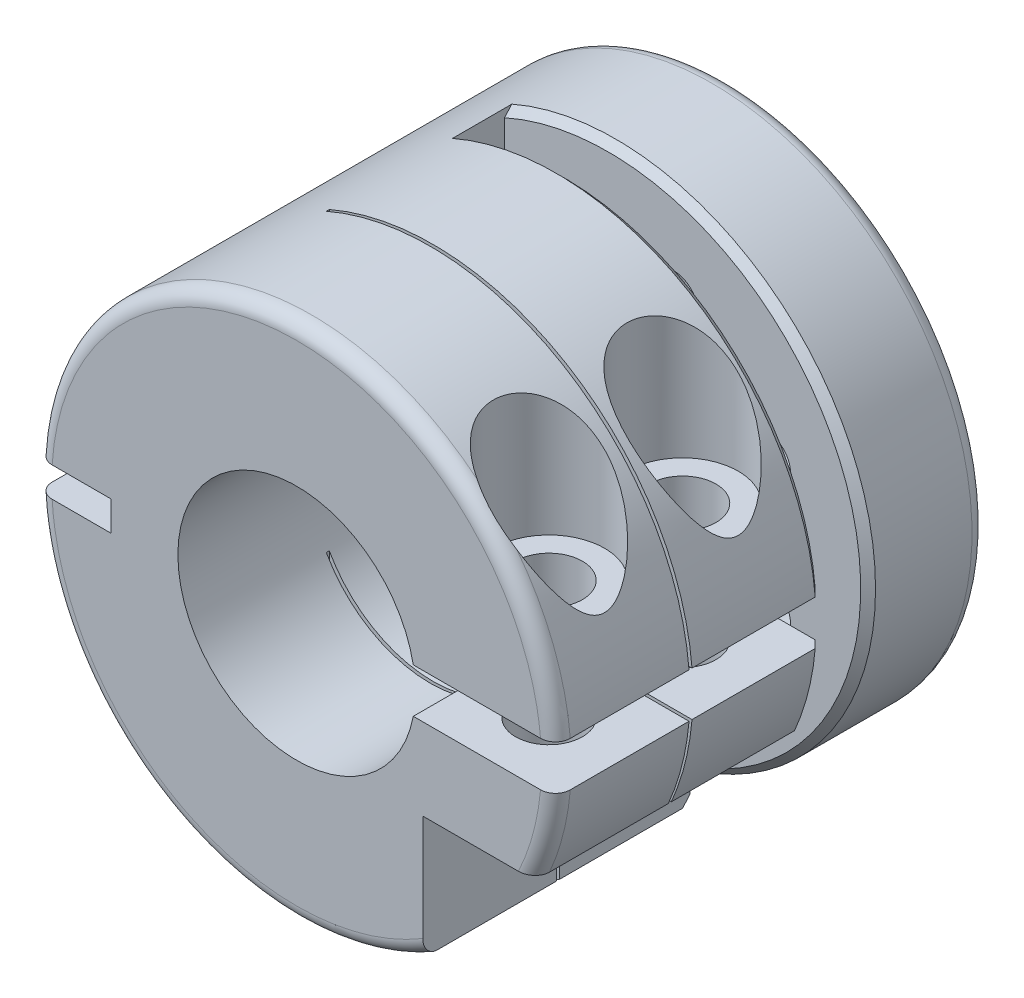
ISO-10303-21;
HEADER;
FILE_DESCRIPTION(('STEP AP214'),'2;1');
FILE_NAME('part.step','',(''),(''),'','','');
FILE_SCHEMA(('AUTOMOTIVE_DESIGN { 1 0 10303 214 1 1 1 1 }'));
ENDSEC;
DATA;
#1=APPLICATION_CONTEXT('core data for automotive mechanical design processes');
#2=APPLICATION_PROTOCOL_DEFINITION('international standard','automotive_design',2000,#1);
#3=PRODUCT_CONTEXT('',#1,'mechanical');
#4=PRODUCT('Part','Part','',(#3));
#5=PRODUCT_RELATED_PRODUCT_CATEGORY('part','',(#4));
#6=PRODUCT_DEFINITION_FORMATION('','',#4);
#7=PRODUCT_DEFINITION_CONTEXT('part definition',#1,'design');
#8=PRODUCT_DEFINITION('design','',#6,#7);
#9=PRODUCT_DEFINITION_SHAPE('','',#8);
#10=(LENGTH_UNIT() NAMED_UNIT(*) SI_UNIT(.MILLI.,.METRE.));
#11=(NAMED_UNIT(*) PLANE_ANGLE_UNIT() SI_UNIT($,.RADIAN.));
#12=(NAMED_UNIT(*) SI_UNIT($,.STERADIAN.) SOLID_ANGLE_UNIT());
#13=UNCERTAINTY_MEASURE_WITH_UNIT(LENGTH_MEASURE(1.E-05),#10,'distance_accuracy_value','');
#14=(GEOMETRIC_REPRESENTATION_CONTEXT(3) GLOBAL_UNCERTAINTY_ASSIGNED_CONTEXT((#13)) GLOBAL_UNIT_ASSIGNED_CONTEXT((#10,
#11,#12)) REPRESENTATION_CONTEXT('',''));
#15=CARTESIAN_POINT('',(0.,0.,0.));
#16=DIRECTION('',(0.,0.,1.));
#17=DIRECTION('',(1.,0.,0.));
#18=AXIS2_PLACEMENT_3D('',#15,#16,#17);
#19=CARTESIAN_POINT('',(-10.6246146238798,-4.40085947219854,10.0999999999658));
#20=DIRECTION('',(0.,0.,-1.));
#21=DIRECTION('',(-1.,0.,0.));
#22=AXIS2_PLACEMENT_3D('',#19,#20,#21);
#23=CONICAL_SURFACE('',#22,1.6500000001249,1.02974425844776);
#24=CARTESIAN_POINT('',(-10.6246146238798,-4.40085947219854,11.0914200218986));
#25=VERTEX_POINT('',#24);
#26=VERTEX_LOOP('',#25);
#27=FACE_BOUND('',#26,.T.);
#28=CARTESIAN_POINT('',(-10.6246146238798,-4.40085947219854,10.1));
#29=DIRECTION('',(0.,0.,-1.));
#30=DIRECTION('',(-1.,0.,0.));
#31=AXIS2_PLACEMENT_3D('',#28,#29,#30);
#32=CIRCLE('',#31,1.65);
#33=CARTESIAN_POINT('',(-12.2746146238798,-4.40085947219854,10.1));
#34=VERTEX_POINT('',#33);
#35=EDGE_CURVE('E319',#34,#34,#32,.T.);
#36=ORIENTED_EDGE('',*,*,#35,.T.);
#37=EDGE_LOOP('',(#36));
#38=FACE_BOUND('',#37,.T.);
#39=ADVANCED_FACE('F17',(#27,#38),#23,.F.);
#40=CARTESIAN_POINT('',(-10.6246146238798,4.40085947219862,10.0999999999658));
#41=DIRECTION('',(0.,0.,-1.));
#42=DIRECTION('',(-1.,0.,0.));
#43=AXIS2_PLACEMENT_3D('',#40,#41,#42);
#44=CONICAL_SURFACE('',#43,1.64999999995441,1.02974425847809);
#45=CARTESIAN_POINT('',(-10.6246146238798,4.40085947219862,11.091420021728));
#46=VERTEX_POINT('',#45);
#47=VERTEX_LOOP('',#46);
#48=FACE_BOUND('',#47,.T.);
#49=CARTESIAN_POINT('',(-10.6246146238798,4.40085947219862,10.1));
#50=DIRECTION('',(0.,0.,-1.));
#51=DIRECTION('',(-1.,0.,0.));
#52=AXIS2_PLACEMENT_3D('',#49,#50,#51);
#53=CIRCLE('',#52,1.65);
#54=CARTESIAN_POINT('',(-12.2746146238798,4.40085947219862,10.1));
#55=VERTEX_POINT('',#54);
#56=EDGE_CURVE('E316',#55,#55,#53,.T.);
#57=ORIENTED_EDGE('',*,*,#56,.T.);
#58=EDGE_LOOP('',(#57));
#59=FACE_BOUND('',#58,.T.);
#60=ADVANCED_FACE('F472',(#48,#59),#44,.F.);
#61=CARTESIAN_POINT('',(-4.40085947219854,10.6246146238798,6.00000000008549));
#62=DIRECTION('',(0.,0.,-1.));
#63=DIRECTION('',(0.,1.,0.));
#64=AXIS2_PLACEMENT_3D('',#61,#62,#63);
#65=CONICAL_SURFACE('',#64,1.99999999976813,1.02974425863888);
#66=CARTESIAN_POINT('',(-4.40085947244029,10.6246146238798,7.20172123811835));
#67=VERTEX_POINT('',#66);
#68=VERTEX_LOOP('',#67);
#69=FACE_BOUND('',#68,.T.);
#70=CARTESIAN_POINT('',(-4.40085947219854,10.6246146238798,6.));
#71=DIRECTION('',(0.,0.,-1.));
#72=DIRECTION('',(-1.,0.,0.));
#73=AXIS2_PLACEMENT_3D('',#70,#71,#72);
#74=CIRCLE('',#73,1.99999999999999);
#75=CARTESIAN_POINT('',(-6.40085947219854,10.6246146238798,6.));
#76=VERTEX_POINT('',#75);
#77=EDGE_CURVE('E313',#76,#76,#74,.T.);
#78=ORIENTED_EDGE('',*,*,#77,.T.);
#79=EDGE_LOOP('',(#78));
#80=FACE_BOUND('',#79,.T.);
#81=ADVANCED_FACE('F468',(#69,#80),#65,.F.);
#82=CARTESIAN_POINT('',(4.40085947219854,-10.6246146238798,6.00000000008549));
#83=DIRECTION('',(0.,0.,-1.));
#84=DIRECTION('',(0.,1.,0.));
#85=AXIS2_PLACEMENT_3D('',#82,#83,#84);
#86=CONICAL_SURFACE('',#85,1.99999999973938,1.02974425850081);
#87=CARTESIAN_POINT('',(4.4008594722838,-10.6246146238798,7.2017212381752));
#88=VERTEX_POINT('',#87);
#89=VERTEX_LOOP('',#88);
#90=FACE_BOUND('',#89,.T.);
#91=CARTESIAN_POINT('',(4.40085947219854,-10.6246146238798,6.));
#92=DIRECTION('',(0.,0.,-1.));
#93=DIRECTION('',(-1.,0.,0.));
#94=AXIS2_PLACEMENT_3D('',#91,#92,#93);
#95=CIRCLE('',#94,1.99999999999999);
#96=CARTESIAN_POINT('',(2.40085947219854,-10.6246146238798,6.));
#97=VERTEX_POINT('',#96);
#98=EDGE_CURVE('E266',#97,#97,#95,.T.);
#99=ORIENTED_EDGE('',*,*,#98,.T.);
#100=EDGE_LOOP('',(#99));
#101=FACE_BOUND('',#100,.T.);
#102=ADVANCED_FACE('F464',(#90,#101),#86,.F.);
#103=CARTESIAN_POINT('',(12.5,-1.5,24.5));
#104=DIRECTION('',(0.,1.,0.));
#105=DIRECTION('',(0.,0.,1.));
#106=AXIS2_PLACEMENT_3D('',#103,#104,#105);
#107=CYLINDRICAL_SURFACE('',#106,2.25);
#108=CARTESIAN_POINT('',(12.5,-1.5,24.5));
#109=DIRECTION('',(0.,1.,0.));
#110=DIRECTION('',(0.,0.,1.));
#111=AXIS2_PLACEMENT_3D('',#108,#109,#110);
#112=CIRCLE('',#111,2.25);
#113=CARTESIAN_POINT('',(12.5,-1.5,26.75));
#114=VERTEX_POINT('',#113);
#115=EDGE_CURVE('E497',#114,#114,#112,.T.);
#116=ORIENTED_EDGE('',*,*,#115,.T.);
#117=EDGE_LOOP('',(#116));
#118=FACE_BOUND('',#117,.T.);
#119=CARTESIAN_POINT('',(12.5,-7.,24.5));
#120=DIRECTION('',(0.,1.,0.));
#121=DIRECTION('',(0.,0.,1.));
#122=AXIS2_PLACEMENT_3D('',#119,#120,#121);
#123=CIRCLE('',#122,2.25);
#124=CARTESIAN_POINT('',(12.5,-7.,26.75));
#125=VERTEX_POINT('',#124);
#126=EDGE_CURVE('E310',#125,#125,#123,.F.);
#127=ORIENTED_EDGE('',*,*,#126,.T.);
#128=EDGE_LOOP('',(#127));
#129=FACE_BOUND('',#128,.T.);
#130=ADVANCED_FACE('F460',(#118,#129),#107,.F.);
#131=CARTESIAN_POINT('',(-10.6246146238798,-4.40085947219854,0.));
#132=DIRECTION('',(0.,0.,-1.));
#133=DIRECTION('',(-1.,0.,0.));
#134=AXIS2_PLACEMENT_3D('',#131,#132,#133);
#135=CYLINDRICAL_SURFACE('',#134,1.65);
#136=ORIENTED_EDGE('',*,*,#35,.F.);
#137=EDGE_LOOP('',(#136));
#138=FACE_BOUND('',#137,.T.);
#139=CARTESIAN_POINT('',(-10.6246146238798,-4.40085947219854,0.));
#140=DIRECTION('',(0.,0.,-1.));
#141=DIRECTION('',(-1.,0.,0.));
#142=AXIS2_PLACEMENT_3D('',#139,#140,#141);
#143=CIRCLE('',#142,1.65);
#144=CARTESIAN_POINT('',(-12.2746146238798,-4.40085947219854,0.));
#145=VERTEX_POINT('',#144);
#146=EDGE_CURVE('E927',#145,#145,#143,.T.);
#147=ORIENTED_EDGE('',*,*,#146,.T.);
#148=EDGE_LOOP('',(#147));
#149=FACE_BOUND('',#148,.T.);
#150=ADVANCED_FACE('F456',(#138,#149),#135,.F.);
#151=CARTESIAN_POINT('',(-10.6246146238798,4.40085947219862,0.));
#152=DIRECTION('',(0.,0.,-1.));
#153=DIRECTION('',(-1.,0.,0.));
#154=AXIS2_PLACEMENT_3D('',#151,#152,#153);
#155=CYLINDRICAL_SURFACE('',#154,1.65);
#156=ORIENTED_EDGE('',*,*,#56,.F.);
#157=EDGE_LOOP('',(#156));
#158=FACE_BOUND('',#157,.T.);
#159=CARTESIAN_POINT('',(-10.6246146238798,4.40085947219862,0.));
#160=DIRECTION('',(0.,0.,-1.));
#161=DIRECTION('',(-1.,0.,0.));
#162=AXIS2_PLACEMENT_3D('',#159,#160,#161);
#163=CIRCLE('',#162,1.65);
#164=CARTESIAN_POINT('',(-12.2746146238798,4.40085947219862,0.));
#165=VERTEX_POINT('',#164);
#166=EDGE_CURVE('E924',#165,#165,#163,.T.);
#167=ORIENTED_EDGE('',*,*,#166,.T.);
#168=EDGE_LOOP('',(#167));
#169=FACE_BOUND('',#168,.T.);
#170=ADVANCED_FACE('F452',(#158,#169),#155,.F.);
#171=CARTESIAN_POINT('',(-4.40085947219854,10.6246146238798,0.));
#172=DIRECTION('',(0.,0.,-1.));
#173=DIRECTION('',(-1.,0.,0.));
#174=AXIS2_PLACEMENT_3D('',#171,#172,#173);
#175=CYLINDRICAL_SURFACE('',#174,1.99999999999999);
#176=ORIENTED_EDGE('',*,*,#77,.F.);
#177=EDGE_LOOP('',(#176));
#178=FACE_BOUND('',#177,.T.);
#179=CARTESIAN_POINT('',(-4.40085947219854,10.6246146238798,0.));
#180=DIRECTION('',(0.,0.,-1.));
#181=DIRECTION('',(-1.,0.,0.));
#182=AXIS2_PLACEMENT_3D('',#179,#180,#181);
#183=CIRCLE('',#182,1.99999999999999);
#184=CARTESIAN_POINT('',(-6.40085947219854,10.6246146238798,0.));
#185=VERTEX_POINT('',#184);
#186=EDGE_CURVE('E912',#185,#185,#183,.T.);
#187=ORIENTED_EDGE('',*,*,#186,.T.);
#188=EDGE_LOOP('',(#187));
#189=FACE_BOUND('',#188,.T.);
#190=ADVANCED_FACE('F448',(#178,#189),#175,.F.);
#191=CARTESIAN_POINT('',(4.40085947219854,-10.6246146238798,0.));
#192=DIRECTION('',(0.,0.,-1.));
#193=DIRECTION('',(-1.,0.,0.));
#194=AXIS2_PLACEMENT_3D('',#191,#192,#193);
#195=CYLINDRICAL_SURFACE('',#194,1.99999999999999);
#196=ORIENTED_EDGE('',*,*,#98,.F.);
#197=EDGE_LOOP('',(#196));
#198=FACE_BOUND('',#197,.T.);
#199=CARTESIAN_POINT('',(4.40085947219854,-10.6246146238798,0.));
#200=DIRECTION('',(0.,0.,-1.));
#201=DIRECTION('',(-1.,0.,0.));
#202=AXIS2_PLACEMENT_3D('',#199,#200,#201);
#203=CIRCLE('',#202,1.99999999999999);
#204=CARTESIAN_POINT('',(2.40085947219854,-10.6246146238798,0.));
#205=VERTEX_POINT('',#204);
#206=EDGE_CURVE('E909',#205,#205,#203,.T.);
#207=ORIENTED_EDGE('',*,*,#206,.T.);
#208=EDGE_LOOP('',(#207));
#209=FACE_BOUND('',#208,.T.);
#210=ADVANCED_FACE('F445',(#198,#209),#195,.F.);
#211=CARTESIAN_POINT('',(0.,0.,28.0000000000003));
#212=DIRECTION('',(0.,0.,1.));
#213=DIRECTION('',(1.,0.,0.));
#214=AXIS2_PLACEMENT_3D('',#211,#212,#213);
#215=TOROIDAL_SURFACE('',#214,16.5000000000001,1.);
#216=CARTESIAN_POINT('',(14.941552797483,-7.,29.));
#217=CARTESIAN_POINT('',(15.0081699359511,-7.,29.0000276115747));
#218=CARTESIAN_POINT('',(15.0748235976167,-7.,28.9945412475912));
#219=CARTESIAN_POINT('',(15.2064868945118,-7.,28.9726047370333));
#220=CARTESIAN_POINT('',(15.271491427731,-7.,28.9561240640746));
#221=CARTESIAN_POINT('',(15.3978609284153,-7.,28.9122242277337));
#222=CARTESIAN_POINT('',(15.4592190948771,-7.,28.8847853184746));
#223=CARTESIAN_POINT('',(15.5759930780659,-7.,28.8193906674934));
#224=CARTESIAN_POINT('',(15.6314163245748,-7.,28.7814482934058));
#225=CARTESIAN_POINT('',(15.7311146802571,-7.,28.6983626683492));
#226=CARTESIAN_POINT('',(15.7758563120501,-7.,28.6537807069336));
#227=CARTESIAN_POINT('',(15.8563095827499,-7.,28.5570509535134));
#228=CARTESIAN_POINT('',(15.8920224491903,-7.,28.5049041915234));
#229=CARTESIAN_POINT('',(15.9498857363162,-7.,28.3997376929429));
#230=CARTESIAN_POINT('',(15.9729783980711,-7.,28.3472348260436));
#231=CARTESIAN_POINT('',(16.009197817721,-7.,28.238945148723));
#232=CARTESIAN_POINT('',(16.0223443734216,-7.,28.1831651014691));
#233=CARTESIAN_POINT('',(16.0331480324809,-7.,28.1057224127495));
#234=CARTESIAN_POINT('',(16.0353480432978,-7.,28.0846214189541));
#235=CARTESIAN_POINT('',(16.0382797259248,-7.,28.0423506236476));
#236=CARTESIAN_POINT('',(16.0390136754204,-7.,28.0211809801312));
#237=CARTESIAN_POINT('',(16.0390149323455,-7.,28.));
#238=B_SPLINE_CURVE_WITH_KNOTS('',3,(#216,#217,#218,#219,#220,#221,#222,#223,#224,#225,#226,
#227,#228,#229,#230,#231,#232,#233,#234,#235,#236,#237),.UNSPECIFIED.,.F.,.F.,(4,2,2,2,2,2,2,2,
2,2,4),(0.,0.199686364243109,0.399929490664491,0.600535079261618,0.800886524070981,
0.989342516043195,1.17777287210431,1.34895449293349,1.51979447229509,1.58340106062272,
1.64690875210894),.UNSPECIFIED.);
#239=CARTESIAN_POINT('',(14.9415527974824,-7.,29.0000000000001));
#240=VERTEX_POINT('',#239);
#241=CARTESIAN_POINT('',(16.0390149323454,-7.,28.));
#242=VERTEX_POINT('',#241);
#243=EDGE_CURVE('E484',#240,#242,#238,.T.);
#244=ORIENTED_EDGE('',*,*,#243,.T.);
#245=CARTESIAN_POINT('',(0.,0.,28.));
#246=DIRECTION('',(0.,0.,-1.));
#247=DIRECTION('',(-1.,0.,0.));
#248=AXIS2_PLACEMENT_3D('',#245,#246,#247);
#249=CIRCLE('',#248,17.5);
#250=CARTESIAN_POINT('',(17.4355957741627,-1.5,28.));
#251=VERTEX_POINT('',#250);
#252=EDGE_CURVE('E307',#251,#242,#249,.T.);
#253=ORIENTED_EDGE('',*,*,#252,.F.);
#254=CARTESIAN_POINT('',(17.4355957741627,-1.5,28.));
#255=CARTESIAN_POINT('',(17.4355956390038,-1.5,28.0280582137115));
#256=CARTESIAN_POINT('',(17.434409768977,-1.5,28.0561029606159));
#257=CARTESIAN_POINT('',(17.4296792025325,-1.5,28.1119912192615));
#258=CARTESIAN_POINT('',(17.4261346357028,-1.5,28.139834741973));
#259=CARTESIAN_POINT('',(17.4119981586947,-1.5,28.2227099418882));
#260=CARTESIAN_POINT('',(17.3979033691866,-1.5,28.2771855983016));
#261=CARTESIAN_POINT('',(17.36077167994,-1.5,28.3829944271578));
#262=CARTESIAN_POINT('',(17.3377307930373,-1.5,28.4343261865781));
#263=CARTESIAN_POINT('',(17.2833733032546,-1.5,28.5324007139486));
#264=CARTESIAN_POINT('',(17.2520579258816,-1.5,28.5791441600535));
#265=CARTESIAN_POINT('',(17.1819941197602,-1.5,28.6667981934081));
#266=CARTESIAN_POINT('',(17.1432341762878,-1.5,28.7076995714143));
#267=CARTESIAN_POINT('',(17.0594103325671,-1.5,28.7824505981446));
#268=CARTESIAN_POINT('',(17.0143451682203,-1.5,28.8162988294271));
#269=CARTESIAN_POINT('',(16.9190249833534,-1.5,28.8761049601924));
#270=CARTESIAN_POINT('',(16.8687513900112,-1.5,28.90203322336));
#271=CARTESIAN_POINT('',(16.7645845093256,-1.5,28.9451038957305));
#272=CARTESIAN_POINT('',(16.7106931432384,-1.5,28.9622509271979));
#273=CARTESIAN_POINT('',(16.6190249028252,-1.5,28.9831585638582));
#274=CARTESIAN_POINT('',(16.5818095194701,-1.5,28.9894704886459));
#275=CARTESIAN_POINT('',(16.5069599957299,-1.5,28.9978907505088));
#276=CARTESIAN_POINT('',(16.4693265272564,-1.5,29.0000050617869));
#277=CARTESIAN_POINT('',(16.431676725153,-1.5,29.));
#278=B_SPLINE_CURVE_WITH_KNOTS('',3,(#254,#255,#256,#257,#258,#259,#260,#261,#262,#263,#264,
#265,#266,#267,#268,#269,#270,#271,#272,#273,#274,#275,#276,#277),.UNSPECIFIED.,.F.,.F.,(4,2,2,
2,2,2,2,2,2,2,2,4),(0.,0.0841228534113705,0.168241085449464,0.33618330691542,0.504200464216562,
0.672192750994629,0.84044699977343,1.00873502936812,1.1776452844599,1.34646653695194,
1.45948576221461,1.57234401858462),.UNSPECIFIED.);
#279=CARTESIAN_POINT('',(16.431676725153,-1.5,29.0000000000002));
#280=VERTEX_POINT('',#279);
#281=EDGE_CURVE('E265',#251,#280,#278,.T.);
#282=ORIENTED_EDGE('',*,*,#281,.T.);
#283=CARTESIAN_POINT('',(0.,0.,29.0000000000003));
#284=DIRECTION('',(0.,0.,1.));
#285=DIRECTION('',(1.,0.,0.));
#286=AXIS2_PLACEMENT_3D('',#283,#284,#285);
#287=CIRCLE('',#286,16.4999999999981);
#288=EDGE_CURVE('E836',#240,#280,#287,.T.);
#289=ORIENTED_EDGE('',*,*,#288,.F.);
#290=EDGE_LOOP('',(#244,#253,#282,#289));
#291=FACE_BOUND('',#290,.T.);
#292=ADVANCED_FACE('F443',(#291),#215,.T.);
#293=CARTESIAN_POINT('',(4.40085947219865,10.6246146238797,10.9999999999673));
#294=DIRECTION('',(0.,0.,-1.));
#295=DIRECTION('',(-1.,0.,0.));
#296=AXIS2_PLACEMENT_3D('',#293,#294,#295);
#297=CONICAL_SURFACE('',#296,0.152148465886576,1.02974425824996);
#298=CARTESIAN_POINT('',(4.40085947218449,10.6246146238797,11.0914200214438));
#299=VERTEX_POINT('',#298);
#300=VERTEX_LOOP('',#299);
#301=FACE_BOUND('',#300,.T.);
#302=CARTESIAN_POINT('',(4.40085947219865,10.6246146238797,10.9999999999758));
#303=DIRECTION('',(0.,0.,-1.));
#304=DIRECTION('',(-1.,0.,0.));
#305=AXIS2_PLACEMENT_3D('',#302,#303,#304);
#306=CIRCLE('',#305,0.152148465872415);
#307=CARTESIAN_POINT('',(4.24871100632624,10.6246146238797,10.9999999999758));
#308=VERTEX_POINT('',#307);
#309=EDGE_CURVE('E826',#308,#308,#306,.F.);
#310=ORIENTED_EDGE('',*,*,#309,.F.);
#311=EDGE_LOOP('',(#310));
#312=FACE_BOUND('',#311,.T.);
#313=ADVANCED_FACE('F439',(#301,#312),#297,.F.);
#314=CARTESIAN_POINT('',(10.6246146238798,4.40085947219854,11.0000000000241));
#315=DIRECTION('',(0.,0.,-1.));
#316=DIRECTION('',(-1.,0.,0.));
#317=AXIS2_PLACEMENT_3D('',#314,#315,#316);
#318=CONICAL_SURFACE('',#317,0.152148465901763,1.02974425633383);
#319=CARTESIAN_POINT('',(10.6246146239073,4.40085947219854,11.0914200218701));
#320=VERTEX_POINT('',#319);
#321=VERTEX_LOOP('',#320);
#322=FACE_BOUND('',#321,.T.);
#323=CARTESIAN_POINT('',(10.6246146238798,4.40085947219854,11.0000000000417));
#324=DIRECTION('',(0.,0.,-1.));
#325=DIRECTION('',(-1.,0.,0.));
#326=AXIS2_PLACEMENT_3D('',#323,#324,#325);
#327=CIRCLE('',#326,0.152148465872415);
#328=CARTESIAN_POINT('',(10.4724661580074,4.40085947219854,11.0000000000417));
#329=VERTEX_POINT('',#328);
#330=EDGE_CURVE('E822',#329,#329,#327,.F.);
#331=ORIENTED_EDGE('',*,*,#330,.F.);
#332=EDGE_LOOP('',(#331));
#333=FACE_BOUND('',#332,.T.);
#334=ADVANCED_FACE('F435',(#322,#333),#318,.F.);
#335=CARTESIAN_POINT('',(-4.40085947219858,-10.6246146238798,0.));
#336=DIRECTION('',(0.,0.,-1.));
#337=DIRECTION('',(-1.,0.,0.));
#338=AXIS2_PLACEMENT_3D('',#335,#336,#337);
#339=CYLINDRICAL_SURFACE('',#338,1.65);
#340=CARTESIAN_POINT('',(-4.40085947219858,-10.6246146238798,0.));
#341=DIRECTION('',(0.,0.,-1.));
#342=DIRECTION('',(-1.,0.,0.));
#343=AXIS2_PLACEMENT_3D('',#340,#341,#342);
#344=CIRCLE('',#343,1.65);
#345=CARTESIAN_POINT('',(-6.05085947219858,-10.6246146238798,0.));
#346=VERTEX_POINT('',#345);
#347=EDGE_CURVE('E930',#346,#346,#344,.T.);
#348=ORIENTED_EDGE('',*,*,#347,.T.);
#349=EDGE_LOOP('',(#348));
#350=FACE_BOUND('',#349,.T.);
#351=CARTESIAN_POINT('',(-4.40085947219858,-10.6246146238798,8.));
#352=DIRECTION('',(0.,0.,-1.));
#353=DIRECTION('',(-1.,0.,0.));
#354=AXIS2_PLACEMENT_3D('',#351,#352,#353);
#355=CIRCLE('',#354,1.65);
#356=CARTESIAN_POINT('',(-6.05085947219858,-10.6246146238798,8.));
#357=VERTEX_POINT('',#356);
#358=EDGE_CURVE('E893',#357,#357,#355,.T.);
#359=ORIENTED_EDGE('',*,*,#358,.F.);
#360=EDGE_LOOP('',(#359));
#361=FACE_BOUND('',#360,.T.);
#362=ADVANCED_FACE('F431',(#350,#361),#339,.F.);
#363=CARTESIAN_POINT('',(4.40085947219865,10.6246146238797,0.));
#364=DIRECTION('',(0.,0.,-1.));
#365=DIRECTION('',(-1.,0.,0.));
#366=AXIS2_PLACEMENT_3D('',#363,#364,#365);
#367=CYLINDRICAL_SURFACE('',#366,1.65);
#368=CARTESIAN_POINT('',(4.40085947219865,10.6246146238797,0.));
#369=DIRECTION('',(0.,0.,-1.));
#370=DIRECTION('',(-1.,0.,0.));
#371=AXIS2_PLACEMENT_3D('',#368,#369,#370);
#372=CIRCLE('',#371,1.65);
#373=CARTESIAN_POINT('',(2.75085947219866,10.6246146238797,0.));
#374=VERTEX_POINT('',#373);
#375=EDGE_CURVE('E921',#374,#374,#372,.T.);
#376=ORIENTED_EDGE('',*,*,#375,.T.);
#377=EDGE_LOOP('',(#376));
#378=FACE_BOUND('',#377,.T.);
#379=CARTESIAN_POINT('',(4.40085947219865,10.6246146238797,8.));
#380=DIRECTION('',(0.,0.,-1.));
#381=DIRECTION('',(-1.,0.,0.));
#382=AXIS2_PLACEMENT_3D('',#379,#380,#381);
#383=CIRCLE('',#382,1.65);
#384=CARTESIAN_POINT('',(2.75085947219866,10.6246146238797,8.));
#385=VERTEX_POINT('',#384);
#386=EDGE_CURVE('E890',#385,#385,#383,.T.);
#387=ORIENTED_EDGE('',*,*,#386,.F.);
#388=EDGE_LOOP('',(#387));
#389=FACE_BOUND('',#388,.T.);
#390=ADVANCED_FACE('F427',(#378,#389),#367,.F.);
#391=CARTESIAN_POINT('',(10.6246146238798,-4.40085947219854,0.));
#392=DIRECTION('',(0.,0.,-1.));
#393=DIRECTION('',(-1.,0.,0.));
#394=AXIS2_PLACEMENT_3D('',#391,#392,#393);
#395=CYLINDRICAL_SURFACE('',#394,1.65);
#396=CARTESIAN_POINT('',(10.6246146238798,-4.40085947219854,0.));
#397=DIRECTION('',(0.,0.,-1.));
#398=DIRECTION('',(-1.,0.,0.));
#399=AXIS2_PLACEMENT_3D('',#396,#397,#398);
#400=CIRCLE('',#399,1.65);
#401=CARTESIAN_POINT('',(8.9746146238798,-4.40085947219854,0.));
#402=VERTEX_POINT('',#401);
#403=EDGE_CURVE('E918',#402,#402,#400,.T.);
#404=ORIENTED_EDGE('',*,*,#403,.T.);
#405=EDGE_LOOP('',(#404));
#406=FACE_BOUND('',#405,.T.);
#407=CARTESIAN_POINT('',(10.6246146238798,-4.40085947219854,8.));
#408=DIRECTION('',(0.,0.,-1.));
#409=DIRECTION('',(-1.,0.,0.));
#410=AXIS2_PLACEMENT_3D('',#407,#408,#409);
#411=CIRCLE('',#410,1.65);
#412=CARTESIAN_POINT('',(8.9746146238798,-4.40085947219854,8.));
#413=VERTEX_POINT('',#412);
#414=EDGE_CURVE('E887',#413,#413,#411,.T.);
#415=ORIENTED_EDGE('',*,*,#414,.F.);
#416=EDGE_LOOP('',(#415));
#417=FACE_BOUND('',#416,.T.);
#418=ADVANCED_FACE('F423',(#406,#417),#395,.F.);
#419=CARTESIAN_POINT('',(10.6246146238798,4.40085947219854,0.));
#420=DIRECTION('',(0.,0.,-1.));
#421=DIRECTION('',(-1.,0.,0.));
#422=AXIS2_PLACEMENT_3D('',#419,#420,#421);
#423=CYLINDRICAL_SURFACE('',#422,1.65);
#424=CARTESIAN_POINT('',(10.6246146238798,4.40085947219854,0.));
#425=DIRECTION('',(0.,0.,-1.));
#426=DIRECTION('',(-1.,0.,0.));
#427=AXIS2_PLACEMENT_3D('',#424,#425,#426);
#428=CIRCLE('',#427,1.65);
#429=CARTESIAN_POINT('',(8.9746146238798,4.40085947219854,0.));
#430=VERTEX_POINT('',#429);
#431=EDGE_CURVE('E915',#430,#430,#428,.T.);
#432=ORIENTED_EDGE('',*,*,#431,.T.);
#433=EDGE_LOOP('',(#432));
#434=FACE_BOUND('',#433,.T.);
#435=CARTESIAN_POINT('',(10.6246146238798,4.40085947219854,8.));
#436=DIRECTION('',(0.,0.,-1.));
#437=DIRECTION('',(-1.,0.,0.));
#438=AXIS2_PLACEMENT_3D('',#435,#436,#437);
#439=CIRCLE('',#438,1.65);
#440=CARTESIAN_POINT('',(8.9746146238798,4.40085947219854,8.));
#441=VERTEX_POINT('',#440);
#442=EDGE_CURVE('E276',#441,#441,#439,.T.);
#443=ORIENTED_EDGE('',*,*,#442,.F.);
#444=EDGE_LOOP('',(#443));
#445=FACE_BOUND('',#444,.T.);
#446=ADVANCED_FACE('F419',(#434,#445),#423,.F.);
#447=CARTESIAN_POINT('',(10.6246146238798,-4.40085947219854,11.0000000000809));
#448=DIRECTION('',(0.,0.,-1.));
#449=DIRECTION('',(-1.,0.,0.));
#450=AXIS2_PLACEMENT_3D('',#447,#448,#449);
#451=CONICAL_SURFACE('',#450,0.152148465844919,1.02974425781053);
#452=CARTESIAN_POINT('',(10.6246146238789,-4.40085947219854,11.0914200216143));
#453=VERTEX_POINT('',#452);
#454=VERTEX_LOOP('',#453);
#455=FACE_BOUND('',#454,.T.);
#456=CARTESIAN_POINT('',(10.6246146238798,-4.40085947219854,11.0000000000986));
#457=DIRECTION('',(0.,0.,-1.));
#458=DIRECTION('',(-1.,0.,0.));
#459=AXIS2_PLACEMENT_3D('',#456,#457,#458);
#460=CIRCLE('',#459,0.152148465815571);
#461=CARTESIAN_POINT('',(10.4724661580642,-4.40085947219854,11.0000000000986));
#462=VERTEX_POINT('',#461);
#463=EDGE_CURVE('E275',#462,#462,#460,.F.);
#464=ORIENTED_EDGE('',*,*,#463,.F.);
#465=EDGE_LOOP('',(#464));
#466=FACE_BOUND('',#465,.T.);
#467=ADVANCED_FACE('F415',(#455,#466),#451,.F.);
#468=CARTESIAN_POINT('',(-4.40085947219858,-10.6246146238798,10.9999999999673));
#469=DIRECTION('',(0.,0.,-1.));
#470=DIRECTION('',(-1.,0.,0.));
#471=AXIS2_PLACEMENT_3D('',#468,#469,#470);
#472=CONICAL_SURFACE('',#471,0.152148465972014,1.02974425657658);
#473=CARTESIAN_POINT('',(-4.40085947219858,-10.6246146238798,11.0914200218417));
#474=VERTEX_POINT('',#473);
#475=VERTEX_LOOP('',#474);
#476=FACE_BOUND('',#475,.T.);
#477=CARTESIAN_POINT('',(-4.40085947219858,-10.6246146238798,10.9999999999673));
#478=DIRECTION('',(0.,0.,-1.));
#479=DIRECTION('',(-1.,0.,0.));
#480=AXIS2_PLACEMENT_3D('',#477,#478,#479);
#481=CIRCLE('',#480,0.152148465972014);
#482=CARTESIAN_POINT('',(-4.55300793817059,-10.6246146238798,10.9999999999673));
#483=VERTEX_POINT('',#482);
#484=EDGE_CURVE('E878',#483,#483,#481,.F.);
#485=ORIENTED_EDGE('',*,*,#484,.F.);
#486=EDGE_LOOP('',(#485));
#487=FACE_BOUND('',#486,.T.);
#488=ADVANCED_FACE('F411',(#476,#487),#472,.F.);
#489=CARTESIAN_POINT('',(0.,0.,1.));
#490=DIRECTION('',(0.,0.,1.));
#491=DIRECTION('',(1.,0.,0.));
#492=AXIS2_PLACEMENT_3D('',#489,#490,#491);
#493=TOROIDAL_SURFACE('',#492,9.00000000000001,1.);
#494=CARTESIAN_POINT('',(0.,0.,1.));
#495=DIRECTION('',(0.,0.,1.));
#496=DIRECTION('',(1.,0.,0.));
#497=AXIS2_PLACEMENT_3D('',#494,#495,#496);
#498=CIRCLE('',#497,8.);
#499=CARTESIAN_POINT('',(8.,0.,1.));
#500=VERTEX_POINT('',#499);
#501=EDGE_CURVE('E297',#500,#500,#498,.T.);
#502=ORIENTED_EDGE('',*,*,#501,.T.);
#503=EDGE_LOOP('',(#502));
#504=FACE_BOUND('',#503,.T.);
#505=CARTESIAN_POINT('',(0.,0.,0.));
#506=DIRECTION('',(0.,0.,1.));
#507=DIRECTION('',(1.,0.,0.));
#508=AXIS2_PLACEMENT_3D('',#505,#506,#507);
#509=CIRCLE('',#508,9.00000000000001);
#510=CARTESIAN_POINT('',(9.00000000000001,0.,0.));
#511=VERTEX_POINT('',#510);
#512=EDGE_CURVE('E906',#511,#511,#509,.F.);
#513=ORIENTED_EDGE('',*,*,#512,.T.);
#514=EDGE_LOOP('',(#513));
#515=FACE_BOUND('',#514,.T.);
#516=ADVANCED_FACE('F344',(#504,#515),#493,.T.);
#517=CARTESIAN_POINT('',(0.,0.,11.5));
#518=DIRECTION('',(0.,0.,1.));
#519=DIRECTION('',(1.,0.,0.));
#520=AXIS2_PLACEMENT_3D('',#517,#518,#519);
#521=CONICAL_SURFACE('',#520,17.5,0.785398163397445);
#522=CARTESIAN_POINT('',(16.0390149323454,-7.,11.5));
#523=CARTESIAN_POINT('',(15.9479532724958,-7.,11.4165369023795));
#524=CARTESIAN_POINT('',(15.8568323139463,-7.,11.3331386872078));
#525=CARTESIAN_POINT('',(15.6744717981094,-7.,11.1664720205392));
#526=CARTESIAN_POINT('',(15.5832322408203,-7.,11.0832035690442));
#527=CARTESIAN_POINT('',(15.4919333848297,-7.,11.));
#528=B_SPLINE_CURVE_WITH_KNOTS('',3,(#522,#523,#524,#525,#526,#527),.UNSPECIFIED.,.F.,.F.,(4,2,
4),(0.,0.370573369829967,0.741146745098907),.UNSPECIFIED.);
#529=CARTESIAN_POINT('',(16.0390149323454,-6.99999999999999,11.5));
#530=VERTEX_POINT('',#529);
#531=CARTESIAN_POINT('',(15.4919333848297,-7.,11.));
#532=VERTEX_POINT('',#531);
#533=EDGE_CURVE('E271',#530,#532,#528,.T.);
#534=ORIENTED_EDGE('',*,*,#533,.T.);
#535=CARTESIAN_POINT('',(0.,0.,11.));
#536=DIRECTION('',(0.,0.,1.));
#537=DIRECTION('',(1.,0.,0.));
#538=AXIS2_PLACEMENT_3D('',#535,#536,#537);
#539=CIRCLE('',#538,17.);
#540=CARTESIAN_POINT('',(16.9336942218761,-1.5,11.));
#541=VERTEX_POINT('',#540);
#542=EDGE_CURVE('E268',#541,#532,#539,.F.);
#543=ORIENTED_EDGE('',*,*,#542,.F.);
#544=CARTESIAN_POINT('',(16.9336942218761,-1.5,11.));
#545=CARTESIAN_POINT('',(17.0173490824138,-1.5,11.0833287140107));
#546=CARTESIAN_POINT('',(17.1010016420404,-1.5,11.1666597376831));
#547=CARTESIAN_POINT('',(17.2683021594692,-1.5,11.3333264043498));
#548=CARTESIAN_POINT('',(17.3519501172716,-1.5,11.416662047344));
#549=CARTESIAN_POINT('',(17.4355957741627,-1.5,11.5));
#550=B_SPLINE_CURVE_WITH_KNOTS('',3,(#544,#545,#546,#547,#548,#549),.UNSPECIFIED.,.F.,.F.,(4,2,
4),(0.,0.354226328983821,0.708452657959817),.UNSPECIFIED.);
#551=CARTESIAN_POINT('',(17.4355957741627,-1.5,11.5));
#552=VERTEX_POINT('',#551);
#553=EDGE_CURVE('E22',#541,#552,#550,.T.);
#554=ORIENTED_EDGE('',*,*,#553,.T.);
#555=CARTESIAN_POINT('',(0.,0.,11.5));
#556=DIRECTION('',(0.,0.,-1.));
#557=DIRECTION('',(-1.,0.,0.));
#558=AXIS2_PLACEMENT_3D('',#555,#556,#557);
#559=CIRCLE('',#558,17.5);
#560=EDGE_CURVE('E293',#530,#552,#559,.F.);
#561=ORIENTED_EDGE('',*,*,#560,.F.);
#562=EDGE_LOOP('',(#534,#543,#554,#561));
#563=FACE_BOUND('',#562,.T.);
#564=ADVANCED_FACE('F269',(#563),#521,.T.);
#565=CARTESIAN_POINT('',(12.5,-1.5,15.5));
#566=DIRECTION('',(0.,1.,0.));
#567=DIRECTION('',(0.,0.,1.));
#568=AXIS2_PLACEMENT_3D('',#565,#566,#567);
#569=CYLINDRICAL_SURFACE('',#568,2.25);
#570=CARTESIAN_POINT('',(12.5,-7.,15.5));
#571=DIRECTION('',(0.,1.,0.));
#572=DIRECTION('',(0.,0.,1.));
#573=AXIS2_PLACEMENT_3D('',#570,#571,#572);
#574=CIRCLE('',#573,2.25);
#575=CARTESIAN_POINT('',(12.5,-7.,17.75));
#576=VERTEX_POINT('',#575);
#577=EDGE_CURVE('E402',#576,#576,#574,.F.);
#578=ORIENTED_EDGE('',*,*,#577,.T.);
#579=EDGE_LOOP('',(#578));
#580=FACE_BOUND('',#579,.T.);
#581=CARTESIAN_POINT('',(12.5,-1.5,15.5));
#582=DIRECTION('',(0.,1.,0.));
#583=DIRECTION('',(0.,0.,1.));
#584=AXIS2_PLACEMENT_3D('',#581,#582,#583);
#585=CIRCLE('',#584,2.25);
#586=CARTESIAN_POINT('',(12.5,-1.5,17.75));
#587=VERTEX_POINT('',#586);
#588=EDGE_CURVE('E282',#587,#587,#585,.T.);
#589=ORIENTED_EDGE('',*,*,#588,.T.);
#590=EDGE_LOOP('',(#589));
#591=FACE_BOUND('',#590,.T.);
#592=ADVANCED_FACE('F409',(#580,#591),#569,.F.);
#593=CARTESIAN_POINT('',(0.,-1.5,-8.93800586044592));
#594=DIRECTION('',(0.,-1.,0.));
#595=DIRECTION('',(0.,0.,-1.));
#596=AXIS2_PLACEMENT_3D('',#593,#594,#595);
#597=PLANE('',#596);
#598=ORIENTED_EDGE('',*,*,#115,.F.);
#599=EDGE_LOOP('',(#598));
#600=FACE_BOUND('',#599,.T.);
#601=ORIENTED_EDGE('',*,*,#281,.F.);
#602=DIRECTION('',(0.,0.,-1.));
#603=VECTOR('',#602,1.);
#604=CARTESIAN_POINT('',(17.4355957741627,-1.5,29.));
#605=LINE('',#604,#603);
#606=CARTESIAN_POINT('',(17.4355957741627,-1.5,20.));
#607=VERTEX_POINT('',#606);
#608=EDGE_CURVE('E291',#607,#251,#605,.F.);
#609=ORIENTED_EDGE('',*,*,#608,.F.);
#610=DIRECTION('',(-1.,0.,0.));
#611=VECTOR('',#610,1.);
#612=CARTESIAN_POINT('',(17.5,-1.5,20.));
#613=LINE('',#612,#611);
#614=CARTESIAN_POINT('',(7.85811682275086,-1.5,20.));
#615=VERTEX_POINT('',#614);
#616=EDGE_CURVE('E763',#615,#607,#613,.F.);
#617=ORIENTED_EDGE('',*,*,#616,.F.);
#618=DIRECTION('',(0.,0.,1.));
#619=VECTOR('',#618,1.);
#620=CARTESIAN_POINT('',(7.85811682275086,-1.5,5.));
#621=LINE('',#620,#619);
#622=CARTESIAN_POINT('',(7.85811682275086,-1.5,29.));
#623=VERTEX_POINT('',#622);
#624=EDGE_CURVE('E872',#615,#623,#621,.T.);
#625=ORIENTED_EDGE('',*,*,#624,.T.);
#626=DIRECTION('',(1.,0.,0.));
#627=VECTOR('',#626,1.);
#628=CARTESIAN_POINT('',(0.,-1.5,29.));
#629=LINE('',#628,#627);
#630=EDGE_CURVE('E833',#280,#623,#629,.F.);
#631=ORIENTED_EDGE('',*,*,#630,.F.);
#632=EDGE_LOOP('',(#601,#609,#617,#625,#631));
#633=FACE_BOUND('',#632,.T.);
#634=ADVANCED_FACE('F498',(#600,#633),#597,.F.);
#635=CARTESIAN_POINT('',(0.,0.,29.));
#636=DIRECTION('',(0.,0.,-1.));
#637=DIRECTION('',(-1.,0.,0.));
#638=AXIS2_PLACEMENT_3D('',#635,#636,#637);
#639=CYLINDRICAL_SURFACE('',#638,17.5);
#640=ORIENTED_EDGE('',*,*,#252,.T.);
#641=DIRECTION('',(0.,0.,1.));
#642=VECTOR('',#641,1.);
#643=CARTESIAN_POINT('',(16.0390149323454,-7.,-1.97737562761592));
#644=LINE('',#643,#642);
#645=CARTESIAN_POINT('',(16.0390149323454,-7.,20.));
#646=VERTEX_POINT('',#645);
#647=EDGE_CURVE('E870',#242,#646,#644,.F.);
#648=ORIENTED_EDGE('',*,*,#647,.T.);
#649=CARTESIAN_POINT('',(0.,0.,20.));
#650=DIRECTION('',(0.,0.,-1.));
#651=DIRECTION('',(-1.,0.,0.));
#652=AXIS2_PLACEMENT_3D('',#649,#650,#651);
#653=CIRCLE('',#652,17.5);
#654=EDGE_CURVE('E760',#607,#646,#653,.T.);
#655=ORIENTED_EDGE('',*,*,#654,.F.);
#656=ORIENTED_EDGE('',*,*,#608,.T.);
#657=EDGE_LOOP('',(#640,#648,#655,#656));
#658=FACE_BOUND('',#657,.T.);
#659=ADVANCED_FACE('F502',(#658),#639,.T.);
#660=CARTESIAN_POINT('',(0.,-7.,-1.97737562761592));
#661=DIRECTION('',(0.,1.,0.));
#662=DIRECTION('',(0.,0.,1.));
#663=AXIS2_PLACEMENT_3D('',#660,#661,#662);
#664=PLANE('',#663);
#665=ORIENTED_EDGE('',*,*,#243,.F.);
#666=DIRECTION('',(1.,0.,0.));
#667=VECTOR('',#666,1.);
#668=CARTESIAN_POINT('',(0.,-7.,29.));
#669=LINE('',#668,#667);
#670=CARTESIAN_POINT('',(8.5,-7.,29.));
#671=VERTEX_POINT('',#670);
#672=EDGE_CURVE('E837',#671,#240,#669,.T.);
#673=ORIENTED_EDGE('',*,*,#672,.F.);
#674=DIRECTION('',(0.,0.,-1.));
#675=VECTOR('',#674,1.);
#676=CARTESIAN_POINT('',(8.5,-7.,-1.97737562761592));
#677=LINE('',#676,#675);
#678=CARTESIAN_POINT('',(8.5,-7.,20.));
#679=VERTEX_POINT('',#678);
#680=EDGE_CURVE('E746',#679,#671,#677,.F.);
#681=ORIENTED_EDGE('',*,*,#680,.F.);
#682=DIRECTION('',(-1.,0.,0.));
#683=VECTOR('',#682,1.);
#684=CARTESIAN_POINT('',(17.5,-7.,20.));
#685=LINE('',#684,#683);
#686=EDGE_CURVE('E757',#646,#679,#685,.T.);
#687=ORIENTED_EDGE('',*,*,#686,.F.);
#688=ORIENTED_EDGE('',*,*,#647,.F.);
#689=EDGE_LOOP('',(#665,#673,#681,#687,#688));
#690=FACE_BOUND('',#689,.T.);
#691=ORIENTED_EDGE('',*,*,#126,.F.);
#692=EDGE_LOOP('',(#691));
#693=FACE_BOUND('',#692,.T.);
#694=ADVANCED_FACE('F505',(#690,#693),#664,.F.);
#695=CARTESIAN_POINT('',(-14.,-2.,17.));
#696=DIRECTION('',(0.,0.,1.));
#697=DIRECTION('',(1.,0.,0.));
#698=AXIS2_PLACEMENT_3D('',#695,#696,#697);
#699=CYLINDRICAL_SURFACE('',#698,1.5);
#700=CARTESIAN_POINT('',(-14.,-2.,0.));
#701=DIRECTION('',(0.,0.,1.));
#702=DIRECTION('',(1.,0.,0.));
#703=AXIS2_PLACEMENT_3D('',#700,#701,#702);
#704=CIRCLE('',#703,1.5);
#705=CARTESIAN_POINT('',(-12.5,-2.,0.));
#706=VERTEX_POINT('',#705);
#707=CARTESIAN_POINT('',(-14.,-3.5,0.));
#708=VERTEX_POINT('',#707);
#709=EDGE_CURVE('E871',#706,#708,#704,.F.);
#710=ORIENTED_EDGE('',*,*,#709,.T.);
#711=DIRECTION('',(0.,0.,1.));
#712=VECTOR('',#711,1.);
#713=CARTESIAN_POINT('',(-14.,-3.5,17.));
#714=LINE('',#713,#712);
#715=CARTESIAN_POINT('',(-14.,-3.5,17.));
#716=VERTEX_POINT('',#715);
#717=EDGE_CURVE('E715',#716,#708,#714,.F.);
#718=ORIENTED_EDGE('',*,*,#717,.F.);
#719=CARTESIAN_POINT('',(-14.,-2.,17.));
#720=DIRECTION('',(0.,0.,1.));
#721=DIRECTION('',(1.,0.,0.));
#722=AXIS2_PLACEMENT_3D('',#719,#720,#721);
#723=CIRCLE('',#722,1.5);
#724=CARTESIAN_POINT('',(-12.5,-2.,17.));
#725=VERTEX_POINT('',#724);
#726=EDGE_CURVE('E719',#725,#716,#723,.F.);
#727=ORIENTED_EDGE('',*,*,#726,.F.);
#728=DIRECTION('',(0.,0.,1.));
#729=VECTOR('',#728,1.);
#730=CARTESIAN_POINT('',(-12.5,-2.,17.));
#731=LINE('',#730,#729);
#732=EDGE_CURVE('E305',#706,#725,#731,.T.);
#733=ORIENTED_EDGE('',*,*,#732,.F.);
#734=EDGE_LOOP('',(#710,#718,#727,#733));
#735=FACE_BOUND('',#734,.T.);
#736=ADVANCED_FACE('F510',(#735),#699,.F.);
#737=CARTESIAN_POINT('',(0.,0.,0.));
#738=DIRECTION('',(0.,0.,1.));
#739=DIRECTION('',(1.,0.,0.));
#740=AXIS2_PLACEMENT_3D('',#737,#738,#739);
#741=PLANE('',#740);
#742=ORIENTED_EDGE('',*,*,#512,.F.);
#743=EDGE_LOOP('',(#742));
#744=FACE_BOUND('',#743,.T.);
#745=ORIENTED_EDGE('',*,*,#206,.F.);
#746=EDGE_LOOP('',(#745));
#747=FACE_BOUND('',#746,.T.);
#748=ORIENTED_EDGE('',*,*,#186,.F.);
#749=EDGE_LOOP('',(#748));
#750=FACE_BOUND('',#749,.T.);
#751=ORIENTED_EDGE('',*,*,#431,.F.);
#752=EDGE_LOOP('',(#751));
#753=FACE_BOUND('',#752,.T.);
#754=ORIENTED_EDGE('',*,*,#403,.F.);
#755=EDGE_LOOP('',(#754));
#756=FACE_BOUND('',#755,.T.);
#757=ORIENTED_EDGE('',*,*,#375,.F.);
#758=EDGE_LOOP('',(#757));
#759=FACE_BOUND('',#758,.T.);
#760=ORIENTED_EDGE('',*,*,#166,.F.);
#761=EDGE_LOOP('',(#760));
#762=FACE_BOUND('',#761,.T.);
#763=ORIENTED_EDGE('',*,*,#146,.F.);
#764=EDGE_LOOP('',(#763));
#765=FACE_BOUND('',#764,.T.);
#766=ORIENTED_EDGE('',*,*,#347,.F.);
#767=EDGE_LOOP('',(#766));
#768=FACE_BOUND('',#767,.T.);
#769=DIRECTION('',(0.,1.,0.));
#770=VECTOR('',#769,1.);
#771=CARTESIAN_POINT('',(-12.5,3.5,0.));
#772=LINE('',#771,#770);
#773=CARTESIAN_POINT('',(-12.5,2.,0.));
#774=VERTEX_POINT('',#773);
#775=EDGE_CURVE('E302',#774,#706,#772,.F.);
#776=ORIENTED_EDGE('',*,*,#775,.F.);
#777=CARTESIAN_POINT('',(-14.,2.,0.));
#778=DIRECTION('',(0.,0.,1.));
#779=DIRECTION('',(1.,0.,0.));
#780=AXIS2_PLACEMENT_3D('',#777,#778,#779);
#781=CIRCLE('',#780,1.5);
#782=CARTESIAN_POINT('',(-14.,3.5,0.));
#783=VERTEX_POINT('',#782);
#784=EDGE_CURVE('E306',#774,#783,#781,.T.);
#785=ORIENTED_EDGE('',*,*,#784,.T.);
#786=DIRECTION('',(1.,0.,0.));
#787=VECTOR('',#786,1.);
#788=CARTESIAN_POINT('',(-12.5,3.5,0.));
#789=LINE('',#788,#787);
#790=CARTESIAN_POINT('',(-16.1245154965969,3.5,0.));
#791=VERTEX_POINT('',#790);
#792=EDGE_CURVE('E658',#791,#783,#789,.T.);
#793=ORIENTED_EDGE('',*,*,#792,.F.);
#794=CARTESIAN_POINT('',(2.1163626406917E-13,0.,0.));
#795=DIRECTION('',(0.,0.,1.));
#796=DIRECTION('',(1.,0.,0.));
#797=AXIS2_PLACEMENT_3D('',#794,#795,#796);
#798=CIRCLE('',#797,16.4999999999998);
#799=CARTESIAN_POINT('',(-16.1245154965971,-3.5,0.));
#800=VERTEX_POINT('',#799);
#801=EDGE_CURVE('E659',#800,#791,#798,.T.);
#802=ORIENTED_EDGE('',*,*,#801,.F.);
#803=DIRECTION('',(-1.,0.,0.));
#804=VECTOR('',#803,1.);
#805=CARTESIAN_POINT('',(-12.5,-3.5,0.));
#806=LINE('',#805,#804);
#807=EDGE_CURVE('E713',#708,#800,#806,.T.);
#808=ORIENTED_EDGE('',*,*,#807,.F.);
#809=ORIENTED_EDGE('',*,*,#709,.F.);
#810=EDGE_LOOP('',(#776,#785,#793,#802,#808,#809));
#811=FACE_BOUND('',#810,.T.);
#812=ADVANCED_FACE('F514',(#744,#747,#750,#753,#756,#759,#762,#765,#768,#811),#741,.F.);
#813=CARTESIAN_POINT('',(-14.,2.,17.));
#814=DIRECTION('',(0.,0.,1.));
#815=DIRECTION('',(1.,0.,0.));
#816=AXIS2_PLACEMENT_3D('',#813,#814,#815);
#817=CYLINDRICAL_SURFACE('',#816,1.5);
#818=ORIENTED_EDGE('',*,*,#784,.F.);
#819=DIRECTION('',(0.,0.,1.));
#820=VECTOR('',#819,1.);
#821=CARTESIAN_POINT('',(-12.5,2.,17.));
#822=LINE('',#821,#820);
#823=CARTESIAN_POINT('',(-12.5,2.,17.));
#824=VERTEX_POINT('',#823);
#825=EDGE_CURVE('E845',#824,#774,#822,.F.);
#826=ORIENTED_EDGE('',*,*,#825,.F.);
#827=CARTESIAN_POINT('',(-14.,2.,17.));
#828=DIRECTION('',(0.,0.,1.));
#829=DIRECTION('',(1.,0.,0.));
#830=AXIS2_PLACEMENT_3D('',#827,#828,#829);
#831=CIRCLE('',#830,1.5);
#832=CARTESIAN_POINT('',(-14.,3.5,17.));
#833=VERTEX_POINT('',#832);
#834=EDGE_CURVE('E645',#833,#824,#831,.F.);
#835=ORIENTED_EDGE('',*,*,#834,.F.);
#836=DIRECTION('',(0.,0.,1.));
#837=VECTOR('',#836,1.);
#838=CARTESIAN_POINT('',(-14.,3.5,17.));
#839=LINE('',#838,#837);
#840=EDGE_CURVE('E649',#783,#833,#839,.T.);
#841=ORIENTED_EDGE('',*,*,#840,.F.);
#842=EDGE_LOOP('',(#818,#826,#835,#841));
#843=FACE_BOUND('',#842,.T.);
#844=ADVANCED_FACE('F518',(#843),#817,.F.);
#845=CARTESIAN_POINT('',(-12.5,3.5,17.));
#846=DIRECTION('',(-1.,0.,0.));
#847=DIRECTION('',(0.,0.,1.));
#848=AXIS2_PLACEMENT_3D('',#845,#846,#847);
#849=PLANE('',#848);
#850=DIRECTION('',(0.,1.,0.));
#851=VECTOR('',#850,1.);
#852=CARTESIAN_POINT('',(-12.5,0.,17.));
#853=LINE('',#852,#851);
#854=CARTESIAN_POINT('',(-12.5,1.,17.));
#855=VERTEX_POINT('',#854);
#856=EDGE_CURVE('E648',#824,#855,#853,.F.);
#857=ORIENTED_EDGE('',*,*,#856,.F.);
#858=ORIENTED_EDGE('',*,*,#825,.T.);
#859=ORIENTED_EDGE('',*,*,#775,.T.);
#860=ORIENTED_EDGE('',*,*,#732,.T.);
#861=DIRECTION('',(0.,1.,0.));
#862=VECTOR('',#861,1.);
#863=CARTESIAN_POINT('',(-12.5,0.,17.));
#864=LINE('',#863,#862);
#865=CARTESIAN_POINT('',(-12.5,-1.,17.));
#866=VERTEX_POINT('',#865);
#867=EDGE_CURVE('E720',#866,#725,#864,.F.);
#868=ORIENTED_EDGE('',*,*,#867,.F.);
#869=DIRECTION('',(0.,0.,-1.));
#870=VECTOR('',#869,1.);
#871=CARTESIAN_POINT('',(-12.5,-1.,38.5));
#872=LINE('',#871,#870);
#873=CARTESIAN_POINT('',(-12.5,-1.,29.));
#874=VERTEX_POINT('',#873);
#875=EDGE_CURVE('E728',#866,#874,#872,.F.);
#876=ORIENTED_EDGE('',*,*,#875,.T.);
#877=DIRECTION('',(0.,1.,0.));
#878=VECTOR('',#877,1.);
#879=CARTESIAN_POINT('',(-12.5,0.,29.));
#880=LINE('',#879,#878);
#881=CARTESIAN_POINT('',(-12.5,1.,29.));
#882=VERTEX_POINT('',#881);
#883=EDGE_CURVE('E840',#882,#874,#880,.F.);
#884=ORIENTED_EDGE('',*,*,#883,.F.);
#885=DIRECTION('',(0.,0.,1.));
#886=VECTOR('',#885,1.);
#887=CARTESIAN_POINT('',(-12.5,1.,38.5));
#888=LINE('',#887,#886);
#889=EDGE_CURVE('E846',#882,#855,#888,.F.);
#890=ORIENTED_EDGE('',*,*,#889,.T.);
#891=EDGE_LOOP('',(#857,#858,#859,#860,#868,#876,#884,#890));
#892=FACE_BOUND('',#891,.T.);
#893=ADVANCED_FACE('F522',(#892),#849,.T.);
#894=CARTESIAN_POINT('',(16.25,6.5,24.5));
#895=DIRECTION('',(0.,-1.,0.));
#896=DIRECTION('',(0.,0.,-1.));
#897=AXIS2_PLACEMENT_3D('',#894,#895,#896);
#898=PLANE('',#897);
#899=CARTESIAN_POINT('',(12.5,6.5,24.5));
#900=DIRECTION('',(0.,-1.,0.));
#901=DIRECTION('',(0.,0.,-1.));
#902=AXIS2_PLACEMENT_3D('',#899,#900,#901);
#903=CIRCLE('',#902,2.25);
#904=CARTESIAN_POINT('',(12.5,6.5,22.25));
#905=VERTEX_POINT('',#904);
#906=EDGE_CURVE('E827',#905,#905,#903,.T.);
#907=ORIENTED_EDGE('',*,*,#906,.T.);
#908=EDGE_LOOP('',(#907));
#909=FACE_BOUND('',#908,.T.);
#910=DIRECTION('',(0.,0.,-1.));
#911=VECTOR('',#910,1.);
#912=CARTESIAN_POINT('',(16.2480768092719,6.5,24.5));
#913=LINE('',#912,#911);
#914=CARTESIAN_POINT('',(16.2480768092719,6.5,24.3799157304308));
#915=VERTEX_POINT('',#914);
#916=CARTESIAN_POINT('',(16.2480768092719,6.5,24.6200842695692));
#917=VERTEX_POINT('',#916);
#918=EDGE_CURVE('E843',#915,#917,#913,.F.);
#919=ORIENTED_EDGE('',*,*,#918,.F.);
#920=CARTESIAN_POINT('',(12.5,6.5,24.5));
#921=DIRECTION('',(0.,-1.,0.));
#922=DIRECTION('',(0.,0.,-1.));
#923=AXIS2_PLACEMENT_3D('',#920,#921,#922);
#924=CIRCLE('',#923,3.75);
#925=EDGE_CURVE('E636',#915,#917,#924,.F.);
#926=ORIENTED_EDGE('',*,*,#925,.T.);
#927=EDGE_LOOP('',(#919,#926));
#928=FACE_BOUND('',#927,.T.);
#929=ADVANCED_FACE('F526',(#909,#928),#898,.F.);
#930=CARTESIAN_POINT('',(0.,0.,29.));
#931=DIRECTION('',(0.,0.,1.));
#932=DIRECTION('',(1.,0.,0.));
#933=AXIS2_PLACEMENT_3D('',#930,#931,#932);
#934=PLANE('',#933);
#935=CARTESIAN_POINT('',(-16.4696690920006,1.00000000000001,29.));
#936=CARTESIAN_POINT('',(-16.4622051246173,1.12293316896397,29.));
#937=CARTESIAN_POINT('',(-16.453364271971,1.24578272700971,29.));
#938=CARTESIAN_POINT('',(-16.4329343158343,1.49125311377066,29.));
#939=CARTESIAN_POINT('',(-16.421345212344,1.61387394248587,29.));
#940=CARTESIAN_POINT('',(-16.3954242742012,1.85882536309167,29.));
#941=CARTESIAN_POINT('',(-16.3810924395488,1.98115595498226,29.));
#942=CARTESIAN_POINT('',(-16.3496933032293,2.22546557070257,29.));
#943=CARTESIAN_POINT('',(-16.3326260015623,2.34744459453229,29.));
#944=CARTESIAN_POINT('',(-16.2957644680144,2.59098991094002,29.));
#945=CARTESIAN_POINT('',(-16.2759702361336,2.71255620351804,29.));
#946=CARTESIAN_POINT('',(-16.2336647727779,2.95521510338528,29.));
#947=CARTESIAN_POINT('',(-16.211153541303,3.07630771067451,29.));
#948=CARTESIAN_POINT('',(-16.1634253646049,3.31795852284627,29.));
#949=CARTESIAN_POINT('',(-16.1382084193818,3.43851672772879,29.));
#950=CARTESIAN_POINT('',(-16.0850814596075,3.67903828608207,29.));
#951=CARTESIAN_POINT('',(-16.0571714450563,3.79900163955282,29.));
#952=CARTESIAN_POINT('',(-15.9986723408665,4.03827334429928,29.));
#953=CARTESIAN_POINT('',(-15.968083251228,4.15758169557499,29.));
#954=CARTESIAN_POINT('',(-15.904241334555,4.39548357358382,29.));
#955=CARTESIAN_POINT('',(-15.8709885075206,4.51407710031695,29.));
#956=CARTESIAN_POINT('',(-15.8018357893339,4.75048986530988,29.));
#957=CARTESIAN_POINT('',(-15.7659358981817,4.86830910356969,29.));
#958=CARTESIAN_POINT('',(-15.6915070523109,5.10311421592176,29.));
#959=CARTESIAN_POINT('',(-15.6529780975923,5.22010009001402,29.));
#960=CARTESIAN_POINT('',(-15.573310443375,5.4531798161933,29.));
#961=CARTESIAN_POINT('',(-15.5321717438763,5.56927366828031,29.));
#962=CARTESIAN_POINT('',(-15.4473052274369,5.80051113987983,29.));
#963=CARTESIAN_POINT('',(-15.4035774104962,5.91565475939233,29.));
#964=CARTESIAN_POINT('',(-15.3135545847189,6.14493403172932,29.));
#965=CARTESIAN_POINT('',(-15.2672595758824,6.2590696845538,29.));
#966=CARTESIAN_POINT('',(-15.1721255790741,6.48627579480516,29.));
#967=CARTESIAN_POINT('',(-15.1232865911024,6.59934625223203,29.));
#968=CARTESIAN_POINT('',(-15.0230891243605,6.82436527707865,29.));
#969=CARTESIAN_POINT('',(-14.9717306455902,6.93631384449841,29.));
#970=CARTESIAN_POINT('',(-14.8665199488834,7.15903295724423,29.));
#971=CARTESIAN_POINT('',(-14.8126677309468,7.26980350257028,29.));
#972=CARTESIAN_POINT('',(-14.7024965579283,7.4901110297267,29.));
#973=CARTESIAN_POINT('',(-14.6461776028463,7.59964801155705,29.));
#974=CARTESIAN_POINT('',(-14.531101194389,7.81743348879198,29.));
#975=CARTESIAN_POINT('',(-14.4723437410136,7.92568198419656,29.));
#976=CARTESIAN_POINT('',(-14.352419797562,8.14083621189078,29.));
#977=CARTESIAN_POINT('',(-14.2912533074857,8.24774194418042,29.));
#978=CARTESIAN_POINT('',(-14.1665419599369,8.46015704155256,29.));
#979=CARTESIAN_POINT('',(-14.1029971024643,8.56566640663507,29.));
#980=CARTESIAN_POINT('',(-13.9735608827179,8.77523586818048,29.));
#981=CARTESIAN_POINT('',(-13.907669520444,8.87929596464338,29.));
#982=CARTESIAN_POINT('',(-13.7735733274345,9.08591470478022,29.));
#983=CARTESIAN_POINT('',(-13.7053684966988,9.18847334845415,28.9999999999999));
#984=CARTESIAN_POINT('',(-13.5666795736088,9.39203778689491,29.0000000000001));
#985=CARTESIAN_POINT('',(-13.4961954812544,9.49304358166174,29.0000000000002));
#986=CARTESIAN_POINT('',(-13.3529833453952,9.69345157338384,28.9999999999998));
#987=CARTESIAN_POINT('',(-13.2802553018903,9.79285377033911,28.9999999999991));
#988=CARTESIAN_POINT('',(-13.1325918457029,9.99000511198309,29.0000000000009));
#989=CARTESIAN_POINT('',(-13.0576564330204,10.0877542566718,29.0000000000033));
#990=CARTESIAN_POINT('',(-12.9056153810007,10.2815490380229,28.9999999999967));
#991=CARTESIAN_POINT('',(-12.8285097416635,10.3775946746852,28.9999999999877));
#992=CARTESIAN_POINT('',(-12.6511243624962,10.5935608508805,29.0000000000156));
#993=CARTESIAN_POINT('',(-12.550194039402,10.7129479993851,29.0000000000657));
#994=CARTESIAN_POINT('',(-12.3449919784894,10.9488130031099,28.9999999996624));
#995=CARTESIAN_POINT('',(-12.2407202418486,11.0652908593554,28.9999999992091));
#996=CARTESIAN_POINT('',(-12.0289138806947,11.2952450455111,28.9999999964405));
#997=CARTESIAN_POINT('',(-11.9213792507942,11.4087213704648,28.9999999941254));
#998=CARTESIAN_POINT('',(-11.7577024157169,11.5766144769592,28.9999999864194));
#999=CARTESIAN_POINT('',(-11.7027468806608,11.6321927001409,28.9999999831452));
#1000=CARTESIAN_POINT('',(-11.5920665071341,11.7425443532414,28.9999999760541));
#1001=CARTESIAN_POINT('',(-11.5363419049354,11.7973180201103,28.9999999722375));
#1002=CARTESIAN_POINT('',(-11.3679994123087,11.9604310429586,28.9999999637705));
#1003=CARTESIAN_POINT('',(-11.2542097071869,12.0675656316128,28.9999999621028));
#1004=CARTESIAN_POINT('',(-11.023623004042,12.2785427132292,28.9999999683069));
#1005=CARTESIAN_POINT('',(-10.9068260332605,12.3823852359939,28.9999999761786));
#1006=CARTESIAN_POINT('',(-10.6702772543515,12.5866466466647,28.9999999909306));
#1007=CARTESIAN_POINT('',(-10.5505254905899,12.6870655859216,28.9999999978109));
#1008=CARTESIAN_POINT('',(-10.3436982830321,12.8557213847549,29.0000000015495));
#1009=CARTESIAN_POINT('',(-10.2572978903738,12.9247890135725,29.0000000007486));
#1010=CARTESIAN_POINT('',(-10.0256408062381,13.1061912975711,28.9999999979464));
#1011=CARTESIAN_POINT('',(-9.87917938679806,13.2169924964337,28.9999999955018));
#1012=CARTESIAN_POINT('',(-9.55230634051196,13.4558020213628,28.9999999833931));
#1013=CARTESIAN_POINT('',(-9.37107716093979,13.582695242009,28.9999999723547));
#1014=CARTESIAN_POINT('',(-9.12742837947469,13.7460525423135,28.9999999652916));
#1015=CARTESIAN_POINT('',(-9.06722133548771,13.7858456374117,28.9999999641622));
#1016=CARTESIAN_POINT('',(-8.93644298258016,13.8710486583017,28.9999999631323));
#1017=CARTESIAN_POINT('',(-8.86578013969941,13.9163182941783,28.9999999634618));
#1018=CARTESIAN_POINT('',(-8.65276586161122,14.0504952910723,28.9999999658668));
#1019=CARTESIAN_POINT('',(-8.50938402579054,14.1377738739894,28.9999999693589));
#1020=CARTESIAN_POINT('',(-8.22002438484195,14.307908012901,28.999999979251));
#1021=CARTESIAN_POINT('',(-8.07404660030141,14.3907636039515,28.9999999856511));
#1022=CARTESIAN_POINT('',(-7.77960654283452,14.5519356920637,28.9999999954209));
#1023=CARTESIAN_POINT('',(-7.63114429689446,14.6302522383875,28.9999999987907));
#1024=CARTESIAN_POINT('',(-7.37257828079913,14.761764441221,29.000000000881));
#1025=CARTESIAN_POINT('',(-7.2630048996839,14.8160070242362,29.0000000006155));
#1026=CARTESIAN_POINT('',(-6.98409377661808,14.9502519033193,28.9999999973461));
#1027=CARTESIAN_POINT('',(-6.81396307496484,15.0286121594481,28.9999999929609));
#1028=CARTESIAN_POINT('',(-6.42983550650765,15.1976630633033,28.9999999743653));
#1029=CARTESIAN_POINT('',(-6.21514158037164,15.286778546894,28.9999999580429));
#1030=CARTESIAN_POINT('',(-5.92775419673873,15.3989678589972,28.9999999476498));
#1031=CARTESIAN_POINT('',(-5.85664680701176,15.4261572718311,28.9999999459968));
#1032=CARTESIAN_POINT('',(-5.70268750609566,15.4838023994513,28.9999999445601));
#1033=CARTESIAN_POINT('',(-5.61977149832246,15.5140873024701,28.9999999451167));
#1034=CARTESIAN_POINT('',(-5.37030991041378,15.6029314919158,28.9999999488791));
#1035=CARTESIAN_POINT('',(-5.20304454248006,15.6594827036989,28.9999999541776));
#1036=CARTESIAN_POINT('',(-4.86678743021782,15.7671789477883,28.9999999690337));
#1037=CARTESIAN_POINT('',(-4.69779570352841,15.8183240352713,28.9999999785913));
#1038=CARTESIAN_POINT('',(-4.358241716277,15.9151024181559,28.9999999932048));
#1039=CARTESIAN_POINT('',(-4.18767947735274,15.9607357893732,28.9999999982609));
#1040=CARTESIAN_POINT('',(-3.89563810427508,16.0339984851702,29.0000000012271));
#1041=CARTESIAN_POINT('',(-3.77449378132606,16.0629727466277,29.0000000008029));
#1042=CARTESIAN_POINT('',(-3.46459467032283,16.1334043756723,28.999999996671));
#1043=CARTESIAN_POINT('',(-3.2753987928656,16.1729336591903,28.9999999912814));
#1044=CARTESIAN_POINT('',(-2.851287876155,16.2537884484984,28.9999999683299));
#1045=CARTESIAN_POINT('',(-2.61603645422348,16.2933689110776,28.9999999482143));
#1046=CARTESIAN_POINT('',(-2.30266124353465,16.3390859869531,28.9999999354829));
#1047=CARTESIAN_POINT('',(-2.22518771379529,16.3498224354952,28.9999999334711));
#1048=CARTESIAN_POINT('',(-2.05779243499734,16.3718018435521,28.999999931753));
#1049=CARTESIAN_POINT('',(-1.96784561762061,16.3828549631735,28.9999999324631));
#1050=CARTESIAN_POINT('',(-1.69775191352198,16.4137797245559,28.9999999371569));
#1051=CARTESIAN_POINT('',(-1.51734452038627,16.4314178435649,28.999999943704));
#1052=CARTESIAN_POINT('',(-1.15605163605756,16.4607315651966,28.9999999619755));
#1053=CARTESIAN_POINT('',(-0.975166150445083,16.4724072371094,28.9999999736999));
#1054=CARTESIAN_POINT('',(-0.61310618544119,16.4897217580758,28.9999999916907));
#1055=CARTESIAN_POINT('',(-0.431931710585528,16.4953607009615,28.9999999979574));
#1056=CARTESIAN_POINT('',(-0.12702532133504,16.4999614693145,29.0000000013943));
#1057=CARTESIAN_POINT('',(-0.00331293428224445,16.5004745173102,29.0000000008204));
#1058=CARTESIAN_POINT('',(0.314485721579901,16.4982285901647,28.9999999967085));
#1059=CARTESIAN_POINT('',(0.508565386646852,16.4934419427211,28.9999999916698));
#1060=CARTESIAN_POINT('',(0.755048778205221,16.4830090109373,28.9999999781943));
#1061=CARTESIAN_POINT('',(0.807603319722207,16.4805326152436,28.9999999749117));
#1062=CARTESIAN_POINT('',(1.04577600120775,16.4681640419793,28.9999999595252));
#1063=CARTESIAN_POINT('',(1.2312593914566,16.4553760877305,28.9999999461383));
#1064=CARTESIAN_POINT('',(1.49437480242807,16.4327356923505,28.9999999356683));
#1065=CARTESIAN_POINT('',(1.57224129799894,16.4254739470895,28.999999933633));
#1066=CARTESIAN_POINT('',(1.74021805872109,16.4085963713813,28.9999999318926));
#1067=CARTESIAN_POINT('',(1.83030930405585,16.3987898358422,28.999999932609));
#1068=CARTESIAN_POINT('',(2.10031864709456,16.3671370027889,28.9999999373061));
#1069=CARTESIAN_POINT('',(2.27997965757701,16.3430568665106,28.9999999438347));
#1070=CARTESIAN_POINT('',(2.63840369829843,16.288982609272,28.999999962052));
#1071=CARTESIAN_POINT('',(2.81716673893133,16.2589885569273,28.9999999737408));
#1072=CARTESIAN_POINT('',(3.17359402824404,16.1930578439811,28.9999999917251));
#1073=CARTESIAN_POINT('',(3.35125829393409,16.1571212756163,28.9999999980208));
#1074=CARTESIAN_POINT('',(3.64534269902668,16.0927126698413,29.0000000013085));
#1075=CARTESIAN_POINT('',(3.7621168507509,16.0658372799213,29.0000000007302));
#1076=CARTESIAN_POINT('',(4.06299965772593,15.9931388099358,28.9999999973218));
#1077=CARTESIAN_POINT('',(4.24665484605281,15.9454073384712,28.9999999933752));
#1078=CARTESIAN_POINT('',(4.47884102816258,15.8807686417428,28.9999999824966));
#1079=CARTESIAN_POINT('',(4.52820045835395,15.8667789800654,28.9999999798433));
#1080=CARTESIAN_POINT('',(4.751508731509,15.8023577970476,28.9999999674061));
#1081=CARTESIAN_POINT('',(4.92470889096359,15.7492789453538,28.999999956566));
#1082=CARTESIAN_POINT('',(5.16935115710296,15.6698513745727,28.9999999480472));
#1083=CARTESIAN_POINT('',(5.2415661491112,15.6458486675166,28.9999999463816));
#1084=CARTESIAN_POINT('',(5.39717988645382,15.5929213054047,28.9999999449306));
#1085=CARTESIAN_POINT('',(5.480519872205,15.5638234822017,28.9999999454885));
#1086=CARTESIAN_POINT('',(5.72981828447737,15.4745224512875,28.9999999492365));
#1087=CARTESIAN_POINT('',(5.89506152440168,15.4123096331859,28.9999999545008));
#1088=CARTESIAN_POINT('',(6.22345839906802,15.2826073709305,28.9999999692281));
#1089=CARTESIAN_POINT('',(6.38661205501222,15.2151179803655,28.9999999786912));
#1090=CARTESIAN_POINT('',(6.71064405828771,15.0748799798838,28.9999999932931));
#1091=CARTESIAN_POINT('',(6.87152243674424,15.0021314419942,28.999999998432));
#1092=CARTESIAN_POINT('',(7.13390213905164,14.8785058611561,29.0000000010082));
#1093=CARTESIAN_POINT('',(7.23609759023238,14.8290922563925,29.00000000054));
#1094=CARTESIAN_POINT('',(7.4996596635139,14.6982902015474,28.9999999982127));
#1095=CARTESIAN_POINT('',(7.66023488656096,14.6152924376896,28.9999999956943));
#1096=CARTESIAN_POINT('',(7.86245128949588,14.506525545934,28.9999999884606));
#1097=CARTESIAN_POINT('',(7.90540793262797,14.483173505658,28.9999999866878));
#1098=CARTESIAN_POINT('',(8.09925480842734,14.376672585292,28.9999999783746));
#1099=CARTESIAN_POINT('',(8.24895798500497,14.2913372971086,28.9999999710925));
#1100=CARTESIAN_POINT('',(8.45940127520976,14.1669487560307,28.9999999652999));
#1101=CARTESIAN_POINT('',(8.52128737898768,14.1298162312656,28.9999999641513));
#1102=CARTESIAN_POINT('',(8.65459788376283,14.0486277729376,28.9999999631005));
#1103=CARTESIAN_POINT('',(8.72593524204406,14.0044286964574,28.9999999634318));
#1104=CARTESIAN_POINT('',(8.93891867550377,13.8702026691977,28.9999999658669));
#1105=CARTESIAN_POINT('',(9.07954094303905,13.7785440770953,28.999999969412));
#1106=CARTESIAN_POINT('',(9.3579117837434,13.5909694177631,28.9999999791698));
#1107=CARTESIAN_POINT('',(9.49566037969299,13.4950533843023,28.9999999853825));
#1108=CARTESIAN_POINT('',(9.76815222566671,13.2990446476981,28.9999999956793));
#1109=CARTESIAN_POINT('',(9.90289550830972,13.1989519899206,28.9999999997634));
#1110=CARTESIAN_POINT('',(10.1601348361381,13.0017188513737,29.0000000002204));
#1111=CARTESIAN_POINT('',(10.2828369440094,12.9048468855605,28.9999999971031));
#1112=CARTESIAN_POINT('',(10.5254702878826,12.7076954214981,28.9999999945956));
#1113=CARTESIAN_POINT('',(10.6454015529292,12.6074159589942,28.9999999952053));
#1114=CARTESIAN_POINT('',(10.8823820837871,12.4035061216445,29.0000000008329));
#1115=CARTESIAN_POINT('',(10.9994313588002,12.2998757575,29.0000000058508));
#1116=CARTESIAN_POINT('',(11.1728072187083,12.1420208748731,28.9999999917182));
#1117=CARTESIAN_POINT('',(11.2302335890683,12.0890002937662,28.9999999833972));
#1118=CARTESIAN_POINT('',(11.3127555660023,12.0116530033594,28.9999999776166));
#1119=CARTESIAN_POINT('',(11.3381727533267,11.9876687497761,28.9999999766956));
#1120=CARTESIAN_POINT('',(11.4891852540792,11.8442447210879,28.9999999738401));
#1121=CARTESIAN_POINT('',(11.6129557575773,11.7228639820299,28.9999999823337));
#1122=CARTESIAN_POINT('',(11.7803802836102,11.5534269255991,28.9999999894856));
#1123=CARTESIAN_POINT('',(11.8257095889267,11.5070093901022,28.9999999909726));
#1124=CARTESIAN_POINT('',(11.97974261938,11.3474043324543,28.9999999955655));
#1125=CARTESIAN_POINT('',(12.087114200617,11.2329219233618,28.9999999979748));
#1126=CARTESIAN_POINT('',(12.2715472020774,11.0305757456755,28.999999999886));
#1127=CARTESIAN_POINT('',(12.3493460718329,10.9433811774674,28.9999999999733));
#1128=CARTESIAN_POINT('',(12.5158930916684,10.7527052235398,29.0000000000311));
#1129=CARTESIAN_POINT('',(12.6043061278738,10.6489305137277,28.9999999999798));
#1130=CARTESIAN_POINT('',(12.7785289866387,10.4392195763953,28.9999999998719));
#1131=CARTESIAN_POINT('',(12.8643388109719,10.3332833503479,28.9999999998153));
#1132=CARTESIAN_POINT('',(13.0333083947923,10.1193179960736,28.9999999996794));
#1133=CARTESIAN_POINT('',(13.1164681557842,10.011288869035,28.9999999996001));
#1134=CARTESIAN_POINT('',(13.2800849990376,9.79320308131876,28.9999999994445));
#1135=CARTESIAN_POINT('',(13.3605420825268,9.68314642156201,28.9999999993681));
#1136=CARTESIAN_POINT('',(13.5187045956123,9.46107339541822,28.9999999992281));
#1137=CARTESIAN_POINT('',(13.596410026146,9.34905702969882,28.9999999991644));
#1138=CARTESIAN_POINT('',(13.7490214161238,9.12313329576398,28.999999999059));
#1139=CARTESIAN_POINT('',(13.8239273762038,9.00922592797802,28.9999999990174));
#1140=CARTESIAN_POINT('',(13.970893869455,8.77959014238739,28.9999999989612));
#1141=CARTESIAN_POINT('',(14.0429544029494,8.66386172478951,28.9999999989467));
#1142=CARTESIAN_POINT('',(14.1841857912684,8.43065488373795,28.9999999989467));
#1143=CARTESIAN_POINT('',(14.253356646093,8.31317646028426,28.9999999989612));
#1144=CARTESIAN_POINT('',(14.3887662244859,8.07654174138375,28.9999999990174));
#1145=CARTESIAN_POINT('',(14.4550049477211,7.95738544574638,28.9999999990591));
#1146=CARTESIAN_POINT('',(14.5845095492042,7.71746810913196,28.9999999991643));
#1147=CARTESIAN_POINT('',(14.6477754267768,7.59670706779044,28.9999999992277));
#1148=CARTESIAN_POINT('',(14.7712956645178,7.35365448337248,28.9999999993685));
#1149=CARTESIAN_POINT('',(14.8315500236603,7.23136293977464,28.999999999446));
#1150=CARTESIAN_POINT('',(14.9490095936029,6.98532404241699,28.9999999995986));
#1151=CARTESIAN_POINT('',(15.006214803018,6.86157668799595,28.9999999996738));
#1152=CARTESIAN_POINT('',(15.1175433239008,6.61270358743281,28.9999999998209));
#1153=CARTESIAN_POINT('',(15.1716666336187,6.48757784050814,28.9999999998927));
#1154=CARTESIAN_POINT('',(15.2767892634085,6.23601937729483,28.999999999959));
#1155=CARTESIAN_POINT('',(15.327788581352,6.10958666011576,28.9999999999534));
#1156=CARTESIAN_POINT('',(15.4055860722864,5.90967676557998,29.0000000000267));
#1157=CARTESIAN_POINT('',(15.4334316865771,5.8366052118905,29.0000000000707));
#1158=CARTESIAN_POINT('',(15.4970663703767,5.66602844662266,28.9999999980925));
#1159=CARTESIAN_POINT('',(15.5324625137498,5.56837632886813,28.9999999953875));
#1160=CARTESIAN_POINT('',(15.6099314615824,5.3482081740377,28.9999999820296));
#1161=CARTESIAN_POINT('',(15.6514924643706,5.22551155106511,28.9999999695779));
#1162=CARTESIAN_POINT('',(15.7146462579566,5.03160946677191,28.9999999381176));
#1163=CARTESIAN_POINT('',(15.737208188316,4.96071806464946,28.9999999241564));
#1164=CARTESIAN_POINT('',(15.7780436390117,4.82933910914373,28.99999989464));
#1165=CARTESIAN_POINT('',(15.7964511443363,4.76889317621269,28.9999998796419));
#1166=CARTESIAN_POINT('',(15.8482470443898,4.59521397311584,28.9999998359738));
#1167=CARTESIAN_POINT('',(15.8807646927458,4.48171961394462,28.9999998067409));
#1168=CARTESIAN_POINT('',(15.9404020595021,4.264751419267,28.9999997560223));
#1169=CARTESIAN_POINT('',(15.9677418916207,4.16133794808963,28.9999997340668));
#1170=CARTESIAN_POINT('',(16.0176560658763,3.96474521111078,28.9999997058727));
#1171=CARTESIAN_POINT('',(16.0404305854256,3.87161673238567,28.9999996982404));
#1172=CARTESIAN_POINT('',(16.0875757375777,3.67121691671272,28.999999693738));
#1173=CARTESIAN_POINT('',(16.1116867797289,3.56388440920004,28.9999996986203));
#1174=CARTESIAN_POINT('',(16.1577486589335,3.34875834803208,28.9999997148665));
#1175=CARTESIAN_POINT('',(16.1796995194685,3.24096479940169,28.9999997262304));
#1176=CARTESIAN_POINT('',(16.2214297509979,3.02495954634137,28.9999997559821));
#1177=CARTESIAN_POINT('',(16.2412091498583,2.91674784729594,28.9999997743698));
#1178=CARTESIAN_POINT('',(16.2785891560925,2.69995046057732,28.9999998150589));
#1179=CARTESIAN_POINT('',(16.2961897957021,2.59136477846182,28.9999998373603));
#1180=CARTESIAN_POINT('',(16.329205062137,2.37386344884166,28.9999998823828));
#1181=CARTESIAN_POINT('',(16.3446197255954,2.26494780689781,28.9999999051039));
#1182=CARTESIAN_POINT('',(16.3732568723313,2.04683078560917,28.9999999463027));
#1183=CARTESIAN_POINT('',(16.3864793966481,1.9376294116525,28.9999999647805));
#1184=CARTESIAN_POINT('',(16.4107271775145,1.71898527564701,28.9999999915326));
#1185=CARTESIAN_POINT('',(16.4217524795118,1.60954251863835,28.999999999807));
#1186=CARTESIAN_POINT('',(16.4316767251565,1.49999999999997,29.));
#1187=B_SPLINE_CURVE_WITH_KNOTS('',3,(#935,#936,#937,#938,#939,#940,#941,#942,#943,#944,#945,
#946,#947,#948,#949,#950,#951,#952,#953,#954,#955,#956,#957,#958,#959,#960,#961,#962,#963,#964,
#965,#966,#967,#968,#969,#970,#971,#972,#973,#974,#975,#976,#977,#978,#979,#980,#981,#982,#983,
#984,#985,#986,#987,#988,#989,#990,#991,#992,#993,#994,#995,#996,#997,#998,#999,#1000,#1001,
#1002,#1003,#1004,#1005,#1006,#1007,#1008,#1009,#1010,#1011,#1012,#1013,#1014,#1015,#1016,#1017,
#1018,#1019,#1020,#1021,#1022,#1023,#1024,#1025,#1026,#1027,#1028,#1029,#1030,#1031,#1032,#1033,
#1034,#1035,#1036,#1037,#1038,#1039,#1040,#1041,#1042,#1043,#1044,#1045,#1046,#1047,#1048,#1049,
#1050,#1051,#1052,#1053,#1054,#1055,#1056,#1057,#1058,#1059,#1060,#1061,#1062,#1063,#1064,#1065,
#1066,#1067,#1068,#1069,#1070,#1071,#1072,#1073,#1074,#1075,#1076,#1077,#1078,#1079,#1080,#1081,
#1082,#1083,#1084,#1085,#1086,#1087,#1088,#1089,#1090,#1091,#1092,#1093,#1094,#1095,#1096,#1097,
#1098,#1099,#1100,#1101,#1102,#1103,#1104,#1105,#1106,#1107,#1108,#1109,#1110,#1111,#1112,#1113,
#1114,#1115,#1116,#1117,#1118,#1119,#1120,#1121,#1122,#1123,#1124,#1125,#1126,#1127,#1128,#1129,
#1130,#1131,#1132,#1133,#1134,#1135,#1136,#1137,#1138,#1139,#1140,#1141,#1142,#1143,#1144,#1145,
#1146,#1147,#1148,#1149,#1150,#1151,#1152,#1153,#1154,#1155,#1156,#1157,#1158,#1159,#1160,#1161,
#1162,#1163,#1164,#1165,#1166,#1167,#1168,#1169,#1170,#1171,#1172,#1173,#1174,#1175,#1176,#1177,
#1178,#1179,#1180,#1181,#1182,#1183,#1184,#1185,#1186),.UNSPECIFIED.,.F.,.F.,(4,2,2,2,2,2,2,2,2,
2,2,2,2,2,2,2,2,2,2,2,2,2,2,2,2,2,2,2,2,2,2,2,2,2,2,2,2,2,2,2,2,2,2,2,2,2,2,2,2,2,2,2,2,2,2,2,2,
2,2,2,2,2,2,2,2,2,2,2,2,2,2,2,2,2,2,2,2,2,2,2,2,2,2,2,2,2,2,2,2,2,2,2,2,2,2,2,2,2,2,2,2,2,2,2,2,
2,2,2,2,2,2,2,2,2,2,2,2,2,2,2,2,2,2,2,2,4),(0.,0.369470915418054,0.738941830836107,
1.10841274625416,1.47788366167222,1.84735457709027,2.21682549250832,2.58629640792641,
2.95576732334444,3.3252382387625,3.69470915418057,4.06418006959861,4.43365098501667,
4.80312190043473,5.17259281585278,5.54206373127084,5.91153464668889,6.28100556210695,
6.65047647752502,7.01994739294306,7.38941830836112,7.75888922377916,8.12836013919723,
8.4978310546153,8.86730197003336,9.23677288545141,9.60624380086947,9.97571471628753,
10.3451856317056,10.8141210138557,11.2830562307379,11.7519922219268,11.9864666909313,
12.2208706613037,12.6896651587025,13.1584554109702,13.6272386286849,13.9590614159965,
14.5099138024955,15.1734199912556,15.3899232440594,15.6416744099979,16.1451599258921,
16.6486414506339,17.1521175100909,17.5188851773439,18.0807072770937,18.7778300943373,
19.0062104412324,19.2710208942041,19.8006217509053,20.3302172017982,20.8598053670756,
21.2334619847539,21.8131888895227,22.5286029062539,22.7632395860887,23.0350984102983,
23.5787940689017,24.1224834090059,24.6661642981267,25.0372829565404,25.6195475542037,
25.7773863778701,26.3350193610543,26.5696273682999,26.8414861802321,27.3851818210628,
27.9288711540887,28.4725520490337,28.832013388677,29.4011410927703,29.5550522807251,
30.0983773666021,30.3266711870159,30.5914816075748,31.1210824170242,31.6506778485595,
32.1802660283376,32.5207941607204,33.0629419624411,33.2096231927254,33.7264643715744,
33.9429746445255,34.1947258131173,34.6982113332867,35.2016928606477,35.705168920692,
36.1741064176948,36.6430389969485,37.1119700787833,37.3464419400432,37.451282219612,
37.971236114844,38.1658730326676,38.636661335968,38.9872101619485,39.3961583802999,
39.8051063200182,40.2140540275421,40.6230015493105,41.0319489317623,41.4408962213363,
41.8498434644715,42.2587907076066,42.6677379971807,43.0766853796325,43.4856329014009,
43.8945806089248,44.303528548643,44.7124767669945,44.9470624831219,45.2586521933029,
45.6472464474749,45.8704256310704,46.0599818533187,46.4141342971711,46.7350134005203,
47.0226174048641,47.3526165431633,47.6826120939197,48.0126034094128,48.34258984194,
48.6725707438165,49.0025454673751,49.3325133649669),.UNSPECIFIED.);
#1188=CARTESIAN_POINT('',(-16.4696690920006,1.00000000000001,29.));
#1189=VERTEX_POINT('',#1188);
#1190=CARTESIAN_POINT('',(16.4316767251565,1.49999999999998,29.));
#1191=VERTEX_POINT('',#1190);
#1192=EDGE_CURVE('E329',#1189,#1191,#1187,.T.);
#1193=ORIENTED_EDGE('',*,*,#1192,.F.);
#1194=DIRECTION('',(1.,0.,0.));
#1195=VECTOR('',#1194,1.);
#1196=CARTESIAN_POINT('',(-22.5,1.,29.));
#1197=LINE('',#1196,#1195);
#1198=EDGE_CURVE('E849',#1189,#882,#1197,.T.);
#1199=ORIENTED_EDGE('',*,*,#1198,.T.);
#1200=ORIENTED_EDGE('',*,*,#883,.T.);
#1201=DIRECTION('',(1.,0.,0.));
#1202=VECTOR('',#1201,1.);
#1203=CARTESIAN_POINT('',(-22.5,-1.,29.));
#1204=LINE('',#1203,#1202);
#1205=CARTESIAN_POINT('',(-16.4696690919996,-1.,29.0000000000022));
#1206=VERTEX_POINT('',#1205);
#1207=EDGE_CURVE('E365',#874,#1206,#1204,.F.);
#1208=ORIENTED_EDGE('',*,*,#1207,.T.);
#1209=CARTESIAN_POINT('',(8.49999999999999,-14.142135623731,29.));
#1210=CARTESIAN_POINT('',(8.2582507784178,-14.2874447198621,29.));
#1211=CARTESIAN_POINT('',(8.01276935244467,-14.4265430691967,29.));
#1212=CARTESIAN_POINT('',(7.51500167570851,-14.691978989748,29.));
#1213=CARTESIAN_POINT('',(7.26271542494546,-14.8183165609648,29.));
#1214=CARTESIAN_POINT('',(6.75199768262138,-15.0578916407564,29.));
#1215=CARTESIAN_POINT('',(6.49356619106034,-15.1711291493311,29.));
#1216=CARTESIAN_POINT('',(5.9712385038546,-15.3842082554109,29.));
#1217=CARTESIAN_POINT('',(5.7073423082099,-15.4840498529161,29.));
#1218=CARTESIAN_POINT('',(5.17477883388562,-15.6700741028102,29.));
#1219=CARTESIAN_POINT('',(4.90611155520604,-15.7562567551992,29.));
#1220=CARTESIAN_POINT('',(4.36471242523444,-15.9147366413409,29.));
#1221=CARTESIAN_POINT('',(4.09198057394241,-15.9870338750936,29.));
#1222=CARTESIAN_POINT('',(3.54316940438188,-16.1175527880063,29.));
#1223=CARTESIAN_POINT('',(3.26709008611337,-16.1757744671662,29.));
#1224=CARTESIAN_POINT('',(2.71230991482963,-16.277989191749,29.));
#1225=CARTESIAN_POINT('',(2.4336090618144,-16.3219822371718,29.));
#1226=CARTESIAN_POINT('',(1.87431863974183,-16.3956240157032,29.));
#1227=CARTESIAN_POINT('',(1.5937290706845,-16.4252727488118,29.));
#1228=CARTESIAN_POINT('',(1.03139900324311,-16.4701479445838,29.));
#1229=CARTESIAN_POINT('',(0.749658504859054,-16.4853744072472,29.));
#1230=CARTESIAN_POINT('',(0.185767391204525,-16.5013650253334,29.));
#1231=CARTESIAN_POINT('',(-0.0963832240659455,-16.5021291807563,29.));
#1232=CARTESIAN_POINT('',(-0.660352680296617,-16.4891931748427,29.));
#1233=CARTESIAN_POINT('',(-0.942171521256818,-16.4754930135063,29.));
#1234=CARTESIAN_POINT('',(-1.50473641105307,-16.4336643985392,29.));
#1235=CARTESIAN_POINT('',(-1.78548245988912,-16.4055359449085,29.));
#1236=CARTESIAN_POINT('',(-2.34516356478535,-16.3349247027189,29.));
#1237=CARTESIAN_POINT('',(-2.62409862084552,-16.2924419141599,28.9999999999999));
#1238=CARTESIAN_POINT('',(-3.17942431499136,-16.1932337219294,29.0000000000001));
#1239=CARTESIAN_POINT('',(-3.45581495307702,-16.1365083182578,29.0000000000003));
#1240=CARTESIAN_POINT('',(-4.00532502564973,-16.0089639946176,28.9999999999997));
#1241=CARTESIAN_POINT('',(-4.27844446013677,-15.9381450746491,28.9999999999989));
#1242=CARTESIAN_POINT('',(-4.82069413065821,-15.782600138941,29.0000000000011));
#1243=CARTESIAN_POINT('',(-5.08982436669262,-15.6978741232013,29.0000000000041));
#1244=CARTESIAN_POINT('',(-5.62338742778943,-15.5147369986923,28.9999999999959));
#1245=CARTESIAN_POINT('',(-5.88782025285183,-15.416325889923,28.9999999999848));
#1246=CARTESIAN_POINT('',(-6.41129526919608,-15.206080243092,29.0000000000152));
#1247=CARTESIAN_POINT('',(-6.67033746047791,-15.0942457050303,29.0000000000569));
#1248=CARTESIAN_POINT('',(-7.18234231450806,-14.8574364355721,28.9999999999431));
#1249=CARTESIAN_POINT('',(-7.43530497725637,-14.7324617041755,28.9999999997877));
#1250=CARTESIAN_POINT('',(-7.95721599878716,-14.4577939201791,29.0000000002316));
#1251=CARTESIAN_POINT('',(-8.22552579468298,-14.3068865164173,29.0000000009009));
#1252=CARTESIAN_POINT('',(-8.75334199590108,-13.9903715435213,28.999999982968));
#1253=CARTESIAN_POINT('',(-9.01284849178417,-13.8247641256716,28.9999999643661));
#1254=CARTESIAN_POINT('',(-9.3948815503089,-13.5657506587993,28.9999998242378));
#1255=CARTESIAN_POINT('',(-9.52102750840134,-13.4776411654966,28.9999997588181));
#1256=CARTESIAN_POINT('',(-9.77077994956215,-13.2979251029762,28.9999996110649));
#1257=CARTESIAN_POINT('',(-9.89438672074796,-13.2063189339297,28.9999995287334));
#1258=CARTESIAN_POINT('',(-10.2612066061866,-12.9262801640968,28.9999993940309));
#1259=CARTESIAN_POINT('',(-10.5004583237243,-12.7326008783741,28.9999994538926));
#1260=CARTESIAN_POINT('',(-10.8508077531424,-12.432239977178,28.9999996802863));
#1261=CARTESIAN_POINT('',(-10.9661709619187,-12.3304779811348,28.9999997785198));
#1262=CARTESIAN_POINT('',(-11.1938760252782,-12.123633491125,28.9999999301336));
#1263=CARTESIAN_POINT('',(-11.3062180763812,-12.0185512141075,28.9999999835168));
#1264=CARTESIAN_POINT('',(-11.4937583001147,-11.8386258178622,29.0000000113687));
#1265=CARTESIAN_POINT('',(-11.5696656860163,-11.7645169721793,29.0000000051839));
#1266=CARTESIAN_POINT('',(-11.8326257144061,-11.5027844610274,28.9999999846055));
#1267=CARTESIAN_POINT('',(-12.0159151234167,-11.3113436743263,28.9999999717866));
#1268=CARTESIAN_POINT('',(-12.3547021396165,-10.9399890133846,28.9999998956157));
#1269=CARTESIAN_POINT('',(-12.5111200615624,-10.7609124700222,28.9999998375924));
#1270=CARTESIAN_POINT('',(-12.7479403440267,-10.4775513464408,28.9999997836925));
#1271=CARTESIAN_POINT('',(-12.8311048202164,-10.3755665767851,28.9999997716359));
#1272=CARTESIAN_POINT('',(-13.0051915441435,-10.1567500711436,28.999999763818));
#1273=CARTESIAN_POINT('',(-13.0957839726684,-10.039656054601,28.9999997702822));
#1274=CARTESIAN_POINT('',(-13.3627613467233,-9.68477688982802,28.9999998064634));
#1275=CARTESIAN_POINT('',(-13.534368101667,-9.44336878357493,28.9999998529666));
#1276=CARTESIAN_POINT('',(-13.8642249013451,-8.95162511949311,28.9999999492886));
#1277=CARTESIAN_POINT('',(-14.0224754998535,-8.70128993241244,28.9999999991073));
#1278=CARTESIAN_POINT('',(-14.314779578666,-8.21027553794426,29.0000000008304));
#1279=CARTESIAN_POINT('',(-14.449751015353,-7.97014199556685,28.9999999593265));
#1280=CARTESIAN_POINT('',(-14.7076573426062,-7.48350021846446,28.9999999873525));
#1281=CARTESIAN_POINT('',(-14.8305927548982,-7.23699226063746,29.0000000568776));
#1282=CARTESIAN_POINT('',(-15.0058928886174,-6.86298645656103,28.9999999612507));
#1283=CARTESIAN_POINT('',(-15.062810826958,-6.73760634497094,28.9999998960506));
#1284=CARTESIAN_POINT('',(-15.1472763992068,-6.54471060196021,28.9999998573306));
#1285=CARTESIAN_POINT('',(-15.1760419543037,-6.47772731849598,28.9999998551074));
#1286=CARTESIAN_POINT('',(-15.3094499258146,-6.16123282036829,28.999999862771));
#1287=CARTESIAN_POINT('',(-15.4083420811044,-5.9092722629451,28.9999999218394));
#1288=CARTESIAN_POINT('',(-15.6190285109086,-5.33107083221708,28.999999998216));
#1289=CARTESIAN_POINT('',(-15.7269264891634,-5.00340423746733,28.9999999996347));
#1290=CARTESIAN_POINT('',(-15.8950510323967,-4.43378075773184,29.0000000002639));
#1291=CARTESIAN_POINT('',(-15.9601988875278,-4.19326162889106,28.9999999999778));
#1292=CARTESIAN_POINT('',(-16.0795217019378,-3.70950751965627,28.9999999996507));
#1293=CARTESIAN_POINT('',(-16.1336966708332,-3.46627254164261,28.9999999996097));
#1294=CARTESIAN_POINT('',(-16.2309854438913,-2.97760324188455,28.9999999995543));
#1295=CARTESIAN_POINT('',(-16.2740992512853,-2.73216892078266,28.9999999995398));
#1296=CARTESIAN_POINT('',(-16.3491701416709,-2.23959913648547,28.9999999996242));
#1297=CARTESIAN_POINT('',(-16.3811272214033,-1.99246367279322,28.9999999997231));
#1298=CARTESIAN_POINT('',(-16.433825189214,-1.49699960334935,28.9999999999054));
#1299=CARTESIAN_POINT('',(-16.4545660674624,-1.24867099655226,28.9999999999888));
#1300=CARTESIAN_POINT('',(-16.4696690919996,-1.00000000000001,29.));
#1301=B_SPLINE_CURVE_WITH_KNOTS('',3,(#1209,#1210,#1211,#1212,#1213,#1214,#1215,#1216,#1217,
#1218,#1219,#1220,#1221,#1222,#1223,#1224,#1225,#1226,#1227,#1228,#1229,#1230,#1231,#1232,#1233,
#1234,#1235,#1236,#1237,#1238,#1239,#1240,#1241,#1242,#1243,#1244,#1245,#1246,#1247,#1248,#1249,
#1250,#1251,#1252,#1253,#1254,#1255,#1256,#1257,#1258,#1259,#1260,#1261,#1262,#1263,#1264,#1265,
#1266,#1267,#1268,#1269,#1270,#1271,#1272,#1273,#1274,#1275,#1276,#1277,#1278,#1279,#1280,#1281,
#1282,#1283,#1284,#1285,#1286,#1287,#1288,#1289,#1290,#1291,#1292,#1293,#1294,#1295,#1296,#1297,
#1298,#1299,#1300),.UNSPECIFIED.,.F.,.F.,(4,2,2,2,2,2,2,2,2,2,2,2,2,2,2,2,2,2,2,2,2,2,2,2,2,2,2,
2,2,2,2,2,2,2,2,2,2,2,2,2,2,2,2,2,2,4),(0.,0.846084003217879,1.69216800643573,2.53825200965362,
3.38433601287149,4.23042001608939,5.07650401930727,5.92258802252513,6.76867202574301,
7.61475602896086,8.46084003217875,9.30692403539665,10.1530080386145,10.9990920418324,
11.8451760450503,12.6912600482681,13.537344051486,14.3834280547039,15.2295120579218,
16.0755960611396,16.9216800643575,17.8447148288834,18.7677400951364,19.2292983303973,
19.690803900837,20.6136738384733,21.0751206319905,21.5365373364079,21.8547827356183,
22.6495471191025,23.3626330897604,23.7573821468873,24.2014777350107,25.0895677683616,
25.9776209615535,26.8036877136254,27.6297186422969,28.0427613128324,28.2614525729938,
29.0731233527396,30.1073304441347,30.854654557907,31.6019780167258,32.3493012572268,
33.0966247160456,33.8439488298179),.UNSPECIFIED.);
#1302=CARTESIAN_POINT('',(8.5,-14.142135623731,29.));
#1303=VERTEX_POINT('',#1302);
#1304=EDGE_CURVE('E322',#1303,#1206,#1301,.T.);
#1305=ORIENTED_EDGE('',*,*,#1304,.F.);
#1306=DIRECTION('',(0.,1.,0.));
#1307=VECTOR('',#1306,1.);
#1308=CARTESIAN_POINT('',(8.5,0.,29.));
#1309=LINE('',#1308,#1307);
#1310=EDGE_CURVE('E328',#671,#1303,#1309,.F.);
#1311=ORIENTED_EDGE('',*,*,#1310,.F.);
#1312=ORIENTED_EDGE('',*,*,#672,.T.);
#1313=ORIENTED_EDGE('',*,*,#288,.T.);
#1314=ORIENTED_EDGE('',*,*,#630,.T.);
#1315=CARTESIAN_POINT('',(0.,0.,29.));
#1316=DIRECTION('',(0.,0.,1.));
#1317=DIRECTION('',(1.,0.,0.));
#1318=AXIS2_PLACEMENT_3D('',#1315,#1316,#1317);
#1319=CIRCLE('',#1318,8.);
#1320=CARTESIAN_POINT('',(7.85811682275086,1.5,29.));
#1321=VERTEX_POINT('',#1320);
#1322=EDGE_CURVE('E301',#623,#1321,#1319,.F.);
#1323=ORIENTED_EDGE('',*,*,#1322,.T.);
#1324=DIRECTION('',(1.,0.,0.));
#1325=VECTOR('',#1324,1.);
#1326=CARTESIAN_POINT('',(0.,1.5,29.));
#1327=LINE('',#1326,#1325);
#1328=EDGE_CURVE('E1022',#1321,#1191,#1327,.T.);
#1329=ORIENTED_EDGE('',*,*,#1328,.T.);
#1330=EDGE_LOOP('',(#1193,#1199,#1200,#1208,#1305,#1311,#1312,#1313,#1314,#1323,#1329));
#1331=FACE_BOUND('',#1330,.T.);
#1332=ADVANCED_FACE('F530',(#1331),#934,.T.);
#1333=CARTESIAN_POINT('',(12.5,1.5,24.5));
#1334=DIRECTION('',(0.,-1.,0.));
#1335=DIRECTION('',(0.,0.,-1.));
#1336=AXIS2_PLACEMENT_3D('',#1333,#1334,#1335);
#1337=CYLINDRICAL_SURFACE('',#1336,2.25);
#1338=ORIENTED_EDGE('',*,*,#906,.F.);
#1339=EDGE_LOOP('',(#1338));
#1340=FACE_BOUND('',#1339,.T.);
#1341=CARTESIAN_POINT('',(12.5,1.5,24.5));
#1342=DIRECTION('',(0.,-1.,0.));
#1343=DIRECTION('',(0.,0.,-1.));
#1344=AXIS2_PLACEMENT_3D('',#1341,#1342,#1343);
#1345=CIRCLE('',#1344,2.25);
#1346=CARTESIAN_POINT('',(12.5,1.5,22.25));
#1347=VERTEX_POINT('',#1346);
#1348=EDGE_CURVE('E831',#1347,#1347,#1345,.T.);
#1349=ORIENTED_EDGE('',*,*,#1348,.T.);
#1350=EDGE_LOOP('',(#1349));
#1351=FACE_BOUND('',#1350,.T.);
#1352=ADVANCED_FACE('F534',(#1340,#1351),#1337,.F.);
#1353=CARTESIAN_POINT('',(-7.,0.,0.));
#1354=DIRECTION('',(-1.,0.,0.));
#1355=DIRECTION('',(0.,0.,1.));
#1356=AXIS2_PLACEMENT_3D('',#1353,#1354,#1355);
#1357=PLANE('',#1356);
#1358=DIRECTION('',(0.,1.,0.));
#1359=VECTOR('',#1358,1.);
#1360=CARTESIAN_POINT('',(-7.,-17.5,19.8));
#1361=LINE('',#1360,#1359);
#1362=CARTESIAN_POINT('',(-7.,16.0390149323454,19.8));
#1363=VERTEX_POINT('',#1362);
#1364=CARTESIAN_POINT('',(-7.,3.87298334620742,19.8));
#1365=VERTEX_POINT('',#1364);
#1366=EDGE_CURVE('E1010',#1363,#1365,#1361,.F.);
#1367=ORIENTED_EDGE('',*,*,#1366,.F.);
#1368=DIRECTION('',(0.,0.,1.));
#1369=VECTOR('',#1368,1.);
#1370=CARTESIAN_POINT('',(-7.,16.0390149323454,0.));
#1371=LINE('',#1370,#1369);
#1372=CARTESIAN_POINT('',(-7.,16.0390149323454,20.));
#1373=VERTEX_POINT('',#1372);
#1374=EDGE_CURVE('E823',#1373,#1363,#1371,.F.);
#1375=ORIENTED_EDGE('',*,*,#1374,.F.);
#1376=DIRECTION('',(0.,1.,0.));
#1377=VECTOR('',#1376,1.);
#1378=CARTESIAN_POINT('',(-7.,-17.5,20.));
#1379=LINE('',#1378,#1377);
#1380=CARTESIAN_POINT('',(-7.,3.87298334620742,20.));
#1381=VERTEX_POINT('',#1380);
#1382=EDGE_CURVE('E1017',#1381,#1373,#1379,.T.);
#1383=ORIENTED_EDGE('',*,*,#1382,.F.);
#1384=DIRECTION('',(0.,0.,1.));
#1385=VECTOR('',#1384,1.);
#1386=CARTESIAN_POINT('',(-7.,3.87298334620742,5.));
#1387=LINE('',#1386,#1385);
#1388=EDGE_CURVE('E819',#1381,#1365,#1387,.F.);
#1389=ORIENTED_EDGE('',*,*,#1388,.T.);
#1390=EDGE_LOOP('',(#1367,#1375,#1383,#1389));
#1391=FACE_BOUND('',#1390,.T.);
#1392=ADVANCED_FACE('F538',(#1391),#1357,.F.);
#1393=CARTESIAN_POINT('',(12.5,1.5,15.5));
#1394=DIRECTION('',(0.,-1.,0.));
#1395=DIRECTION('',(0.,0.,-1.));
#1396=AXIS2_PLACEMENT_3D('',#1393,#1394,#1395);
#1397=CYLINDRICAL_SURFACE('',#1396,2.25);
#1398=CARTESIAN_POINT('',(12.5,6.5,15.5));
#1399=DIRECTION('',(0.,-1.,0.));
#1400=DIRECTION('',(0.,0.,-1.));
#1401=AXIS2_PLACEMENT_3D('',#1398,#1399,#1400);
#1402=CIRCLE('',#1401,2.25);
#1403=CARTESIAN_POINT('',(12.5,6.5,13.25));
#1404=VERTEX_POINT('',#1403);
#1405=EDGE_CURVE('E766',#1404,#1404,#1402,.F.);
#1406=ORIENTED_EDGE('',*,*,#1405,.T.);
#1407=EDGE_LOOP('',(#1406));
#1408=FACE_BOUND('',#1407,.T.);
#1409=CARTESIAN_POINT('',(12.5,1.5,15.5));
#1410=DIRECTION('',(0.,-1.,0.));
#1411=DIRECTION('',(0.,0.,-1.));
#1412=AXIS2_PLACEMENT_3D('',#1409,#1410,#1411);
#1413=CIRCLE('',#1412,2.25);
#1414=CARTESIAN_POINT('',(12.5,1.5,13.25));
#1415=VERTEX_POINT('',#1414);
#1416=EDGE_CURVE('E1009',#1415,#1415,#1413,.T.);
#1417=ORIENTED_EDGE('',*,*,#1416,.T.);
#1418=EDGE_LOOP('',(#1417));
#1419=FACE_BOUND('',#1418,.T.);
#1420=ADVANCED_FACE('F542',(#1408,#1419),#1397,.F.);
#1421=CARTESIAN_POINT('',(17.5,17.5,11.));
#1422=DIRECTION('',(0.,0.,-1.));
#1423=DIRECTION('',(-1.,0.,0.));
#1424=AXIS2_PLACEMENT_3D('',#1421,#1422,#1423);
#1425=PLANE('',#1424);
#1426=DIRECTION('',(0.,1.,0.));
#1427=VECTOR('',#1426,1.);
#1428=CARTESIAN_POINT('',(-7.,0.,11.));
#1429=LINE('',#1428,#1427);
#1430=CARTESIAN_POINT('',(-7.,15.4919333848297,11.));
#1431=VERTEX_POINT('',#1430);
#1432=CARTESIAN_POINT('',(-7.,3.87298334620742,11.));
#1433=VERTEX_POINT('',#1432);
#1434=EDGE_CURVE('E806',#1431,#1433,#1429,.F.);
#1435=ORIENTED_EDGE('',*,*,#1434,.F.);
#1436=CARTESIAN_POINT('',(0.,0.,11.));
#1437=DIRECTION('',(0.,0.,1.));
#1438=DIRECTION('',(1.,0.,0.));
#1439=AXIS2_PLACEMENT_3D('',#1436,#1437,#1438);
#1440=CIRCLE('',#1439,17.);
#1441=CARTESIAN_POINT('',(16.9336942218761,1.5,11.));
#1442=VERTEX_POINT('',#1441);
#1443=EDGE_CURVE('E805',#1442,#1431,#1440,.T.);
#1444=ORIENTED_EDGE('',*,*,#1443,.F.);
#1445=DIRECTION('',(1.,0.,0.));
#1446=VECTOR('',#1445,1.);
#1447=CARTESIAN_POINT('',(0.,1.5,11.));
#1448=LINE('',#1447,#1446);
#1449=CARTESIAN_POINT('',(7.85811682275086,1.5,11.));
#1450=VERTEX_POINT('',#1449);
#1451=EDGE_CURVE('E813',#1442,#1450,#1448,.F.);
#1452=ORIENTED_EDGE('',*,*,#1451,.T.);
#1453=CARTESIAN_POINT('',(0.,0.,11.));
#1454=DIRECTION('',(0.,0.,1.));
#1455=DIRECTION('',(1.,0.,0.));
#1456=AXIS2_PLACEMENT_3D('',#1453,#1454,#1455);
#1457=CIRCLE('',#1456,8.);
#1458=EDGE_CURVE('E821',#1450,#1433,#1457,.T.);
#1459=ORIENTED_EDGE('',*,*,#1458,.T.);
#1460=EDGE_LOOP('',(#1435,#1444,#1452,#1459));
#1461=FACE_BOUND('',#1460,.T.);
#1462=ORIENTED_EDGE('',*,*,#330,.T.);
#1463=EDGE_LOOP('',(#1462));
#1464=FACE_BOUND('',#1463,.T.);
#1465=ORIENTED_EDGE('',*,*,#309,.T.);
#1466=EDGE_LOOP('',(#1465));
#1467=FACE_BOUND('',#1466,.T.);
#1468=ADVANCED_FACE('F546',(#1461,#1464,#1467),#1425,.T.);
#1469=CARTESIAN_POINT('',(17.5,17.5,8.));
#1470=DIRECTION('',(0.,0.,1.));
#1471=DIRECTION('',(1.,0.,0.));
#1472=AXIS2_PLACEMENT_3D('',#1469,#1470,#1471);
#1473=PLANE('',#1472);
#1474=ORIENTED_EDGE('',*,*,#442,.T.);
#1475=EDGE_LOOP('',(#1474));
#1476=FACE_BOUND('',#1475,.T.);
#1477=ORIENTED_EDGE('',*,*,#414,.T.);
#1478=EDGE_LOOP('',(#1477));
#1479=FACE_BOUND('',#1478,.T.);
#1480=ORIENTED_EDGE('',*,*,#386,.T.);
#1481=EDGE_LOOP('',(#1480));
#1482=FACE_BOUND('',#1481,.T.);
#1483=ORIENTED_EDGE('',*,*,#358,.T.);
#1484=EDGE_LOOP('',(#1483));
#1485=FACE_BOUND('',#1484,.T.);
#1486=DIRECTION('',(0.,1.,0.));
#1487=VECTOR('',#1486,1.);
#1488=CARTESIAN_POINT('',(-7.,0.,8.));
#1489=LINE('',#1488,#1487);
#1490=CARTESIAN_POINT('',(-7.,-15.4919333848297,8.));
#1491=VERTEX_POINT('',#1490);
#1492=CARTESIAN_POINT('',(-7.,-3.87298334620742,8.));
#1493=VERTEX_POINT('',#1492);
#1494=EDGE_CURVE('E795',#1491,#1493,#1489,.T.);
#1495=ORIENTED_EDGE('',*,*,#1494,.F.);
#1496=CARTESIAN_POINT('',(0.,0.,8.));
#1497=DIRECTION('',(0.,0.,-1.));
#1498=DIRECTION('',(-1.,0.,0.));
#1499=AXIS2_PLACEMENT_3D('',#1496,#1497,#1498);
#1500=CIRCLE('',#1499,17.);
#1501=CARTESIAN_POINT('',(-7.,15.4919333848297,8.));
#1502=VERTEX_POINT('',#1501);
#1503=EDGE_CURVE('E794',#1502,#1491,#1500,.T.);
#1504=ORIENTED_EDGE('',*,*,#1503,.F.);
#1505=DIRECTION('',(0.,1.,0.));
#1506=VECTOR('',#1505,1.);
#1507=CARTESIAN_POINT('',(-7.,0.,8.));
#1508=LINE('',#1507,#1506);
#1509=CARTESIAN_POINT('',(-7.,3.87298334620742,8.));
#1510=VERTEX_POINT('',#1509);
#1511=EDGE_CURVE('E802',#1510,#1502,#1508,.T.);
#1512=ORIENTED_EDGE('',*,*,#1511,.F.);
#1513=CARTESIAN_POINT('',(0.,0.,8.));
#1514=DIRECTION('',(0.,0.,1.));
#1515=DIRECTION('',(1.,0.,0.));
#1516=AXIS2_PLACEMENT_3D('',#1513,#1514,#1515);
#1517=CIRCLE('',#1516,8.);
#1518=EDGE_CURVE('E876',#1510,#1493,#1517,.F.);
#1519=ORIENTED_EDGE('',*,*,#1518,.T.);
#1520=EDGE_LOOP('',(#1495,#1504,#1512,#1519));
#1521=FACE_BOUND('',#1520,.T.);
#1522=ADVANCED_FACE('F550',(#1476,#1479,#1482,#1485,#1521),#1473,.T.);
#1523=CARTESIAN_POINT('',(17.5,17.5,11.));
#1524=DIRECTION('',(0.,0.,-1.));
#1525=DIRECTION('',(-1.,0.,0.));
#1526=AXIS2_PLACEMENT_3D('',#1523,#1524,#1525);
#1527=PLANE('',#1526);
#1528=ORIENTED_EDGE('',*,*,#484,.T.);
#1529=EDGE_LOOP('',(#1528));
#1530=FACE_BOUND('',#1529,.T.);
#1531=ORIENTED_EDGE('',*,*,#463,.T.);
#1532=EDGE_LOOP('',(#1531));
#1533=FACE_BOUND('',#1532,.T.);
#1534=DIRECTION('',(0.,1.,0.));
#1535=VECTOR('',#1534,1.);
#1536=CARTESIAN_POINT('',(-7.,0.,11.));
#1537=LINE('',#1536,#1535);
#1538=CARTESIAN_POINT('',(-7.,-3.87298334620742,11.));
#1539=VERTEX_POINT('',#1538);
#1540=CARTESIAN_POINT('',(-7.,-15.4919333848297,11.));
#1541=VERTEX_POINT('',#1540);
#1542=EDGE_CURVE('E791',#1539,#1541,#1537,.F.);
#1543=ORIENTED_EDGE('',*,*,#1542,.F.);
#1544=CARTESIAN_POINT('',(0.,0.,11.));
#1545=DIRECTION('',(0.,0.,1.));
#1546=DIRECTION('',(1.,0.,0.));
#1547=AXIS2_PLACEMENT_3D('',#1544,#1545,#1546);
#1548=CIRCLE('',#1547,8.);
#1549=CARTESIAN_POINT('',(7.85811682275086,-1.5,11.));
#1550=VERTEX_POINT('',#1549);
#1551=EDGE_CURVE('E280',#1539,#1550,#1548,.T.);
#1552=ORIENTED_EDGE('',*,*,#1551,.T.);
#1553=DIRECTION('',(1.,0.,0.));
#1554=VECTOR('',#1553,1.);
#1555=CARTESIAN_POINT('',(0.,-1.5,11.));
#1556=LINE('',#1555,#1554);
#1557=EDGE_CURVE('E260',#1550,#541,#1556,.T.);
#1558=ORIENTED_EDGE('',*,*,#1557,.T.);
#1559=ORIENTED_EDGE('',*,*,#542,.T.);
#1560=DIRECTION('',(1.,0.,0.));
#1561=VECTOR('',#1560,1.);
#1562=CARTESIAN_POINT('',(0.,-7.,11.));
#1563=LINE('',#1562,#1561);
#1564=CARTESIAN_POINT('',(8.5,-7.,11.));
#1565=VERTEX_POINT('',#1564);
#1566=EDGE_CURVE('E296',#532,#1565,#1563,.F.);
#1567=ORIENTED_EDGE('',*,*,#1566,.T.);
#1568=DIRECTION('',(0.,1.,0.));
#1569=VECTOR('',#1568,1.);
#1570=CARTESIAN_POINT('',(8.5,0.,11.));
#1571=LINE('',#1570,#1569);
#1572=CARTESIAN_POINT('',(8.5,-14.7224318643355,11.));
#1573=VERTEX_POINT('',#1572);
#1574=EDGE_CURVE('E782',#1573,#1565,#1571,.T.);
#1575=ORIENTED_EDGE('',*,*,#1574,.F.);
#1576=CARTESIAN_POINT('',(0.,0.,11.));
#1577=DIRECTION('',(0.,0.,1.));
#1578=DIRECTION('',(1.,0.,0.));
#1579=AXIS2_PLACEMENT_3D('',#1576,#1577,#1578);
#1580=CIRCLE('',#1579,17.);
#1581=EDGE_CURVE('E775',#1541,#1573,#1580,.T.);
#1582=ORIENTED_EDGE('',*,*,#1581,.F.);
#1583=EDGE_LOOP('',(#1543,#1552,#1558,#1559,#1567,#1575,#1582));
#1584=FACE_BOUND('',#1583,.T.);
#1585=ADVANCED_FACE('F278',(#1530,#1533,#1584),#1527,.T.);
#1586=CARTESIAN_POINT('',(0.,0.,5.));
#1587=DIRECTION('',(0.,0.,1.));
#1588=DIRECTION('',(1.,0.,0.));
#1589=AXIS2_PLACEMENT_3D('',#1586,#1587,#1588);
#1590=CYLINDRICAL_SURFACE('',#1589,8.);
#1591=ORIENTED_EDGE('',*,*,#1518,.F.);
#1592=DIRECTION('',(0.,0.,-1.));
#1593=VECTOR('',#1592,1.);
#1594=CARTESIAN_POINT('',(-7.,3.87298334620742,0.));
#1595=LINE('',#1594,#1593);
#1596=EDGE_CURVE('E809',#1433,#1510,#1595,.T.);
#1597=ORIENTED_EDGE('',*,*,#1596,.F.);
#1598=ORIENTED_EDGE('',*,*,#1458,.F.);
#1599=DIRECTION('',(0.,0.,1.));
#1600=VECTOR('',#1599,1.);
#1601=CARTESIAN_POINT('',(7.85811682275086,1.5,-8.93800586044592));
#1602=LINE('',#1601,#1600);
#1603=CARTESIAN_POINT('',(7.85811682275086,1.5,19.8));
#1604=VERTEX_POINT('',#1603);
#1605=EDGE_CURVE('E815',#1450,#1604,#1602,.T.);
#1606=ORIENTED_EDGE('',*,*,#1605,.T.);
#1607=CARTESIAN_POINT('',(0.,0.,19.8));
#1608=DIRECTION('',(0.,0.,1.));
#1609=DIRECTION('',(1.,0.,0.));
#1610=AXIS2_PLACEMENT_3D('',#1607,#1608,#1609);
#1611=CIRCLE('',#1610,8.);
#1612=EDGE_CURVE('E816',#1365,#1604,#1611,.F.);
#1613=ORIENTED_EDGE('',*,*,#1612,.F.);
#1614=ORIENTED_EDGE('',*,*,#1388,.F.);
#1615=CARTESIAN_POINT('',(0.,0.,20.));
#1616=DIRECTION('',(0.,0.,1.));
#1617=DIRECTION('',(1.,0.,0.));
#1618=AXIS2_PLACEMENT_3D('',#1615,#1616,#1617);
#1619=CIRCLE('',#1618,8.);
#1620=CARTESIAN_POINT('',(7.85811682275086,1.5,20.));
#1621=VERTEX_POINT('',#1620);
#1622=EDGE_CURVE('E1013',#1621,#1381,#1619,.T.);
#1623=ORIENTED_EDGE('',*,*,#1622,.F.);
#1624=DIRECTION('',(0.,0.,1.));
#1625=VECTOR('',#1624,1.);
#1626=CARTESIAN_POINT('',(7.85811682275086,1.5,-8.93800586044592));
#1627=LINE('',#1626,#1625);
#1628=EDGE_CURVE('E828',#1621,#1321,#1627,.T.);
#1629=ORIENTED_EDGE('',*,*,#1628,.T.);
#1630=ORIENTED_EDGE('',*,*,#1322,.F.);
#1631=ORIENTED_EDGE('',*,*,#624,.F.);
#1632=CARTESIAN_POINT('',(0.,0.,20.));
#1633=DIRECTION('',(0.,0.,1.));
#1634=DIRECTION('',(1.,0.,0.));
#1635=AXIS2_PLACEMENT_3D('',#1632,#1633,#1634);
#1636=CIRCLE('',#1635,8.);
#1637=CARTESIAN_POINT('',(-7.,-3.87298334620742,20.));
#1638=VERTEX_POINT('',#1637);
#1639=EDGE_CURVE('E366',#1638,#615,#1636,.T.);
#1640=ORIENTED_EDGE('',*,*,#1639,.F.);
#1641=DIRECTION('',(0.,0.,1.));
#1642=VECTOR('',#1641,1.);
#1643=CARTESIAN_POINT('',(-7.,-3.87298334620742,0.));
#1644=LINE('',#1643,#1642);
#1645=CARTESIAN_POINT('',(-7.,-3.87298334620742,19.8));
#1646=VERTEX_POINT('',#1645);
#1647=EDGE_CURVE('E778',#1638,#1646,#1644,.F.);
#1648=ORIENTED_EDGE('',*,*,#1647,.T.);
#1649=CARTESIAN_POINT('',(0.,0.,19.8));
#1650=DIRECTION('',(0.,0.,1.));
#1651=DIRECTION('',(1.,0.,0.));
#1652=AXIS2_PLACEMENT_3D('',#1649,#1650,#1651);
#1653=CIRCLE('',#1652,8.);
#1654=CARTESIAN_POINT('',(7.85811682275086,-1.5,19.8));
#1655=VERTEX_POINT('',#1654);
#1656=EDGE_CURVE('E785',#1655,#1646,#1653,.F.);
#1657=ORIENTED_EDGE('',*,*,#1656,.F.);
#1658=DIRECTION('',(0.,0.,-1.));
#1659=VECTOR('',#1658,1.);
#1660=CARTESIAN_POINT('',(7.85811682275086,-1.5,-8.93800586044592));
#1661=LINE('',#1660,#1659);
#1662=EDGE_CURVE('E283',#1655,#1550,#1661,.T.);
#1663=ORIENTED_EDGE('',*,*,#1662,.T.);
#1664=ORIENTED_EDGE('',*,*,#1551,.F.);
#1665=DIRECTION('',(0.,0.,-1.));
#1666=VECTOR('',#1665,1.);
#1667=CARTESIAN_POINT('',(-7.,-3.87298334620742,0.));
#1668=LINE('',#1667,#1666);
#1669=EDGE_CURVE('E798',#1493,#1539,#1668,.F.);
#1670=ORIENTED_EDGE('',*,*,#1669,.F.);
#1671=EDGE_LOOP('',(#1591,#1597,#1598,#1606,#1613,#1614,#1623,#1629,#1630,#1631,#1640,#1648,
#1657,#1663,#1664,#1670));
#1672=FACE_BOUND('',#1671,.T.);
#1673=ORIENTED_EDGE('',*,*,#501,.F.);
#1674=EDGE_LOOP('',(#1673));
#1675=FACE_BOUND('',#1674,.T.);
#1676=ADVANCED_FACE('F556',(#1672,#1675),#1590,.F.);
#1677=CARTESIAN_POINT('',(-7.,0.,0.));
#1678=DIRECTION('',(-1.,0.,0.));
#1679=DIRECTION('',(0.,0.,1.));
#1680=AXIS2_PLACEMENT_3D('',#1677,#1678,#1679);
#1681=PLANE('',#1680);
#1682=DIRECTION('',(0.,1.,0.));
#1683=VECTOR('',#1682,1.);
#1684=CARTESIAN_POINT('',(-7.,-17.5,20.));
#1685=LINE('',#1684,#1683);
#1686=CARTESIAN_POINT('',(-7.,-16.0390149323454,20.));
#1687=VERTEX_POINT('',#1686);
#1688=EDGE_CURVE('E754',#1687,#1638,#1685,.T.);
#1689=ORIENTED_EDGE('',*,*,#1688,.F.);
#1690=DIRECTION('',(0.,0.,1.));
#1691=VECTOR('',#1690,1.);
#1692=CARTESIAN_POINT('',(-7.,-16.0390149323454,0.));
#1693=LINE('',#1692,#1691);
#1694=CARTESIAN_POINT('',(-7.,-16.0390149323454,19.8));
#1695=VERTEX_POINT('',#1694);
#1696=EDGE_CURVE('E300',#1695,#1687,#1693,.T.);
#1697=ORIENTED_EDGE('',*,*,#1696,.F.);
#1698=DIRECTION('',(0.,1.,0.));
#1699=VECTOR('',#1698,1.);
#1700=CARTESIAN_POINT('',(-7.,-17.5,19.8));
#1701=LINE('',#1700,#1699);
#1702=EDGE_CURVE('E993',#1646,#1695,#1701,.F.);
#1703=ORIENTED_EDGE('',*,*,#1702,.F.);
#1704=ORIENTED_EDGE('',*,*,#1647,.F.);
#1705=EDGE_LOOP('',(#1689,#1697,#1703,#1704));
#1706=FACE_BOUND('',#1705,.T.);
#1707=ADVANCED_FACE('F393',(#1706),#1681,.F.);
#1708=CARTESIAN_POINT('',(0.,-7.,-1.97737562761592));
#1709=DIRECTION('',(0.,1.,0.));
#1710=DIRECTION('',(0.,0.,1.));
#1711=AXIS2_PLACEMENT_3D('',#1708,#1709,#1710);
#1712=PLANE('',#1711);
#1713=ORIENTED_EDGE('',*,*,#1566,.F.);
#1714=ORIENTED_EDGE('',*,*,#533,.F.);
#1715=DIRECTION('',(0.,0.,-1.));
#1716=VECTOR('',#1715,1.);
#1717=CARTESIAN_POINT('',(16.0390149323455,-6.99999999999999,29.));
#1718=LINE('',#1717,#1716);
#1719=CARTESIAN_POINT('',(16.0390149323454,-6.99999999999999,19.8));
#1720=VERTEX_POINT('',#1719);
#1721=EDGE_CURVE('E295',#1720,#530,#1718,.T.);
#1722=ORIENTED_EDGE('',*,*,#1721,.F.);
#1723=DIRECTION('',(1.,0.,0.));
#1724=VECTOR('',#1723,1.);
#1725=CARTESIAN_POINT('',(17.5,-7.,19.8));
#1726=LINE('',#1725,#1724);
#1727=CARTESIAN_POINT('',(8.50000000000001,-7.,19.8));
#1728=VERTEX_POINT('',#1727);
#1729=EDGE_CURVE('E1137',#1728,#1720,#1726,.T.);
#1730=ORIENTED_EDGE('',*,*,#1729,.F.);
#1731=DIRECTION('',(0.,0.,-1.));
#1732=VECTOR('',#1731,1.);
#1733=CARTESIAN_POINT('',(8.5,-7.,-1.97737562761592));
#1734=LINE('',#1733,#1732);
#1735=EDGE_CURVE('E771',#1565,#1728,#1734,.F.);
#1736=ORIENTED_EDGE('',*,*,#1735,.F.);
#1737=EDGE_LOOP('',(#1713,#1714,#1722,#1730,#1736));
#1738=FACE_BOUND('',#1737,.T.);
#1739=ORIENTED_EDGE('',*,*,#577,.F.);
#1740=EDGE_LOOP('',(#1739));
#1741=FACE_BOUND('',#1740,.T.);
#1742=ADVANCED_FACE('F388',(#1738,#1741),#1712,.F.);
#1743=CARTESIAN_POINT('',(0.,0.,29.));
#1744=DIRECTION('',(0.,0.,-1.));
#1745=DIRECTION('',(-1.,0.,0.));
#1746=AXIS2_PLACEMENT_3D('',#1743,#1744,#1745);
#1747=CYLINDRICAL_SURFACE('',#1746,17.5);
#1748=CARTESIAN_POINT('',(0.,0.,19.8));
#1749=DIRECTION('',(0.,0.,-1.));
#1750=DIRECTION('',(-1.,0.,0.));
#1751=AXIS2_PLACEMENT_3D('',#1748,#1749,#1750);
#1752=CIRCLE('',#1751,17.5);
#1753=CARTESIAN_POINT('',(17.4355957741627,-1.5,19.8));
#1754=VERTEX_POINT('',#1753);
#1755=EDGE_CURVE('E1132',#1720,#1754,#1752,.F.);
#1756=ORIENTED_EDGE('',*,*,#1755,.F.);
#1757=ORIENTED_EDGE('',*,*,#1721,.T.);
#1758=ORIENTED_EDGE('',*,*,#560,.T.);
#1759=DIRECTION('',(0.,0.,-1.));
#1760=VECTOR('',#1759,1.);
#1761=CARTESIAN_POINT('',(17.4355957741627,-1.5,-8.93800586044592));
#1762=LINE('',#1761,#1760);
#1763=EDGE_CURVE('E262',#552,#1754,#1762,.F.);
#1764=ORIENTED_EDGE('',*,*,#1763,.T.);
#1765=EDGE_LOOP('',(#1756,#1757,#1758,#1764));
#1766=FACE_BOUND('',#1765,.T.);
#1767=ADVANCED_FACE('F384',(#1766),#1747,.T.);
#1768=CARTESIAN_POINT('',(0.,-1.5,-8.93800586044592));
#1769=DIRECTION('',(0.,-1.,0.));
#1770=DIRECTION('',(0.,0.,-1.));
#1771=AXIS2_PLACEMENT_3D('',#1768,#1769,#1770);
#1772=PLANE('',#1771);
#1773=ORIENTED_EDGE('',*,*,#588,.F.);
#1774=EDGE_LOOP('',(#1773));
#1775=FACE_BOUND('',#1774,.T.);
#1776=ORIENTED_EDGE('',*,*,#1557,.F.);
#1777=ORIENTED_EDGE('',*,*,#1662,.F.);
#1778=DIRECTION('',(1.,0.,0.));
#1779=VECTOR('',#1778,1.);
#1780=CARTESIAN_POINT('',(17.5,-1.5,19.8));
#1781=LINE('',#1780,#1779);
#1782=EDGE_CURVE('E1134',#1754,#1655,#1781,.F.);
#1783=ORIENTED_EDGE('',*,*,#1782,.F.);
#1784=ORIENTED_EDGE('',*,*,#1763,.F.);
#1785=ORIENTED_EDGE('',*,*,#553,.F.);
#1786=EDGE_LOOP('',(#1776,#1777,#1783,#1784,#1785));
#1787=FACE_BOUND('',#1786,.T.);
#1788=ADVANCED_FACE('F257',(#1775,#1787),#1772,.F.);
#1789=CARTESIAN_POINT('',(16.25,6.5,15.5));
#1790=DIRECTION('',(0.,-1.,0.));
#1791=DIRECTION('',(0.,0.,-1.));
#1792=AXIS2_PLACEMENT_3D('',#1789,#1790,#1791);
#1793=PLANE('',#1792);
#1794=ORIENTED_EDGE('',*,*,#1405,.F.);
#1795=EDGE_LOOP('',(#1794));
#1796=FACE_BOUND('',#1795,.T.);
#1797=CARTESIAN_POINT('',(12.5,6.5,15.5));
#1798=DIRECTION('',(0.,-1.,0.));
#1799=DIRECTION('',(0.,0.,-1.));
#1800=AXIS2_PLACEMENT_3D('',#1797,#1798,#1799);
#1801=CIRCLE('',#1800,3.75);
#1802=CARTESIAN_POINT('',(16.2480768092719,6.5,15.3799157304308));
#1803=VERTEX_POINT('',#1802);
#1804=CARTESIAN_POINT('',(16.2480768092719,6.5,15.6200842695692));
#1805=VERTEX_POINT('',#1804);
#1806=EDGE_CURVE('E1138',#1803,#1805,#1801,.F.);
#1807=ORIENTED_EDGE('',*,*,#1806,.T.);
#1808=DIRECTION('',(0.,0.,-1.));
#1809=VECTOR('',#1808,1.);
#1810=CARTESIAN_POINT('',(16.2480768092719,6.5,15.5));
#1811=LINE('',#1810,#1809);
#1812=EDGE_CURVE('E286',#1803,#1805,#1811,.F.);
#1813=ORIENTED_EDGE('',*,*,#1812,.F.);
#1814=EDGE_LOOP('',(#1807,#1813));
#1815=FACE_BOUND('',#1814,.T.);
#1816=ADVANCED_FACE('F377',(#1796,#1815),#1793,.F.);
#1817=CARTESIAN_POINT('',(17.5,-17.5,20.));
#1818=DIRECTION('',(0.,0.,-1.));
#1819=DIRECTION('',(-1.,0.,0.));
#1820=AXIS2_PLACEMENT_3D('',#1817,#1818,#1819);
#1821=PLANE('',#1820);
#1822=ORIENTED_EDGE('',*,*,#1688,.T.);
#1823=ORIENTED_EDGE('',*,*,#1639,.T.);
#1824=ORIENTED_EDGE('',*,*,#616,.T.);
#1825=ORIENTED_EDGE('',*,*,#654,.T.);
#1826=ORIENTED_EDGE('',*,*,#686,.T.);
#1827=DIRECTION('',(0.,1.,0.));
#1828=VECTOR('',#1827,1.);
#1829=CARTESIAN_POINT('',(8.5,0.,20.));
#1830=LINE('',#1829,#1828);
#1831=CARTESIAN_POINT('',(8.50000000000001,-15.2970585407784,20.));
#1832=VERTEX_POINT('',#1831);
#1833=EDGE_CURVE('E749',#1832,#679,#1830,.T.);
#1834=ORIENTED_EDGE('',*,*,#1833,.F.);
#1835=CARTESIAN_POINT('',(0.,0.,20.));
#1836=DIRECTION('',(0.,0.,-1.));
#1837=DIRECTION('',(-1.,0.,0.));
#1838=AXIS2_PLACEMENT_3D('',#1835,#1836,#1837);
#1839=CIRCLE('',#1838,17.5);
#1840=EDGE_CURVE('E743',#1687,#1832,#1839,.F.);
#1841=ORIENTED_EDGE('',*,*,#1840,.F.);
#1842=EDGE_LOOP('',(#1822,#1823,#1824,#1825,#1826,#1834,#1841));
#1843=FACE_BOUND('',#1842,.T.);
#1844=ADVANCED_FACE('F371',(#1843),#1821,.T.);
#1845=CARTESIAN_POINT('',(8.5,0.,-1.97737562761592));
#1846=DIRECTION('',(1.,0.,0.));
#1847=DIRECTION('',(0.,0.,-1.));
#1848=AXIS2_PLACEMENT_3D('',#1845,#1846,#1847);
#1849=PLANE('',#1848);
#1850=ORIENTED_EDGE('',*,*,#1310,.T.);
#1851=CARTESIAN_POINT('',(8.5,-15.2970585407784,28.0000000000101));
#1852=CARTESIAN_POINT('',(8.5,-15.2970600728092,28.0255566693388));
#1853=CARTESIAN_POINT('',(8.5,-15.2959368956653,28.051100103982));
#1854=CARTESIAN_POINT('',(8.5,-15.2914677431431,28.1019842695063));
#1855=CARTESIAN_POINT('',(8.5,-15.2881224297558,28.1273250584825));
#1856=CARTESIAN_POINT('',(8.5,-15.2748349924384,28.2025597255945));
#1857=CARTESIAN_POINT('',(8.5,-15.26164077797,28.2519153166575));
#1858=CARTESIAN_POINT('',(8.5,-15.2272035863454,28.347644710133));
#1859=CARTESIAN_POINT('',(8.5,-15.2059662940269,28.3940205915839));
#1860=CARTESIAN_POINT('',(8.5,-15.1563384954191,28.4827978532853));
#1861=CARTESIAN_POINT('',(8.5,-15.1279426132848,28.5251962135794));
#1862=CARTESIAN_POINT('',(8.5,-15.063586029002,28.6070512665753));
#1863=CARTESIAN_POINT('',(8.5,-15.0273335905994,28.6462775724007));
#1864=CARTESIAN_POINT('',(8.5,-14.9493980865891,28.7188658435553));
#1865=CARTESIAN_POINT('',(8.5,-14.9077141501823,28.7522268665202));
#1866=CARTESIAN_POINT('',(8.5,-14.8148677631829,28.816360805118));
#1867=CARTESIAN_POINT('',(8.5,-14.7631676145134,28.8463542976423));
#1868=CARTESIAN_POINT('',(8.5,-14.6558758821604,28.8984142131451));
#1869=CARTESIAN_POINT('',(8.5,-14.6002793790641,28.9204703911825));
#1870=CARTESIAN_POINT('',(8.5,-14.4786026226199,28.9591083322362));
#1871=CARTESIAN_POINT('',(8.5,-14.4121431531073,28.9744940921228));
#1872=CARTESIAN_POINT('',(8.5,-14.2778091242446,28.9949329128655));
#1873=CARTESIAN_POINT('',(8.5,-14.2099383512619,29.000010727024));
#1874=CARTESIAN_POINT('',(8.5,-14.1421356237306,29.));
#1875=B_SPLINE_CURVE_WITH_KNOTS('',3,(#1851,#1852,#1853,#1854,#1855,#1856,#1857,#1858,#1859,
#1860,#1861,#1862,#1863,#1864,#1865,#1866,#1867,#1868,#1869,#1870,#1871,#1872,#1873,#1874),
.UNSPECIFIED.,.F.,.F.,(4,2,2,2,2,2,2,2,2,2,2,4),(0.,0.0766195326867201,0.153216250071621,
0.305671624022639,0.458019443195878,0.610482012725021,0.770076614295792,0.929696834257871,
1.10829688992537,1.28712665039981,1.49095086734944,1.69428504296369),.UNSPECIFIED.);
#1876=CARTESIAN_POINT('',(8.50000000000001,-15.2970585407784,28.0000000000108));
#1877=VERTEX_POINT('',#1876);
#1878=EDGE_CURVE('E327',#1877,#1303,#1875,.T.);
#1879=ORIENTED_EDGE('',*,*,#1878,.F.);
#1880=DIRECTION('',(0.,0.,-1.));
#1881=VECTOR('',#1880,1.);
#1882=CARTESIAN_POINT('',(8.50000000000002,-15.2970585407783,29.));
#1883=LINE('',#1882,#1881);
#1884=EDGE_CURVE('E740',#1832,#1877,#1883,.F.);
#1885=ORIENTED_EDGE('',*,*,#1884,.F.);
#1886=ORIENTED_EDGE('',*,*,#1833,.T.);
#1887=ORIENTED_EDGE('',*,*,#680,.T.);
#1888=EDGE_LOOP('',(#1850,#1879,#1885,#1886,#1887));
#1889=FACE_BOUND('',#1888,.T.);
#1890=ADVANCED_FACE('F342',(#1889),#1849,.T.);
#1891=CARTESIAN_POINT('',(0.,0.,28.));
#1892=DIRECTION('',(0.,0.,1.));
#1893=DIRECTION('',(1.,0.,0.));
#1894=AXIS2_PLACEMENT_3D('',#1891,#1892,#1893);
#1895=TOROIDAL_SURFACE('',#1894,16.5,0.99999999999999);
#1896=CARTESIAN_POINT('',(0.,0.,28.0000000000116));
#1897=DIRECTION('',(0.,0.,-1.));
#1898=DIRECTION('',(-1.,0.,0.));
#1899=AXIS2_PLACEMENT_3D('',#1896,#1897,#1898);
#1900=CIRCLE('',#1899,17.5);
#1901=CARTESIAN_POINT('',(-17.4714052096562,-1.00000000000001,28.0000000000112));
#1902=VERTEX_POINT('',#1901);
#1903=EDGE_CURVE('E734',#1877,#1902,#1900,.T.);
#1904=ORIENTED_EDGE('',*,*,#1903,.F.);
#1905=ORIENTED_EDGE('',*,*,#1878,.T.);
#1906=ORIENTED_EDGE('',*,*,#1304,.T.);
#1907=CARTESIAN_POINT('',(-16.4696690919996,-1.,29.));
#1908=CARTESIAN_POINT('',(-16.4978895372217,-1.,28.9999997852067));
#1909=CARTESIAN_POINT('',(-16.526096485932,-1.,28.9988090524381));
#1910=CARTESIAN_POINT('',(-16.5823088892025,-1.,28.9940584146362));
#1911=CARTESIAN_POINT('',(-16.6103143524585,-1.,28.9904986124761));
#1912=CARTESIAN_POINT('',(-16.6936817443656,-1.,28.9762983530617));
#1913=CARTESIAN_POINT('',(-16.7484857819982,-1.,28.9621369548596));
#1914=CARTESIAN_POINT('',(-16.8549377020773,-1.,28.9248126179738));
#1915=CARTESIAN_POINT('',(-16.9065839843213,-1.,28.901645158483));
#1916=CARTESIAN_POINT('',(-17.0052470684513,-1.,28.8469634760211));
#1917=CARTESIAN_POINT('',(-17.0522647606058,-1.,28.8154508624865));
#1918=CARTESIAN_POINT('',(-17.1402896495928,-1.,28.7450000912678));
#1919=CARTESIAN_POINT('',(-17.1813022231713,-1.,28.7060686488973));
#1920=CARTESIAN_POINT('',(-17.2562049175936,-1.,28.6218532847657));
#1921=CARTESIAN_POINT('',(-17.2900936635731,-1.,28.5765681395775));
#1922=CARTESIAN_POINT('',(-17.349720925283,-1.,28.4810147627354));
#1923=CARTESIAN_POINT('',(-17.3754712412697,-1.,28.4307538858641));
#1924=CARTESIAN_POINT('',(-17.4181405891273,-1.,28.3266283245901));
#1925=CARTESIAN_POINT('',(-17.4350650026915,-1.,28.272765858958));
#1926=CARTESIAN_POINT('',(-17.4553360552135,-1.,28.18213716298));
#1927=CARTESIAN_POINT('',(-17.4613583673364,-1.,28.1459469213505));
#1928=CARTESIAN_POINT('',(-17.4693923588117,-1.,28.0731762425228));
#1929=CARTESIAN_POINT('',(-17.4714097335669,-1.,28.0365964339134));
#1930=CARTESIAN_POINT('',(-17.4714052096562,-1.,28.0000000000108));
#1931=B_SPLINE_CURVE_WITH_KNOTS('',3,(#1907,#1908,#1909,#1910,#1911,#1912,#1913,#1914,#1915,
#1916,#1917,#1918,#1919,#1920,#1921,#1922,#1923,#1924,#1925,#1926,#1927,#1928,#1929,#1930),
.UNSPECIFIED.,.F.,.F.,(4,2,2,2,2,2,2,2,2,2,2,4),(0.,0.0846094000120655,0.169215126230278,
0.338156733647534,0.507183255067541,0.676177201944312,0.845018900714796,1.01389315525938,
1.18252141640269,1.35104673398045,1.46090443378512,1.57060579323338),.UNSPECIFIED.);
#1932=EDGE_CURVE('E350',#1206,#1902,#1931,.T.);
#1933=ORIENTED_EDGE('',*,*,#1932,.T.);
#1934=EDGE_LOOP('',(#1904,#1905,#1906,#1933));
#1935=FACE_BOUND('',#1934,.T.);
#1936=ADVANCED_FACE('F331',(#1935),#1895,.T.);
#1937=CARTESIAN_POINT('',(-22.5,-1.,38.5));
#1938=DIRECTION('',(0.,-1.,0.));
#1939=DIRECTION('',(0.,0.,-1.));
#1940=AXIS2_PLACEMENT_3D('',#1937,#1938,#1939);
#1941=PLANE('',#1940);
#1942=DIRECTION('',(-1.,0.,0.));
#1943=VECTOR('',#1942,1.);
#1944=CARTESIAN_POINT('',(0.,-1.00000000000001,17.));
#1945=LINE('',#1944,#1943);
#1946=CARTESIAN_POINT('',(-17.4714052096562,-1.00000000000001,17.));
#1947=VERTEX_POINT('',#1946);
#1948=EDGE_CURVE('E723',#1947,#866,#1945,.F.);
#1949=ORIENTED_EDGE('',*,*,#1948,.F.);
#1950=DIRECTION('',(0.,0.,-1.));
#1951=VECTOR('',#1950,1.);
#1952=CARTESIAN_POINT('',(-17.4714052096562,-1.00000000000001,29.));
#1953=LINE('',#1952,#1951);
#1954=EDGE_CURVE('E731',#1902,#1947,#1953,.T.);
#1955=ORIENTED_EDGE('',*,*,#1954,.F.);
#1956=ORIENTED_EDGE('',*,*,#1932,.F.);
#1957=ORIENTED_EDGE('',*,*,#1207,.F.);
#1958=ORIENTED_EDGE('',*,*,#875,.F.);
#1959=EDGE_LOOP('',(#1949,#1955,#1956,#1957,#1958));
#1960=FACE_BOUND('',#1959,.T.);
#1961=ADVANCED_FACE('F341',(#1960),#1941,.F.);
#1962=CARTESIAN_POINT('',(0.,0.,17.));
#1963=DIRECTION('',(0.,0.,-1.));
#1964=DIRECTION('',(-1.,0.,0.));
#1965=AXIS2_PLACEMENT_3D('',#1962,#1963,#1964);
#1966=PLANE('',#1965);
#1967=ORIENTED_EDGE('',*,*,#867,.T.);
#1968=ORIENTED_EDGE('',*,*,#726,.T.);
#1969=DIRECTION('',(-1.,0.,0.));
#1970=VECTOR('',#1969,1.);
#1971=CARTESIAN_POINT('',(-12.5,-3.5,17.));
#1972=LINE('',#1971,#1970);
#1973=CARTESIAN_POINT('',(-17.1464281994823,-3.5,17.));
#1974=VERTEX_POINT('',#1973);
#1975=EDGE_CURVE('E716',#1974,#716,#1972,.F.);
#1976=ORIENTED_EDGE('',*,*,#1975,.F.);
#1977=CARTESIAN_POINT('',(0.,0.,17.));
#1978=DIRECTION('',(0.,0.,-1.));
#1979=DIRECTION('',(-1.,0.,0.));
#1980=AXIS2_PLACEMENT_3D('',#1977,#1978,#1979);
#1981=CIRCLE('',#1980,17.5);
#1982=EDGE_CURVE('E712',#1947,#1974,#1981,.F.);
#1983=ORIENTED_EDGE('',*,*,#1982,.F.);
#1984=ORIENTED_EDGE('',*,*,#1948,.T.);
#1985=EDGE_LOOP('',(#1967,#1968,#1976,#1983,#1984));
#1986=FACE_BOUND('',#1985,.T.);
#1987=ADVANCED_FACE('F675',(#1986),#1966,.T.);
#1988=CARTESIAN_POINT('',(-12.5,-3.5,17.));
#1989=DIRECTION('',(0.,1.,0.));
#1990=DIRECTION('',(-1.,0.,0.));
#1991=AXIS2_PLACEMENT_3D('',#1988,#1989,#1990);
#1992=PLANE('',#1991);
#1993=ORIENTED_EDGE('',*,*,#717,.T.);
#1994=ORIENTED_EDGE('',*,*,#807,.T.);
#1995=CARTESIAN_POINT('',(-17.1464281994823,-3.5,0.999999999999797));
#1996=CARTESIAN_POINT('',(-17.1464282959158,-3.5,0.972284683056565));
#1997=CARTESIAN_POINT('',(-17.1452514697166,-3.5,0.94458278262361));
#1998=CARTESIAN_POINT('',(-17.1405585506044,-3.5,0.889380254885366));
#1999=CARTESIAN_POINT('',(-17.1370426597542,-3.5,0.861879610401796));
#2000=CARTESIAN_POINT('',(-17.1230284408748,-3.5,0.780053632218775));
#2001=CARTESIAN_POINT('',(-17.1090634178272,-3.5,0.726281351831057));
#2002=CARTESIAN_POINT('',(-17.0723199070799,-3.5,0.621854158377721));
#2003=CARTESIAN_POINT('',(-17.0495388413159,-3.5,0.571200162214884));
#2004=CARTESIAN_POINT('',(-16.9958656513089,-3.5,0.474387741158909));
#2005=CARTESIAN_POINT('',(-16.9649737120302,-3.5,0.428229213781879));
#2006=CARTESIAN_POINT('',(-16.8957116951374,-3.5,0.341276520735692));
#2007=CARTESIAN_POINT('',(-16.8572805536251,-3.5,0.30053104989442));
#2008=CARTESIAN_POINT('',(-16.7742319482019,-3.5,0.225915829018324));
#2009=CARTESIAN_POINT('',(-16.7296131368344,-3.5,0.192047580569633));
#2010=CARTESIAN_POINT('',(-16.6345456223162,-3.5,0.131451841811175));
#2011=CARTESIAN_POINT('',(-16.5840006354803,-3.5,0.104875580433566));
#2012=CARTESIAN_POINT('',(-16.4792322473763,-3.5,0.0604033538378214));
#2013=CARTESIAN_POINT('',(-16.4250098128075,-3.5,0.0425051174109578));
#2014=CARTESIAN_POINT('',(-16.329582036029,-3.5,0.0194621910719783));
#2015=CARTESIAN_POINT('',(-16.2888814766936,-3.5,0.012166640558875));
#2016=CARTESIAN_POINT('',(-16.2069633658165,-3.5,0.0024356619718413));
#2017=CARTESIAN_POINT('',(-16.1657466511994,-3.5,-6.81099196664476E-06));
#2018=CARTESIAN_POINT('',(-16.1245154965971,-3.5,0.));
#2019=B_SPLINE_CURVE_WITH_KNOTS('',3,(#1995,#1996,#1997,#1998,#1999,#2000,#2001,#2002,#2003,
#2004,#2005,#2006,#2007,#2008,#2009,#2010,#2011,#2012,#2013,#2014,#2015,#2016,#2017,#2018),
.UNSPECIFIED.,.F.,.F.,(4,2,2,2,2,2,2,2,2,2,2,4),(0.,0.0830944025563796,0.16618162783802,
0.331992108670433,0.49785111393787,0.663706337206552,0.830964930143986,0.998260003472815,
1.16879964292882,1.33929462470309,1.46306721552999,1.58666000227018),.UNSPECIFIED.);
#2020=CARTESIAN_POINT('',(-17.1464281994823,-3.5,0.999999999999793));
#2021=VERTEX_POINT('',#2020);
#2022=EDGE_CURVE('E682',#2021,#800,#2019,.T.);
#2023=ORIENTED_EDGE('',*,*,#2022,.F.);
#2024=DIRECTION('',(0.,0.,-1.));
#2025=VECTOR('',#2024,1.);
#2026=CARTESIAN_POINT('',(-17.1464281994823,-3.50000000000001,29.));
#2027=LINE('',#2026,#2025);
#2028=EDGE_CURVE('E702',#1974,#2021,#2027,.T.);
#2029=ORIENTED_EDGE('',*,*,#2028,.F.);
#2030=ORIENTED_EDGE('',*,*,#1975,.T.);
#2031=EDGE_LOOP('',(#1993,#1994,#2023,#2029,#2030));
#2032=FACE_BOUND('',#2031,.T.);
#2033=ADVANCED_FACE('F667',(#2032),#1992,.T.);
#2034=CARTESIAN_POINT('',(2.1163626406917E-13,0.,1.));
#2035=DIRECTION('',(0.,0.,1.));
#2036=DIRECTION('',(1.,0.,0.));
#2037=AXIS2_PLACEMENT_3D('',#2034,#2035,#2036);
#2038=TOROIDAL_SURFACE('',#2037,16.4999999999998,1.);
#2039=ORIENTED_EDGE('',*,*,#801,.T.);
#2040=CARTESIAN_POINT('',(-17.1464281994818,3.5,0.999999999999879));
#2041=CARTESIAN_POINT('',(-17.1464282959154,3.5,0.972284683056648));
#2042=CARTESIAN_POINT('',(-17.1452514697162,3.5,0.944582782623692));
#2043=CARTESIAN_POINT('',(-17.1405585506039,3.5,0.889380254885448));
#2044=CARTESIAN_POINT('',(-17.1370426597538,3.5,0.861879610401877));
#2045=CARTESIAN_POINT('',(-17.1230284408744,3.5,0.780053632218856));
#2046=CARTESIAN_POINT('',(-17.1090634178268,3.5,0.726281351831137));
#2047=CARTESIAN_POINT('',(-17.0723199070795,3.5,0.621854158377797));
#2048=CARTESIAN_POINT('',(-17.0495388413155,3.5,0.571200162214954));
#2049=CARTESIAN_POINT('',(-16.9958656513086,3.5,0.474387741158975));
#2050=CARTESIAN_POINT('',(-16.9649737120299,3.5,0.428229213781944));
#2051=CARTESIAN_POINT('',(-16.895711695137,3.5,0.341276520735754));
#2052=CARTESIAN_POINT('',(-16.8572805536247,3.5,0.300531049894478));
#2053=CARTESIAN_POINT('',(-16.7742319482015,3.5,0.225915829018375));
#2054=CARTESIAN_POINT('',(-16.729613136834,3.5,0.19204758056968));
#2055=CARTESIAN_POINT('',(-16.6345456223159,3.5,0.131451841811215));
#2056=CARTESIAN_POINT('',(-16.5840006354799,3.5,0.104875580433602));
#2057=CARTESIAN_POINT('',(-16.4792322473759,3.5,0.0604033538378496));
#2058=CARTESIAN_POINT('',(-16.4250098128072,3.5,0.0425051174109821));
#2059=CARTESIAN_POINT('',(-16.3295820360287,3.5,0.0194621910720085));
#2060=CARTESIAN_POINT('',(-16.2888814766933,3.5,0.0121666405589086));
#2061=CARTESIAN_POINT('',(-16.2069633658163,3.5,0.00243566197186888));
#2062=CARTESIAN_POINT('',(-16.1657466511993,3.5,-6.81099194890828E-06));
#2063=CARTESIAN_POINT('',(-16.1245154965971,3.5,0.));
#2064=B_SPLINE_CURVE_WITH_KNOTS('',3,(#2040,#2041,#2042,#2043,#2044,#2045,#2046,#2047,#2048,
#2049,#2050,#2051,#2052,#2053,#2054,#2055,#2056,#2057,#2058,#2059,#2060,#2061,#2062,#2063),
.UNSPECIFIED.,.F.,.F.,(4,2,2,2,2,2,2,2,2,2,2,4),(0.,0.0830944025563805,0.166181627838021,
0.331992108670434,0.497851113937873,0.663706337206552,0.830964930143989,0.998260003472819,
1.16879964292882,1.33929462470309,1.46306721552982,1.58666000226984),.UNSPECIFIED.);
#2065=CARTESIAN_POINT('',(-17.146428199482,3.5,0.999999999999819));
#2066=VERTEX_POINT('',#2065);
#2067=EDGE_CURVE('E650',#2066,#791,#2064,.T.);
#2068=ORIENTED_EDGE('',*,*,#2067,.F.);
#2069=CARTESIAN_POINT('',(0.,0.,0.999999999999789));
#2070=DIRECTION('',(0.,0.,-1.));
#2071=DIRECTION('',(-1.,0.,0.));
#2072=AXIS2_PLACEMENT_3D('',#2069,#2070,#2071);
#2073=CIRCLE('',#2072,17.5);
#2074=EDGE_CURVE('E699',#2021,#2066,#2073,.F.);
#2075=ORIENTED_EDGE('',*,*,#2074,.F.);
#2076=ORIENTED_EDGE('',*,*,#2022,.T.);
#2077=EDGE_LOOP('',(#2039,#2068,#2075,#2076));
#2078=FACE_BOUND('',#2077,.T.);
#2079=ADVANCED_FACE('F664',(#2078),#2038,.T.);
#2080=CARTESIAN_POINT('',(-12.5,3.5,17.));
#2081=DIRECTION('',(0.,-1.,0.));
#2082=DIRECTION('',(1.,0.,0.));
#2083=AXIS2_PLACEMENT_3D('',#2080,#2081,#2082);
#2084=PLANE('',#2083);
#2085=ORIENTED_EDGE('',*,*,#840,.T.);
#2086=DIRECTION('',(-1.,0.,0.));
#2087=VECTOR('',#2086,1.);
#2088=CARTESIAN_POINT('',(0.,3.5,17.));
#2089=LINE('',#2088,#2087);
#2090=CARTESIAN_POINT('',(-17.1464281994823,3.5,17.));
#2091=VERTEX_POINT('',#2090);
#2092=EDGE_CURVE('E695',#2091,#833,#2089,.F.);
#2093=ORIENTED_EDGE('',*,*,#2092,.F.);
#2094=DIRECTION('',(0.,0.,-1.));
#2095=VECTOR('',#2094,1.);
#2096=CARTESIAN_POINT('',(-17.1464281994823,3.5,29.));
#2097=LINE('',#2096,#2095);
#2098=EDGE_CURVE('E693',#2066,#2091,#2097,.F.);
#2099=ORIENTED_EDGE('',*,*,#2098,.F.);
#2100=ORIENTED_EDGE('',*,*,#2067,.T.);
#2101=ORIENTED_EDGE('',*,*,#792,.T.);
#2102=EDGE_LOOP('',(#2085,#2093,#2099,#2100,#2101));
#2103=FACE_BOUND('',#2102,.T.);
#2104=ADVANCED_FACE('F661',(#2103),#2084,.T.);
#2105=CARTESIAN_POINT('',(0.,0.,17.));
#2106=DIRECTION('',(0.,0.,-1.));
#2107=DIRECTION('',(-1.,0.,0.));
#2108=AXIS2_PLACEMENT_3D('',#2105,#2106,#2107);
#2109=PLANE('',#2108);
#2110=CARTESIAN_POINT('',(0.,0.,17.));
#2111=DIRECTION('',(0.,0.,-1.));
#2112=DIRECTION('',(-1.,0.,0.));
#2113=AXIS2_PLACEMENT_3D('',#2110,#2111,#2112);
#2114=CIRCLE('',#2113,17.5);
#2115=CARTESIAN_POINT('',(-17.4714052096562,1.,17.));
#2116=VERTEX_POINT('',#2115);
#2117=EDGE_CURVE('E698',#2091,#2116,#2114,.F.);
#2118=ORIENTED_EDGE('',*,*,#2117,.F.);
#2119=ORIENTED_EDGE('',*,*,#2092,.T.);
#2120=ORIENTED_EDGE('',*,*,#834,.T.);
#2121=ORIENTED_EDGE('',*,*,#856,.T.);
#2122=DIRECTION('',(1.,0.,0.));
#2123=VECTOR('',#2122,1.);
#2124=CARTESIAN_POINT('',(-22.5,1.,17.));
#2125=LINE('',#2124,#2123);
#2126=EDGE_CURVE('E644',#855,#2116,#2125,.F.);
#2127=ORIENTED_EDGE('',*,*,#2126,.T.);
#2128=EDGE_LOOP('',(#2118,#2119,#2120,#2121,#2127));
#2129=FACE_BOUND('',#2128,.T.);
#2130=ADVANCED_FACE('F673',(#2129),#2109,.T.);
#2131=CARTESIAN_POINT('',(-22.5,1.,38.5));
#2132=DIRECTION('',(0.,1.,0.));
#2133=DIRECTION('',(0.,0.,1.));
#2134=AXIS2_PLACEMENT_3D('',#2131,#2132,#2133);
#2135=PLANE('',#2134);
#2136=DIRECTION('',(0.,0.,-1.));
#2137=VECTOR('',#2136,1.);
#2138=CARTESIAN_POINT('',(-17.4714052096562,1.,29.));
#2139=LINE('',#2138,#2137);
#2140=CARTESIAN_POINT('',(-17.4714052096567,1.,28.));
#2141=VERTEX_POINT('',#2140);
#2142=EDGE_CURVE('E701',#2116,#2141,#2139,.F.);
#2143=ORIENTED_EDGE('',*,*,#2142,.F.);
#2144=ORIENTED_EDGE('',*,*,#2126,.F.);
#2145=ORIENTED_EDGE('',*,*,#889,.F.);
#2146=ORIENTED_EDGE('',*,*,#1198,.F.);
#2147=CARTESIAN_POINT('',(-17.4714052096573,1.,28.));
#2148=CARTESIAN_POINT('',(-17.4714050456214,1.,28.028100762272));
#2149=CARTESIAN_POINT('',(-17.4702180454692,1.,28.0561880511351));
#2150=CARTESIAN_POINT('',(-17.465482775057,1.,28.1121613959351));
#2151=CARTESIAN_POINT('',(-17.4619346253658,1.,28.1400474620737));
#2152=CARTESIAN_POINT('',(-17.4477828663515,1.,28.223052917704));
#2153=CARTESIAN_POINT('',(-17.4336718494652,1.,28.2776159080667));
#2154=CARTESIAN_POINT('',(-17.3964915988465,1.,28.3835962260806));
#2155=CARTESIAN_POINT('',(-17.3734182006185,1.,28.4350120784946));
#2156=CARTESIAN_POINT('',(-17.3189749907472,1.,28.5332429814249));
#2157=CARTESIAN_POINT('',(-17.2876065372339,1.,28.5800587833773));
#2158=CARTESIAN_POINT('',(-17.2174427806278,1.,28.6677977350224));
#2159=CARTESIAN_POINT('',(-17.1786423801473,1.,28.7087168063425));
#2160=CARTESIAN_POINT('',(-17.0947230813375,1.,28.783481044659));
#2161=CARTESIAN_POINT('',(-17.0496029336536,1.,28.8173248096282));
#2162=CARTESIAN_POINT('',(-16.9542534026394,1.,28.8770286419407));
#2163=CARTESIAN_POINT('',(-16.9040152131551,1.,28.9028746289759));
#2164=CARTESIAN_POINT('',(-16.7999269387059,1.,28.9457680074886));
#2165=CARTESIAN_POINT('',(-16.7460788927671,1.,28.9628203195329));
#2166=CARTESIAN_POINT('',(-16.6548708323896,1.,28.983469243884));
#2167=CARTESIAN_POINT('',(-16.6180779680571,1.,28.9896646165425));
#2168=CARTESIAN_POINT('',(-16.5440848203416,1.,28.9979294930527));
#2169=CARTESIAN_POINT('',(-16.5068851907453,1.,29.0000048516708));
#2170=CARTESIAN_POINT('',(-16.4696690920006,1.,29.));
#2171=B_SPLINE_CURVE_WITH_KNOTS('',3,(#2147,#2148,#2149,#2150,#2151,#2152,#2153,#2154,#2155,
#2156,#2157,#2158,#2159,#2160,#2161,#2162,#2163,#2164,#2165,#2166,#2167,#2168,#2169,#2170),
.UNSPECIFIED.,.F.,.F.,(4,2,2,2,2,2,2,2,2,2,2,4),(0.,0.0842504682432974,0.168496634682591,
0.336703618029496,0.504988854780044,0.673246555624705,0.841620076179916,1.01002692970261,
1.17872860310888,1.34733577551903,1.45905304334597,1.57061144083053),.UNSPECIFIED.);
#2172=EDGE_CURVE('E635',#2141,#1189,#2171,.T.);
#2173=ORIENTED_EDGE('',*,*,#2172,.F.);
#2174=EDGE_LOOP('',(#2143,#2144,#2145,#2146,#2173));
#2175=FACE_BOUND('',#2174,.T.);
#2176=ADVANCED_FACE('F618',(#2175),#2135,.F.);
#2177=CARTESIAN_POINT('',(12.5,1.5,24.5));
#2178=DIRECTION('',(0.,-1.,0.));
#2179=DIRECTION('',(0.,0.,-1.));
#2180=AXIS2_PLACEMENT_3D('',#2177,#2178,#2179);
#2181=CYLINDRICAL_SURFACE('',#2180,3.75);
#2182=CARTESIAN_POINT('',(13.8462912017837,10.7018792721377,28.));
#2183=CARTESIAN_POINT('',(13.795288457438,10.7678715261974,28.0196263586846));
#2184=CARTESIAN_POINT('',(13.7432270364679,10.8333059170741,28.0383644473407));
#2185=CARTESIAN_POINT('',(13.637261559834,10.9632169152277,28.0738274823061));
#2186=CARTESIAN_POINT('',(13.5833575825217,11.0276935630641,28.0905525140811));
#2187=CARTESIAN_POINT('',(13.4739947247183,11.1558322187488,28.121749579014));
#2188=CARTESIAN_POINT('',(13.4185363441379,11.2194944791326,28.1362223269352));
#2189=CARTESIAN_POINT('',(13.3063232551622,11.346174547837,28.1627405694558));
#2190=CARTESIAN_POINT('',(13.2495685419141,11.4091923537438,28.1747860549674));
#2191=CARTESIAN_POINT('',(13.0798744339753,11.5951715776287,28.2066576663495));
#2192=CARTESIAN_POINT('',(12.9654496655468,11.7174319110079,28.2228094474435));
#2193=CARTESIAN_POINT('',(12.7342458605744,11.9606968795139,28.244480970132));
#2194=CARTESIAN_POINT('',(12.6174663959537,12.0817012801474,28.2499987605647));
#2195=CARTESIAN_POINT('',(12.3913142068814,12.3133701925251,28.2500011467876));
#2196=CARTESIAN_POINT('',(12.2820403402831,12.4241314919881,28.2452796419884));
#2197=CARTESIAN_POINT('',(12.0625565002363,12.6437953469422,28.2260285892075));
#2198=CARTESIAN_POINT('',(11.9523470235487,12.752698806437,28.2115039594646));
#2199=CARTESIAN_POINT('',(11.7851452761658,12.914568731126,28.1816784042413));
#2200=CARTESIAN_POINT('',(11.7286041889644,12.9687351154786,28.1702633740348));
#2201=CARTESIAN_POINT('',(11.6151230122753,13.0759488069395,28.1445681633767));
#2202=CARTESIAN_POINT('',(11.558182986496,13.1289962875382,28.1302884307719));
#2203=CARTESIAN_POINT('',(11.4437133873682,13.2337173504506,28.0986521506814));
#2204=CARTESIAN_POINT('',(11.3861830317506,13.2853886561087,28.0812908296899));
#2205=CARTESIAN_POINT('',(11.2704639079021,13.3867838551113,28.043222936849));
#2206=CARTESIAN_POINT('',(11.2122748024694,13.4365066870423,28.0225145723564));
#2207=CARTESIAN_POINT('',(11.1537087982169,13.4849835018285,28.0000000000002));
#2208=B_SPLINE_CURVE_WITH_KNOTS('',3,(#2182,#2183,#2184,#2185,#2186,#2187,#2188,#2189,#2190,
#2191,#2192,#2193,#2194,#2195,#2196,#2197,#2198,#2199,#2200,#2201,#2202,#2203,#2204,#2205,#2206,
#2207),.UNSPECIFIED.,.F.,.F.,(4,2,2,2,2,2,2,2,2,2,2,2,4),(0.,0.25702971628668,0.5140485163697,
0.770985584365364,1.02792361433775,1.5322344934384,2.03663789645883,2.50333718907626,
2.96980251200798,3.20713655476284,3.44443352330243,3.68210133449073,3.91989686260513),.UNSPECIFIED.);
#2209=CARTESIAN_POINT('',(13.8462912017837,10.7018792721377,28.));
#2210=VERTEX_POINT('',#2209);
#2211=CARTESIAN_POINT('',(11.1537087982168,13.4849835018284,28.0000000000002));
#2212=VERTEX_POINT('',#2211);
#2213=EDGE_CURVE('E628',#2210,#2212,#2208,.T.);
#2214=ORIENTED_EDGE('',*,*,#2213,.F.);
#2215=CARTESIAN_POINT('',(16.2480768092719,6.5,24.6200842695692));
#2216=CARTESIAN_POINT('',(16.2464936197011,6.50395304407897,24.6697444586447));
#2217=CARTESIAN_POINT('',(16.2439154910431,6.51039818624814,24.7191219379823));
#2218=CARTESIAN_POINT('',(16.2369115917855,6.52784832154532,24.8168129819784));
#2219=CARTESIAN_POINT('',(16.2324903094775,6.53884223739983,24.8651288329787));
#2220=CARTESIAN_POINT('',(16.2168470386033,6.5775859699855,25.0063642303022));
#2221=CARTESIAN_POINT('',(16.2031771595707,6.6112736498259,25.0974014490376));
#2222=CARTESIAN_POINT('',(16.163934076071,6.70677330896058,25.3086716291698));
#2223=CARTESIAN_POINT('',(16.1357800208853,6.77445207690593,25.4256718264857));
#2224=CARTESIAN_POINT('',(16.071765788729,6.9249637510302,25.6482821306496));
#2225=CARTESIAN_POINT('',(16.0358356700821,7.00793311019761,25.7537748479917));
#2226=CARTESIAN_POINT('',(15.9581298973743,7.18312630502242,25.9544433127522));
#2227=CARTESIAN_POINT('',(15.9163476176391,7.2753605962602,26.0496071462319));
#2228=CARTESIAN_POINT('',(15.8279132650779,7.46580289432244,26.2313904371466));
#2229=CARTESIAN_POINT('',(15.7812564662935,7.56401665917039,26.3180014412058));
#2230=CARTESIAN_POINT('',(15.6835684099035,7.76454477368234,26.4841084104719));
#2231=CARTESIAN_POINT('',(15.6325285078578,7.86686700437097,26.5635896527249));
#2232=CARTESIAN_POINT('',(15.5265021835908,8.07411183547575,26.7161697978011));
#2233=CARTESIAN_POINT('',(15.4715168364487,8.17903372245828,26.7892704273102));
#2234=CARTESIAN_POINT('',(15.3611282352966,8.3844214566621,26.9256293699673));
#2235=CARTESIAN_POINT('',(15.3059393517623,8.48478691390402,26.9892136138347));
#2236=CARTESIAN_POINT('',(15.1923341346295,8.68656464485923,27.11166755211));
#2237=CARTESIAN_POINT('',(15.133917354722,8.78797706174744,27.1705365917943));
#2238=CARTESIAN_POINT('',(14.9538384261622,9.09332180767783,27.3405075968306));
#2239=CARTESIAN_POINT('',(14.8274061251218,9.2982522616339,27.4449020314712));
#2240=CARTESIAN_POINT('',(14.6299147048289,9.60364272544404,27.5874514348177));
#2241=CARTESIAN_POINT('',(14.5634891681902,9.70409607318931,27.6322416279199));
#2242=CARTESIAN_POINT('',(14.4277115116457,9.90483768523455,27.7175864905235));
#2243=CARTESIAN_POINT('',(14.3583594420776,10.0051259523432,27.7581412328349));
#2244=CARTESIAN_POINT('',(14.2168723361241,10.2051716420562,27.8348639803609));
#2245=CARTESIAN_POINT('',(14.1447415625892,10.3049296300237,27.8710383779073));
#2246=CARTESIAN_POINT('',(13.9976373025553,10.5038788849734,27.9389142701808));
#2247=CARTESIAN_POINT('',(13.922663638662,10.6030701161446,27.9706154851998));
#2248=CARTESIAN_POINT('',(13.8462912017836,10.7018792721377,28.));
#2249=B_SPLINE_CURVE_WITH_KNOTS('',3,(#2215,#2216,#2217,#2218,#2219,#2220,#2221,#2222,#2223,
#2224,#2225,#2226,#2227,#2228,#2229,#2230,#2231,#2232,#2233,#2234,#2235,#2236,#2237,#2238,#2239,
#2240,#2241,#2242,#2243,#2244,#2245,#2246,#2247,#2248),.UNSPECIFIED.,.F.,.F.,(4,2,2,2,2,2,2,2,2,
2,2,2,2,2,2,2,4),(0.,0.149371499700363,0.298381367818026,0.590977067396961,1.00288824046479,
1.41867090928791,1.83492818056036,2.25159283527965,2.66909899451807,3.08649181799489,
3.47936080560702,3.87228425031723,4.65855910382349,5.04395280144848,5.4293398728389,
5.81415758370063,6.19899934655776),.UNSPECIFIED.);
#2250=EDGE_CURVE('E606',#917,#2210,#2249,.T.);
#2251=ORIENTED_EDGE('',*,*,#2250,.F.);
#2252=ORIENTED_EDGE('',*,*,#925,.F.);
#2253=CARTESIAN_POINT('',(11.1537087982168,13.4849835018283,28.0000000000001));
#2254=CARTESIAN_POINT('',(11.0609153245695,13.561750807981,27.964311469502));
#2255=CARTESIAN_POINT('',(10.9682354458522,13.6367793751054,27.9244195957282));
#2256=CARTESIAN_POINT('',(10.7838738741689,13.7830262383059,27.8358471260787));
#2257=CARTESIAN_POINT('',(10.6921935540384,13.8542397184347,27.7871557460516));
#2258=CARTESIAN_POINT('',(10.5103784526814,13.9926800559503,27.6804203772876));
#2259=CARTESIAN_POINT('',(10.4202537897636,14.059885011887,27.6223304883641));
#2260=CARTESIAN_POINT('',(10.2431356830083,14.1894395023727,27.4968041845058));
#2261=CARTESIAN_POINT('',(10.1561406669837,14.2517914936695,27.4293725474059));
#2262=CARTESIAN_POINT('',(10.0000471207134,14.3616383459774,27.296690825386));
#2263=CARTESIAN_POINT('',(9.93031671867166,14.4099118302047,27.2328266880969));
#2264=CARTESIAN_POINT('',(9.79462077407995,14.5024876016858,27.0985629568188));
#2265=CARTESIAN_POINT('',(9.72865458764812,14.5467905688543,27.0281644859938));
#2266=CARTESIAN_POINT('',(9.60137399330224,14.6311119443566,26.881155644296));
#2267=CARTESIAN_POINT('',(9.540051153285,14.6711381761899,26.8045570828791));
#2268=CARTESIAN_POINT('',(9.42273132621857,14.7467625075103,26.6453872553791));
#2269=CARTESIAN_POINT('',(9.36673176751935,14.7823627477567,26.5628189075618));
#2270=CARTESIAN_POINT('',(9.26044135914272,14.8491816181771,26.3915556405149));
#2271=CARTESIAN_POINT('',(9.21019048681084,14.8803698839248,26.3028239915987));
#2272=CARTESIAN_POINT('',(9.11658442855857,14.9379017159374,26.1203422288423));
#2273=CARTESIAN_POINT('',(9.07322621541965,14.9642474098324,26.0265943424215));
#2274=CARTESIAN_POINT('',(8.99402180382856,15.0119856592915,25.8346903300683));
#2275=CARTESIAN_POINT('',(8.95818004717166,15.0333752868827,25.7365316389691));
#2276=CARTESIAN_POINT('',(8.89461559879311,15.0710710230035,25.5366753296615));
#2277=CARTESIAN_POINT('',(8.86689207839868,15.0873776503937,25.4349780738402));
#2278=CARTESIAN_POINT('',(8.82232009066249,15.1134796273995,25.2390854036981));
#2279=CARTESIAN_POINT('',(8.80467036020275,15.12375754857,25.1451355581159));
#2280=CARTESIAN_POINT('',(8.77656861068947,15.1400828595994,24.9557662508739));
#2281=CARTESIAN_POINT('',(8.76611896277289,15.1461288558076,24.8603463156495));
#2282=CARTESIAN_POINT('',(8.75257730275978,15.1539582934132,24.6688931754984));
#2283=CARTESIAN_POINT('',(8.74947908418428,15.1557453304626,24.5728605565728));
#2284=CARTESIAN_POINT('',(8.75066394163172,15.1550612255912,24.380821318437));
#2285=CARTESIAN_POINT('',(8.7549496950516,15.1525885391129,24.2848147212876));
#2286=CARTESIAN_POINT('',(8.7704842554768,15.1436020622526,24.0980286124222));
#2287=CARTESIAN_POINT('',(8.78140249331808,15.1372800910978,24.0072123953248));
#2288=CARTESIAN_POINT('',(8.80976360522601,15.1207911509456,23.8269487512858));
#2289=CARTESIAN_POINT('',(8.82720876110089,15.1106228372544,23.737501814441));
#2290=CARTESIAN_POINT('',(8.88903702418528,15.0743945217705,23.4722308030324));
#2291=CARTESIAN_POINT('',(8.94293011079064,15.0426015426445,23.2992760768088));
#2292=CARTESIAN_POINT('',(9.07423191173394,14.9637623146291,22.9639412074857));
#2293=CARTESIAN_POINT('',(9.15191012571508,14.9165408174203,22.8017096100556));
#2294=CARTESIAN_POINT('',(9.32697458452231,14.8077055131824,22.4935562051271));
#2295=CARTESIAN_POINT('',(9.42436445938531,14.7460890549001,22.3476374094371));
#2296=CARTESIAN_POINT('',(9.64168096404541,14.6049922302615,22.0656085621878));
#2297=CARTESIAN_POINT('',(9.76266886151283,14.5246031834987,21.9307757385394));
#2298=CARTESIAN_POINT('',(10.0173105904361,14.3501680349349,21.6839308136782));
#2299=CARTESIAN_POINT('',(10.1509692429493,14.2561167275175,21.5719274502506));
#2300=CARTESIAN_POINT('',(10.4439813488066,14.0431494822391,21.357980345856));
#2301=CARTESIAN_POINT('',(10.604428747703,13.9225913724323,21.2591824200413));
#2302=CARTESIAN_POINT('',(10.9298161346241,13.6686445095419,21.0896115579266));
#2303=CARTESIAN_POINT('',(11.0947588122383,13.5352479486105,21.0188558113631));
#2304=CARTESIAN_POINT('',(11.4702993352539,13.2195947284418,20.8872462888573));
#2305=CARTESIAN_POINT('',(11.6809354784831,13.0340131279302,20.8345130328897));
#2306=CARTESIAN_POINT('',(12.0960782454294,12.649709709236,20.7658717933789));
#2307=CARTESIAN_POINT('',(12.3005790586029,12.4509759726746,20.749997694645));
#2308=CARTESIAN_POINT('',(12.6556939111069,12.088548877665,20.7500017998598));
#2309=CARTESIAN_POINT('',(12.8082914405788,11.9267272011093,20.7596808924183));
#2310=CARTESIAN_POINT('',(13.1063384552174,11.5984073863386,20.7962978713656));
#2311=CARTESIAN_POINT('',(13.2517844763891,11.4319070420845,20.8232440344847));
#2312=CARTESIAN_POINT('',(13.5351279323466,11.0949951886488,20.8927361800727));
#2313=CARTESIAN_POINT('',(13.6730027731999,10.924573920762,20.9353262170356));
#2314=CARTESIAN_POINT('',(13.940314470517,10.5813487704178,21.034697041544));
#2315=CARTESIAN_POINT('',(14.0697527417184,10.4085452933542,21.0914754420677));
#2316=CARTESIAN_POINT('',(14.3243803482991,10.0554050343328,21.220484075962));
#2317=CARTESIAN_POINT('',(14.4492583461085,9.87501767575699,21.2931890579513));
#2318=CARTESIAN_POINT('',(14.6895693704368,9.51386365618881,21.4522042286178));
#2319=CARTESIAN_POINT('',(14.8049995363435,9.33309689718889,21.5385185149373));
#2320=CARTESIAN_POINT('',(15.0257653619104,8.97333547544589,21.7244342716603));
#2321=CARTESIAN_POINT('',(15.1311371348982,8.79433671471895,21.8239848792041));
#2322=CARTESIAN_POINT('',(15.3319083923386,8.43943412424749,22.0374225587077));
#2323=CARTESIAN_POINT('',(15.4273148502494,8.26352820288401,22.1512994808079));
#2324=CARTESIAN_POINT('',(15.5878932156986,7.9555548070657,22.3689259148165));
#2325=CARTESIAN_POINT('',(15.6551206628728,7.8222946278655,22.4694661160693));
#2326=CARTESIAN_POINT('',(15.7826852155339,7.56160478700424,22.6828520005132));
#2327=CARTESIAN_POINT('',(15.843003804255,7.43419131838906,22.7957292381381));
#2328=CARTESIAN_POINT('',(15.9275107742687,7.25045172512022,22.9771206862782));
#2329=CARTESIAN_POINT('',(15.9548389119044,7.19007543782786,23.0400365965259));
#2330=CARTESIAN_POINT('',(16.0070261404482,7.07313536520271,23.1702618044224));
#2331=CARTESIAN_POINT('',(16.0318840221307,7.01657345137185,23.2375732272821));
#2332=CARTESIAN_POINT('',(16.1019694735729,6.85492947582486,23.4465098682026));
#2333=CARTESIAN_POINT('',(16.1430718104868,6.75709043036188,23.5958808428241));
#2334=CARTESIAN_POINT('',(16.1920250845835,6.6385457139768,23.8379361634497));
#2335=CARTESIAN_POINT('',(16.206281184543,6.60358737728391,23.9222887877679));
#2336=CARTESIAN_POINT('',(16.2291868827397,6.54709363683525,24.0959702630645));
#2337=CARTESIAN_POINT('',(16.2378590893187,6.52550411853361,24.1852774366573));
#2338=CARTESIAN_POINT('',(16.2453683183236,6.50676702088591,24.3103976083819));
#2339=CARTESIAN_POINT('',(16.2469703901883,6.50276234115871,24.3450995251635));
#2340=CARTESIAN_POINT('',(16.2480768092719,6.50000000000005,24.3799157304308));
#2341=B_SPLINE_CURVE_WITH_KNOTS('',3,(#2253,#2254,#2255,#2256,#2257,#2258,#2259,#2260,#2261,
#2262,#2263,#2264,#2265,#2266,#2267,#2268,#2269,#2270,#2271,#2272,#2273,#2274,#2275,#2276,#2277,
#2278,#2279,#2280,#2281,#2282,#2283,#2284,#2285,#2286,#2287,#2288,#2289,#2290,#2291,#2292,#2293,
#2294,#2295,#2296,#2297,#2298,#2299,#2300,#2301,#2302,#2303,#2304,#2305,#2306,#2307,#2308,#2309,
#2310,#2311,#2312,#2313,#2314,#2315,#2316,#2317,#2318,#2319,#2320,#2321,#2322,#2323,#2324,#2325,
#2326,#2327,#2328,#2329,#2330,#2331,#2332,#2333,#2334,#2335,#2336,#2337,#2338,#2339,#2340),
.UNSPECIFIED.,.F.,.F.,(4,2,2,2,2,2,2,2,2,2,2,2,2,2,2,2,2,2,2,2,2,2,2,2,2,2,2,2,2,2,2,2,2,2,2,2,
2,2,2,2,2,2,2,4),(0.,0.376815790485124,0.75409655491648,1.13327880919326,1.51226784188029,
1.83044800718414,2.14857358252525,2.46610686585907,2.78348596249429,3.10295289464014,
3.42227912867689,3.74179353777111,4.06127532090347,4.34934410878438,4.63750771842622,
4.92542795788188,5.21345261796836,5.48818116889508,5.76300585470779,6.31205852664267,
6.86757815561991,7.42320018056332,8.01538283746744,8.6077917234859,9.27638196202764,
9.94538141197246,10.7989930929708,11.6533891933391,12.3204418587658,12.9878145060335,
13.6570811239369,14.3262352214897,15.0190133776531,15.7120005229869,16.4023978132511,
17.0923086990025,17.6317282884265,18.1725613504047,18.4464846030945,18.7205412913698,
19.265228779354,19.5415431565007,19.8167316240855,19.9215545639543),.UNSPECIFIED.);
#2342=EDGE_CURVE('E583',#2212,#915,#2341,.T.);
#2343=ORIENTED_EDGE('',*,*,#2342,.F.);
#2344=EDGE_LOOP('',(#2214,#2251,#2252,#2343));
#2345=FACE_BOUND('',#2344,.T.);
#2346=ADVANCED_FACE('F613',(#2345),#2181,.F.);
#2347=CARTESIAN_POINT('',(-5.72458747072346E-13,0.,28.));
#2348=DIRECTION('',(0.,0.,1.));
#2349=DIRECTION('',(0.,-1.,0.));
#2350=AXIS2_PLACEMENT_3D('',#2347,#2348,#2349);
#2351=TOROIDAL_SURFACE('',#2350,16.5000000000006,1.);
#2352=CARTESIAN_POINT('',(16.4316767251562,1.5,29.));
#2353=CARTESIAN_POINT('',(16.4600052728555,1.5,28.999999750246));
#2354=CARTESIAN_POINT('',(16.488320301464,1.5,28.9988054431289));
#2355=CARTESIAN_POINT('',(16.544748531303,1.5,28.9940401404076));
#2356=CARTESIAN_POINT('',(16.5728617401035,1.5,28.9904692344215));
#2357=CARTESIAN_POINT('',(16.6565544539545,1.5,28.9762231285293));
#2358=CARTESIAN_POINT('',(16.7115745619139,1.5,28.9620144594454));
#2359=CARTESIAN_POINT('',(16.818448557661,1.5,28.924557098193));
#2360=CARTESIAN_POINT('',(16.8703007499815,1.5,28.9013036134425));
#2361=CARTESIAN_POINT('',(16.9693513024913,1.5,28.8464071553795));
#2362=CARTESIAN_POINT('',(17.0165506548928,1.5,28.814765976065));
#2363=CARTESIAN_POINT('',(17.1048499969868,1.5,28.7440537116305));
#2364=CARTESIAN_POINT('',(17.1459621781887,1.5,28.7049978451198));
#2365=CARTESIAN_POINT('',(17.2210252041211,1.5,28.6205054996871));
#2366=CARTESIAN_POINT('',(17.2549746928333,1.5,28.5750678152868));
#2367=CARTESIAN_POINT('',(17.3146075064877,1.5,28.4792873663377));
#2368=CARTESIAN_POINT('',(17.3403196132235,1.5,28.4289624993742));
#2369=CARTESIAN_POINT('',(17.3828842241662,1.5,28.3247113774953));
#2370=CARTESIAN_POINT('',(17.3997423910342,1.5,28.2707874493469));
#2371=CARTESIAN_POINT('',(17.4197967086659,1.5,28.1804275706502));
#2372=CARTESIAN_POINT('',(17.4257178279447,1.5,28.1445730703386));
#2373=CARTESIAN_POINT('',(17.4336167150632,1.5,28.0724842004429));
#2374=CARTESIAN_POINT('',(17.4356000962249,1.5,28.0362504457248));
#2375=CARTESIAN_POINT('',(17.4355957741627,1.5,28.));
#2376=B_SPLINE_CURVE_WITH_KNOTS('',3,(#2352,#2353,#2354,#2355,#2356,#2357,#2358,#2359,#2360,
#2361,#2362,#2363,#2364,#2365,#2366,#2367,#2368,#2369,#2370,#2371,#2372,#2373,#2374,#2375),
.UNSPECIFIED.,.F.,.F.,(4,2,2,2,2,2,2,2,2,2,2,4),(0.,0.0849335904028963,0.169863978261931,
0.339465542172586,0.509157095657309,0.678812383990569,0.848123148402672,1.01746593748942,
1.18621041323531,1.35484683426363,1.46366666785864,1.57233126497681),.UNSPECIFIED.);
#2377=CARTESIAN_POINT('',(17.4355957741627,1.5,28.));
#2378=VERTEX_POINT('',#2377);
#2379=EDGE_CURVE('E832',#1191,#2378,#2376,.T.);
#2380=ORIENTED_EDGE('',*,*,#2379,.T.);
#2381=CARTESIAN_POINT('',(0.,0.,28.));
#2382=DIRECTION('',(0.,0.,-1.));
#2383=DIRECTION('',(-1.,0.,0.));
#2384=AXIS2_PLACEMENT_3D('',#2381,#2382,#2383);
#2385=CIRCLE('',#2384,17.5);
#2386=EDGE_CURVE('E612',#2210,#2378,#2385,.T.);
#2387=ORIENTED_EDGE('',*,*,#2386,.F.);
#2388=ORIENTED_EDGE('',*,*,#2213,.T.);
#2389=CARTESIAN_POINT('',(0.,0.,28.));
#2390=DIRECTION('',(0.,0.,-1.));
#2391=DIRECTION('',(-1.,0.,0.));
#2392=AXIS2_PLACEMENT_3D('',#2389,#2390,#2391);
#2393=CIRCLE('',#2392,17.5);
#2394=EDGE_CURVE('E977',#2141,#2212,#2393,.T.);
#2395=ORIENTED_EDGE('',*,*,#2394,.F.);
#2396=ORIENTED_EDGE('',*,*,#2172,.T.);
#2397=ORIENTED_EDGE('',*,*,#1192,.T.);
#2398=EDGE_LOOP('',(#2380,#2387,#2388,#2395,#2396,#2397));
#2399=FACE_BOUND('',#2398,.T.);
#2400=ADVANCED_FACE('F19',(#2399),#2351,.T.);
#2401=CARTESIAN_POINT('',(0.,1.5,-8.93800586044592));
#2402=DIRECTION('',(0.,1.,0.));
#2403=DIRECTION('',(0.,0.,1.));
#2404=AXIS2_PLACEMENT_3D('',#2401,#2402,#2403);
#2405=PLANE('',#2404);
#2406=ORIENTED_EDGE('',*,*,#1348,.F.);
#2407=EDGE_LOOP('',(#2406));
#2408=FACE_BOUND('',#2407,.T.);
#2409=DIRECTION('',(-1.,0.,0.));
#2410=VECTOR('',#2409,1.);
#2411=CARTESIAN_POINT('',(17.5,1.5,20.));
#2412=LINE('',#2411,#2410);
#2413=CARTESIAN_POINT('',(17.4355957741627,1.5,20.));
#2414=VERTEX_POINT('',#2413);
#2415=EDGE_CURVE('E1014',#2414,#1621,#2412,.T.);
#2416=ORIENTED_EDGE('',*,*,#2415,.F.);
#2417=DIRECTION('',(0.,0.,-1.));
#2418=VECTOR('',#2417,1.);
#2419=CARTESIAN_POINT('',(17.4355957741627,1.5,29.));
#2420=LINE('',#2419,#2418);
#2421=EDGE_CURVE('E605',#2378,#2414,#2420,.T.);
#2422=ORIENTED_EDGE('',*,*,#2421,.F.);
#2423=ORIENTED_EDGE('',*,*,#2379,.F.);
#2424=ORIENTED_EDGE('',*,*,#1328,.F.);
#2425=ORIENTED_EDGE('',*,*,#1628,.F.);
#2426=EDGE_LOOP('',(#2416,#2422,#2423,#2424,#2425));
#2427=FACE_BOUND('',#2426,.T.);
#2428=ADVANCED_FACE('F620',(#2408,#2427),#2405,.F.);
#2429=CARTESIAN_POINT('',(17.5,-17.5,20.));
#2430=DIRECTION('',(0.,0.,-1.));
#2431=DIRECTION('',(-1.,0.,0.));
#2432=AXIS2_PLACEMENT_3D('',#2429,#2430,#2431);
#2433=PLANE('',#2432);
#2434=ORIENTED_EDGE('',*,*,#2415,.T.);
#2435=ORIENTED_EDGE('',*,*,#1622,.T.);
#2436=ORIENTED_EDGE('',*,*,#1382,.T.);
#2437=CARTESIAN_POINT('',(0.,0.,20.));
#2438=DIRECTION('',(0.,0.,-1.));
#2439=DIRECTION('',(-1.,0.,0.));
#2440=AXIS2_PLACEMENT_3D('',#2437,#2438,#2439);
#2441=CIRCLE('',#2440,17.5);
#2442=EDGE_CURVE('E603',#2414,#1373,#2441,.F.);
#2443=ORIENTED_EDGE('',*,*,#2442,.F.);
#2444=EDGE_LOOP('',(#2434,#2435,#2436,#2443));
#2445=FACE_BOUND('',#2444,.T.);
#2446=ADVANCED_FACE('F1230',(#2445),#2433,.T.);
#2447=CARTESIAN_POINT('',(17.5,-17.5,19.8));
#2448=DIRECTION('',(0.,0.,1.));
#2449=DIRECTION('',(1.,0.,0.));
#2450=AXIS2_PLACEMENT_3D('',#2447,#2448,#2449);
#2451=PLANE('',#2450);
#2452=DIRECTION('',(1.,0.,0.));
#2453=VECTOR('',#2452,1.);
#2454=CARTESIAN_POINT('',(0.,1.5,19.8));
#2455=LINE('',#2454,#2453);
#2456=CARTESIAN_POINT('',(17.4355957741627,1.5,19.8));
#2457=VERTEX_POINT('',#2456);
#2458=EDGE_CURVE('E818',#1604,#2457,#2455,.T.);
#2459=ORIENTED_EDGE('',*,*,#2458,.T.);
#2460=CARTESIAN_POINT('',(0.,0.,19.8));
#2461=DIRECTION('',(0.,0.,-1.));
#2462=DIRECTION('',(-1.,0.,0.));
#2463=AXIS2_PLACEMENT_3D('',#2460,#2461,#2462);
#2464=CIRCLE('',#2463,17.5);
#2465=EDGE_CURVE('E599',#1363,#2457,#2464,.T.);
#2466=ORIENTED_EDGE('',*,*,#2465,.F.);
#2467=ORIENTED_EDGE('',*,*,#1366,.T.);
#2468=ORIENTED_EDGE('',*,*,#1612,.T.);
#2469=EDGE_LOOP('',(#2459,#2466,#2467,#2468));
#2470=FACE_BOUND('',#2469,.T.);
#2471=ADVANCED_FACE('F1214',(#2470),#2451,.T.);
#2472=CARTESIAN_POINT('',(0.,1.5,-8.93800586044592));
#2473=DIRECTION('',(0.,1.,0.));
#2474=DIRECTION('',(0.,0.,1.));
#2475=AXIS2_PLACEMENT_3D('',#2472,#2473,#2474);
#2476=PLANE('',#2475);
#2477=ORIENTED_EDGE('',*,*,#1416,.F.);
#2478=EDGE_LOOP('',(#2477));
#2479=FACE_BOUND('',#2478,.T.);
#2480=DIRECTION('',(0.,0.,-1.));
#2481=VECTOR('',#2480,1.);
#2482=CARTESIAN_POINT('',(17.4355957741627,1.5,29.));
#2483=LINE('',#2482,#2481);
#2484=CARTESIAN_POINT('',(17.4355957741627,1.5,11.5));
#2485=VERTEX_POINT('',#2484);
#2486=EDGE_CURVE('E602',#2457,#2485,#2483,.T.);
#2487=ORIENTED_EDGE('',*,*,#2486,.F.);
#2488=ORIENTED_EDGE('',*,*,#2458,.F.);
#2489=ORIENTED_EDGE('',*,*,#1605,.F.);
#2490=ORIENTED_EDGE('',*,*,#1451,.F.);
#2491=CARTESIAN_POINT('',(17.4355957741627,1.5,11.5));
#2492=CARTESIAN_POINT('',(17.3519501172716,1.5,11.416662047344));
#2493=CARTESIAN_POINT('',(17.2683021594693,1.5,11.3333264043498));
#2494=CARTESIAN_POINT('',(17.1010016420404,1.5,11.1666597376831));
#2495=CARTESIAN_POINT('',(17.0173490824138,1.5,11.0833287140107));
#2496=CARTESIAN_POINT('',(16.9336942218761,1.5,11.));
#2497=B_SPLINE_CURVE_WITH_KNOTS('',3,(#2491,#2492,#2493,#2494,#2495,#2496),.UNSPECIFIED.,.F.,
.F.,(4,2,4),(0.,0.354226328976,0.708452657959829),.UNSPECIFIED.);
#2498=EDGE_CURVE('E1701',#2485,#1442,#2497,.T.);
#2499=ORIENTED_EDGE('',*,*,#2498,.F.);
#2500=EDGE_LOOP('',(#2487,#2488,#2489,#2490,#2499));
#2501=FACE_BOUND('',#2500,.T.);
#2502=ADVANCED_FACE('F1211',(#2479,#2501),#2476,.F.);
#2503=CARTESIAN_POINT('',(0.,0.,11.5));
#2504=DIRECTION('',(0.,0.,1.));
#2505=DIRECTION('',(1.,0.,0.));
#2506=AXIS2_PLACEMENT_3D('',#2503,#2504,#2505);
#2507=CONICAL_SURFACE('',#2506,17.5,0.78539816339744);
#2508=CARTESIAN_POINT('',(-7.,16.0390149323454,11.5));
#2509=CARTESIAN_POINT('',(-7.,15.9479532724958,11.4165369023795));
#2510=CARTESIAN_POINT('',(-7.,15.8568323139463,11.3331386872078));
#2511=CARTESIAN_POINT('',(-7.,15.6744717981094,11.1664720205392));
#2512=CARTESIAN_POINT('',(-7.,15.5832322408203,11.0832035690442));
#2513=CARTESIAN_POINT('',(-7.,15.4919333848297,11.));
#2514=B_SPLINE_CURVE_WITH_KNOTS('',3,(#2508,#2509,#2510,#2511,#2512,#2513),.UNSPECIFIED.,.F.,
.F.,(4,2,4),(0.,0.370573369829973,0.741146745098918),.UNSPECIFIED.);
#2515=CARTESIAN_POINT('',(-7.,16.0390149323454,11.5));
#2516=VERTEX_POINT('',#2515);
#2517=EDGE_CURVE('E804',#2516,#1431,#2514,.T.);
#2518=ORIENTED_EDGE('',*,*,#2517,.F.);
#2519=CARTESIAN_POINT('',(0.,0.,11.5));
#2520=DIRECTION('',(0.,0.,-1.));
#2521=DIRECTION('',(-1.,0.,0.));
#2522=AXIS2_PLACEMENT_3D('',#2519,#2520,#2521);
#2523=CIRCLE('',#2522,17.5);
#2524=EDGE_CURVE('E1003',#2485,#2516,#2523,.F.);
#2525=ORIENTED_EDGE('',*,*,#2524,.F.);
#2526=ORIENTED_EDGE('',*,*,#2498,.T.);
#2527=ORIENTED_EDGE('',*,*,#1443,.T.);
#2528=EDGE_LOOP('',(#2518,#2525,#2526,#2527));
#2529=FACE_BOUND('',#2528,.T.);
#2530=ADVANCED_FACE('F1629',(#2529),#2507,.T.);
#2531=CARTESIAN_POINT('',(-7.,0.,0.));
#2532=DIRECTION('',(1.,0.,0.));
#2533=DIRECTION('',(0.,0.,-1.));
#2534=AXIS2_PLACEMENT_3D('',#2531,#2532,#2533);
#2535=PLANE('',#2534);
#2536=ORIENTED_EDGE('',*,*,#1434,.T.);
#2537=ORIENTED_EDGE('',*,*,#1596,.T.);
#2538=ORIENTED_EDGE('',*,*,#1511,.T.);
#2539=CARTESIAN_POINT('',(-7.,16.0390149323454,7.49999999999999));
#2540=CARTESIAN_POINT('',(-7.,15.9479532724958,7.58346309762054));
#2541=CARTESIAN_POINT('',(-7.,15.8568323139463,7.66686131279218));
#2542=CARTESIAN_POINT('',(-7.,15.6744717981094,7.83352797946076));
#2543=CARTESIAN_POINT('',(-7.,15.5832322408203,7.91679643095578));
#2544=CARTESIAN_POINT('',(-7.,15.4919333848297,7.99999999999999));
#2545=B_SPLINE_CURVE_WITH_KNOTS('',3,(#2539,#2540,#2541,#2542,#2543,#2544),.UNSPECIFIED.,.F.,
.F.,(4,2,4),(0.,0.370573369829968,0.74114674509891),.UNSPECIFIED.);
#2546=CARTESIAN_POINT('',(-7.,16.0390149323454,7.49999999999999));
#2547=VERTEX_POINT('',#2546);
#2548=EDGE_CURVE('E812',#2547,#1502,#2545,.T.);
#2549=ORIENTED_EDGE('',*,*,#2548,.F.);
#2550=DIRECTION('',(0.,0.,-1.));
#2551=VECTOR('',#2550,1.);
#2552=CARTESIAN_POINT('',(-7.,16.0390149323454,29.));
#2553=LINE('',#2552,#2551);
#2554=EDGE_CURVE('E1000',#2516,#2547,#2553,.T.);
#2555=ORIENTED_EDGE('',*,*,#2554,.F.);
#2556=ORIENTED_EDGE('',*,*,#2517,.T.);
#2557=EDGE_LOOP('',(#2536,#2537,#2538,#2549,#2555,#2556));
#2558=FACE_BOUND('',#2557,.T.);
#2559=ADVANCED_FACE('F1198',(#2558),#2535,.T.);
#2560=CARTESIAN_POINT('',(0.,0.,7.49999999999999));
#2561=DIRECTION('',(0.,0.,-1.));
#2562=DIRECTION('',(-1.,0.,0.));
#2563=AXIS2_PLACEMENT_3D('',#2560,#2561,#2562);
#2564=CONICAL_SURFACE('',#2563,17.5,0.785398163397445);
#2565=CARTESIAN_POINT('',(-7.,-16.0390149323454,7.49999999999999));
#2566=CARTESIAN_POINT('',(-7.,-15.9479532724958,7.58346309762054));
#2567=CARTESIAN_POINT('',(-7.,-15.8568323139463,7.66686131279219));
#2568=CARTESIAN_POINT('',(-7.,-15.6744717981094,7.83352797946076));
#2569=CARTESIAN_POINT('',(-7.,-15.5832322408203,7.91679643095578));
#2570=CARTESIAN_POINT('',(-7.,-15.4919333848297,8.));
#2571=B_SPLINE_CURVE_WITH_KNOTS('',3,(#2565,#2566,#2567,#2568,#2569,#2570),.UNSPECIFIED.,.F.,
.F.,(4,2,4),(0.,0.370573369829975,0.741146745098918),.UNSPECIFIED.);
#2572=CARTESIAN_POINT('',(-7.,-16.0390149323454,7.49999999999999));
#2573=VERTEX_POINT('',#2572);
#2574=EDGE_CURVE('E793',#2573,#1491,#2571,.T.);
#2575=ORIENTED_EDGE('',*,*,#2574,.F.);
#2576=CARTESIAN_POINT('',(0.,0.,7.49999999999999));
#2577=DIRECTION('',(0.,0.,-1.));
#2578=DIRECTION('',(-1.,0.,0.));
#2579=AXIS2_PLACEMENT_3D('',#2576,#2577,#2578);
#2580=CIRCLE('',#2579,17.5);
#2581=EDGE_CURVE('E997',#2547,#2573,#2580,.T.);
#2582=ORIENTED_EDGE('',*,*,#2581,.F.);
#2583=ORIENTED_EDGE('',*,*,#2548,.T.);
#2584=ORIENTED_EDGE('',*,*,#1503,.T.);
#2585=EDGE_LOOP('',(#2575,#2582,#2583,#2584));
#2586=FACE_BOUND('',#2585,.T.);
#2587=ADVANCED_FACE('F1096',(#2586),#2564,.T.);
#2588=CARTESIAN_POINT('',(-7.,0.,0.));
#2589=DIRECTION('',(1.,0.,0.));
#2590=DIRECTION('',(0.,0.,-1.));
#2591=AXIS2_PLACEMENT_3D('',#2588,#2589,#2590);
#2592=PLANE('',#2591);
#2593=ORIENTED_EDGE('',*,*,#1494,.T.);
#2594=ORIENTED_EDGE('',*,*,#1669,.T.);
#2595=ORIENTED_EDGE('',*,*,#1542,.T.);
#2596=CARTESIAN_POINT('',(-7.,-16.0390149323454,11.5));
#2597=CARTESIAN_POINT('',(-7.,-15.9479532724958,11.4165369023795));
#2598=CARTESIAN_POINT('',(-7.,-15.8568323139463,11.3331386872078));
#2599=CARTESIAN_POINT('',(-7.,-15.6744717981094,11.1664720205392));
#2600=CARTESIAN_POINT('',(-7.,-15.5832322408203,11.0832035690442));
#2601=CARTESIAN_POINT('',(-7.,-15.4919333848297,11.));
#2602=B_SPLINE_CURVE_WITH_KNOTS('',3,(#2596,#2597,#2598,#2599,#2600,#2601),.UNSPECIFIED.,.F.,
.F.,(4,2,4),(0.,0.370573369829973,0.741146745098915),.UNSPECIFIED.);
#2603=CARTESIAN_POINT('',(-7.,-16.0390149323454,11.5));
#2604=VERTEX_POINT('',#2603);
#2605=EDGE_CURVE('E801',#2604,#1541,#2602,.T.);
#2606=ORIENTED_EDGE('',*,*,#2605,.F.);
#2607=DIRECTION('',(0.,0.,-1.));
#2608=VECTOR('',#2607,1.);
#2609=CARTESIAN_POINT('',(-7.,-16.0390149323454,29.));
#2610=LINE('',#2609,#2608);
#2611=EDGE_CURVE('E990',#2573,#2604,#2610,.F.);
#2612=ORIENTED_EDGE('',*,*,#2611,.F.);
#2613=ORIENTED_EDGE('',*,*,#2574,.T.);
#2614=EDGE_LOOP('',(#2593,#2594,#2595,#2606,#2612,#2613));
#2615=FACE_BOUND('',#2614,.T.);
#2616=ADVANCED_FACE('F1077',(#2615),#2592,.T.);
#2617=CARTESIAN_POINT('',(0.,0.,11.5));
#2618=DIRECTION('',(0.,0.,1.));
#2619=DIRECTION('',(1.,0.,0.));
#2620=AXIS2_PLACEMENT_3D('',#2617,#2618,#2619);
#2621=CONICAL_SURFACE('',#2620,17.5,0.785398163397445);
#2622=ORIENTED_EDGE('',*,*,#1581,.T.);
#2623=CARTESIAN_POINT('',(8.5,-15.2970585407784,11.5));
#2624=CARTESIAN_POINT('',(8.5,-15.2014792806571,11.4164461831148));
#2625=CARTESIAN_POINT('',(8.5,-15.1058040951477,11.3330026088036));
#2626=CARTESIAN_POINT('',(8.5,-14.9142618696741,11.1663359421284));
#2627=CARTESIAN_POINT('',(8.5,-14.8183948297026,11.083112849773));
#2628=CARTESIAN_POINT('',(8.5,-14.7224318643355,11.));
#2629=B_SPLINE_CURVE_WITH_KNOTS('',3,(#2623,#2624,#2625,#2626,#2627,#2628),.UNSPECIFIED.,.F.,
.F.,(4,2,4),(0.,0.380853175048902,0.76170636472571),.UNSPECIFIED.);
#2630=CARTESIAN_POINT('',(8.50000000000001,-15.2970585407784,11.5));
#2631=VERTEX_POINT('',#2630);
#2632=EDGE_CURVE('E774',#2631,#1573,#2629,.T.);
#2633=ORIENTED_EDGE('',*,*,#2632,.F.);
#2634=CARTESIAN_POINT('',(0.,0.,11.5));
#2635=DIRECTION('',(0.,0.,-1.));
#2636=DIRECTION('',(-1.,0.,0.));
#2637=AXIS2_PLACEMENT_3D('',#2634,#2635,#2636);
#2638=CIRCLE('',#2637,17.5);
#2639=EDGE_CURVE('E985',#2604,#2631,#2638,.F.);
#2640=ORIENTED_EDGE('',*,*,#2639,.F.);
#2641=ORIENTED_EDGE('',*,*,#2605,.T.);
#2642=EDGE_LOOP('',(#2622,#2633,#2640,#2641));
#2643=FACE_BOUND('',#2642,.T.);
#2644=ADVANCED_FACE('F1101',(#2643),#2621,.T.);
#2645=CARTESIAN_POINT('',(8.5,0.,-1.97737562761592));
#2646=DIRECTION('',(1.,0.,0.));
#2647=DIRECTION('',(0.,0.,-1.));
#2648=AXIS2_PLACEMENT_3D('',#2645,#2646,#2647);
#2649=PLANE('',#2648);
#2650=ORIENTED_EDGE('',*,*,#2632,.T.);
#2651=ORIENTED_EDGE('',*,*,#1574,.T.);
#2652=ORIENTED_EDGE('',*,*,#1735,.T.);
#2653=DIRECTION('',(0.,1.,0.));
#2654=VECTOR('',#2653,1.);
#2655=CARTESIAN_POINT('',(8.50000000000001,-17.5,19.8));
#2656=LINE('',#2655,#2654);
#2657=CARTESIAN_POINT('',(8.50000000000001,-15.2970585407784,19.8));
#2658=VERTEX_POINT('',#2657);
#2659=EDGE_CURVE('E1140',#2658,#1728,#2656,.T.);
#2660=ORIENTED_EDGE('',*,*,#2659,.F.);
#2661=DIRECTION('',(0.,0.,-1.));
#2662=VECTOR('',#2661,1.);
#2663=CARTESIAN_POINT('',(8.50000000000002,-15.2970585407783,29.));
#2664=LINE('',#2663,#2662);
#2665=EDGE_CURVE('E598',#2631,#2658,#2664,.F.);
#2666=ORIENTED_EDGE('',*,*,#2665,.F.);
#2667=EDGE_LOOP('',(#2650,#2651,#2652,#2660,#2666));
#2668=FACE_BOUND('',#2667,.T.);
#2669=ADVANCED_FACE('F1106',(#2668),#2649,.T.);
#2670=CARTESIAN_POINT('',(17.5,-17.5,19.8));
#2671=DIRECTION('',(0.,0.,1.));
#2672=DIRECTION('',(1.,0.,0.));
#2673=AXIS2_PLACEMENT_3D('',#2670,#2671,#2672);
#2674=PLANE('',#2673);
#2675=ORIENTED_EDGE('',*,*,#1755,.T.);
#2676=ORIENTED_EDGE('',*,*,#1782,.T.);
#2677=ORIENTED_EDGE('',*,*,#1656,.T.);
#2678=ORIENTED_EDGE('',*,*,#1702,.T.);
#2679=CARTESIAN_POINT('',(0.,0.,19.8));
#2680=DIRECTION('',(0.,0.,-1.));
#2681=DIRECTION('',(-1.,0.,0.));
#2682=AXIS2_PLACEMENT_3D('',#2679,#2680,#2681);
#2683=CIRCLE('',#2682,17.5);
#2684=EDGE_CURVE('E34',#2658,#1695,#2683,.T.);
#2685=ORIENTED_EDGE('',*,*,#2684,.F.);
#2686=ORIENTED_EDGE('',*,*,#2659,.T.);
#2687=ORIENTED_EDGE('',*,*,#1729,.T.);
#2688=EDGE_LOOP('',(#2675,#2676,#2677,#2678,#2685,#2686,#2687));
#2689=FACE_BOUND('',#2688,.T.);
#2690=ADVANCED_FACE('F573',(#2689),#2674,.T.);
#2691=CARTESIAN_POINT('',(12.5,1.5,15.5));
#2692=DIRECTION('',(0.,-1.,0.));
#2693=DIRECTION('',(0.,0.,-1.));
#2694=AXIS2_PLACEMENT_3D('',#2691,#2692,#2693);
#2695=CYLINDRICAL_SURFACE('',#2694,3.75);
#2696=ORIENTED_EDGE('',*,*,#1806,.F.);
#2697=CARTESIAN_POINT('',(16.2480768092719,6.5,15.6200842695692));
#2698=CARTESIAN_POINT('',(16.2464943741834,6.50395116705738,15.6697202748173));
#2699=CARTESIAN_POINT('',(16.243917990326,6.51039194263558,15.7190738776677));
#2700=CARTESIAN_POINT('',(16.2369193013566,6.52782913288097,15.8167185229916));
#2701=CARTESIAN_POINT('',(16.2325014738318,6.53881449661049,15.8650118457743));
#2702=CARTESIAN_POINT('',(16.2168605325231,6.57755272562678,16.0062741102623));
#2703=CARTESIAN_POINT('',(16.2031851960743,6.61125409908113,16.0973580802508));
#2704=CARTESIAN_POINT('',(16.1639290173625,6.70678561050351,16.3086990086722));
#2705=CARTESIAN_POINT('',(16.1357676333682,6.77448182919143,16.4257234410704));
#2706=CARTESIAN_POINT('',(16.071750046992,6.92500012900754,16.6483282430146));
#2707=CARTESIAN_POINT('',(16.0358271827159,7.00795225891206,16.7537967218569));
#2708=CARTESIAN_POINT('',(15.9581063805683,7.18317931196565,16.9545040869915));
#2709=CARTESIAN_POINT('',(15.9162970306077,7.27547224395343,17.0497224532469));
#2710=CARTESIAN_POINT('',(15.8278025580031,7.46603857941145,17.2316066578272));
#2711=CARTESIAN_POINT('',(15.7811126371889,7.56431782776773,17.3182639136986));
#2712=CARTESIAN_POINT('',(15.6834282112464,7.76482661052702,17.4843288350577));
#2713=CARTESIAN_POINT('',(15.6324316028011,7.8670580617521,17.5637329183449));
#2714=CARTESIAN_POINT('',(15.5264674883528,8.07417800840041,17.716215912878));
#2715=CARTESIAN_POINT('',(15.4714987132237,8.17906734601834,17.7892927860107));
#2716=CARTESIAN_POINT('',(15.361562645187,8.38361328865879,17.9250927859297));
#2717=CARTESIAN_POINT('',(15.30683539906,8.48315752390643,17.9881810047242));
#2718=CARTESIAN_POINT('',(15.1942030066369,8.68328229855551,18.109718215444));
#2719=CARTESIAN_POINT('',(15.1362974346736,8.78386297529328,18.1681665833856));
#2720=CARTESIAN_POINT('',(14.9578473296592,9.08667515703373,18.336962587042));
#2721=CARTESIAN_POINT('',(14.8326204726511,9.28988125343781,18.4406987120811));
#2722=CARTESIAN_POINT('',(14.5701723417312,9.6963183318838,18.6309909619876));
#2723=CARTESIAN_POINT('',(14.4329596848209,9.89954919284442,18.7175592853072));
#2724=CARTESIAN_POINT('',(14.1468225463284,10.3043130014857,18.872976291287));
#2725=CARTESIAN_POINT('',(13.9979049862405,10.5058468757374,18.9418353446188));
#2726=CARTESIAN_POINT('',(13.6381121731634,10.9710522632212,19.0798688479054));
#2727=CARTESIAN_POINT('',(13.422852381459,11.2335874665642,19.1418441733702));
#2728=CARTESIAN_POINT('',(13.0864070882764,11.6200359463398,19.2056202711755));
#2729=CARTESIAN_POINT('',(12.9720169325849,11.7476084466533,19.2220142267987));
#2730=CARTESIAN_POINT('',(12.7390238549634,11.9998626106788,19.2442044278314));
#2731=CARTESIAN_POINT('',(12.6204208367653,12.1245442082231,19.2500004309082));
#2732=CARTESIAN_POINT('',(12.3888917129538,12.3608485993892,19.2499996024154));
#2733=CARTESIAN_POINT('',(12.2762358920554,12.4727356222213,19.2450646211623));
#2734=CARTESIAN_POINT('',(12.0484372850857,12.6929210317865,19.224469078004));
#2735=CARTESIAN_POINT('',(11.9332949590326,12.8012200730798,19.2088104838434));
#2736=CARTESIAN_POINT('',(11.7013605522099,13.0135636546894,19.1658647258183));
#2737=CARTESIAN_POINT('',(11.5845696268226,13.1176109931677,19.1385853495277));
#2738=CARTESIAN_POINT('',(11.3503794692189,13.3207722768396,19.0715162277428));
#2739=CARTESIAN_POINT('',(11.2329803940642,13.4198874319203,19.0317295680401));
#2740=CARTESIAN_POINT('',(10.9328824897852,13.6666688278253,18.9125204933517));
#2741=CARTESIAN_POINT('',(10.7505251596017,13.8103534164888,18.8233861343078));
#2742=CARTESIAN_POINT('',(10.4832810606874,14.0129755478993,18.6632530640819));
#2743=CARTESIAN_POINT('',(10.3952120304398,14.0783906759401,18.6054397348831));
#2744=CARTESIAN_POINT('',(10.2221602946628,14.2045363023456,18.4808214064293));
#2745=CARTESIAN_POINT('',(10.137176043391,14.2652691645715,18.4140209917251));
#2746=CARTESIAN_POINT('',(9.97056610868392,14.3822212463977,18.2706790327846));
#2747=CARTESIAN_POINT('',(9.88898212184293,14.4383896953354,18.1940474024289));
#2748=CARTESIAN_POINT('',(9.73135236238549,14.5450965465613,18.0317730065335));
#2749=CARTESIAN_POINT('',(9.65530368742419,14.595637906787,17.9461350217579));
#2750=CARTESIAN_POINT('',(9.5100120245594,14.6907185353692,17.7662379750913));
#2751=CARTESIAN_POINT('',(9.44076637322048,14.7352601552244,17.6719823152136));
#2752=CARTESIAN_POINT('',(9.31033515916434,14.818017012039,17.4754588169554));
#2753=CARTESIAN_POINT('',(9.24914792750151,14.85623355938,17.3731926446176));
#2754=CARTESIAN_POINT('',(9.14440849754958,14.9208915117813,17.1771898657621));
#2755=CARTESIAN_POINT('',(9.09958648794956,14.9482384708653,17.084427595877));
#2756=CARTESIAN_POINT('',(9.01735141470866,14.9979893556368,16.8944071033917));
#2757=CARTESIAN_POINT('',(8.97993721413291,15.0203940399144,16.7971495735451));
#2758=CARTESIAN_POINT('',(8.91312316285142,15.060137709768,16.5989742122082));
#2759=CARTESIAN_POINT('',(8.88371908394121,15.0774793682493,16.4980583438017));
#2760=CARTESIAN_POINT('',(8.83337848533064,15.1070274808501,16.2934025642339));
#2761=CARTESIAN_POINT('',(8.81244125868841,15.1192343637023,16.1896628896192));
#2762=CARTESIAN_POINT('',(8.78120921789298,15.1373924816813,15.9919137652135));
#2763=CARTESIAN_POINT('',(8.76999297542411,15.1438865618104,15.8980982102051));
#2764=CARTESIAN_POINT('',(8.75467231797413,15.1527486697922,15.7096608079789));
#2765=CARTESIAN_POINT('',(8.75057013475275,15.1551154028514,15.6150387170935));
#2766=CARTESIAN_POINT('',(8.74954108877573,15.155709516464,15.4258066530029));
#2767=CARTESIAN_POINT('',(8.75260942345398,15.1539396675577,15.3311967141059));
#2768=CARTESIAN_POINT('',(8.76587182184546,15.1462717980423,15.1426121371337));
#2769=CARTESIAN_POINT('',(8.77606849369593,15.1403722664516,15.0486377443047));
#2770=CARTESIAN_POINT('',(8.80299544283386,15.1247315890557,14.8652138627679));
#2771=CARTESIAN_POINT('',(8.81949360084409,15.1151268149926,14.7757187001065));
#2772=CARTESIAN_POINT('',(8.85881177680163,15.0921160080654,14.5986159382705));
#2773=CARTESIAN_POINT('',(8.8816340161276,15.078708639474,14.5110090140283));
#2774=CARTESIAN_POINT('',(8.95919008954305,15.0328497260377,14.251979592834));
#2775=CARTESIAN_POINT('',(9.02304131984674,14.9947455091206,14.0841615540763));
#2776=CARTESIAN_POINT('',(9.17373512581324,14.9030358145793,13.7589145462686));
#2777=CARTESIAN_POINT('',(9.26107320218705,14.8490936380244,13.6018137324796));
#2778=CARTESIAN_POINT('',(9.45406021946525,14.7269740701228,13.3054546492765));
#2779=CARTESIAN_POINT('',(9.55971216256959,14.6587943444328,13.1661993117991));
#2780=CARTESIAN_POINT('',(9.79383731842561,14.5035139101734,12.8974278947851));
#2781=CARTESIAN_POINT('',(9.92344856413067,14.415351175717,12.7695224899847));
#2782=CARTESIAN_POINT('',(10.1937173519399,14.2255223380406,12.5376810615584));
#2783=CARTESIAN_POINT('',(10.3343831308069,14.1238461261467,12.4337631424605));
#2784=CARTESIAN_POINT('',(10.6794209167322,13.8658835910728,12.2129031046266));
#2785=CARTESIAN_POINT('',(10.8868470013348,13.7039787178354,12.107265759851));
#2786=CARTESIAN_POINT('',(11.3039205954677,13.3620485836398,11.93872722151));
#2787=CARTESIAN_POINT('',(11.5135701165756,13.1820053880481,11.8758688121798));
#2788=CARTESIAN_POINT('',(11.8534370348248,12.8754857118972,11.8036707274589));
#2789=CARTESIAN_POINT('',(11.9851069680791,12.7530295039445,11.7832139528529));
#2790=CARTESIAN_POINT('',(12.245184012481,12.5035141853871,11.7563873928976));
#2791=CARTESIAN_POINT('',(12.373594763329,12.376460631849,11.7500011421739));
#2792=CARTESIAN_POINT('',(12.6555237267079,12.088717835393,11.7499985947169));
#2793=CARTESIAN_POINT('',(12.8080115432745,11.9270224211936,11.7596628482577));
#2794=CARTESIAN_POINT('',(13.1058537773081,11.5989543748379,11.7962220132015));
#2795=CARTESIAN_POINT('',(13.2512032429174,11.4325786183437,11.823128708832));
#2796=CARTESIAN_POINT('',(13.5345852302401,11.0956600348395,11.8925758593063));
#2797=CARTESIAN_POINT('',(13.6725832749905,10.925102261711,11.9351836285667));
#2798=CARTESIAN_POINT('',(13.9401187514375,10.5816103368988,12.0346109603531));
#2799=CARTESIAN_POINT('',(14.069658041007,10.4086767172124,12.0914273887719));
#2800=CARTESIAN_POINT('',(14.3243998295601,10.0553779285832,12.2204940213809));
#2801=CARTESIAN_POINT('',(14.4492961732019,9.87496300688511,12.2932110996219));
#2802=CARTESIAN_POINT('',(14.6896423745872,9.51375175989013,12.4522555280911));
#2803=CARTESIAN_POINT('',(14.8050892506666,9.33295533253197,12.5385871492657));
#2804=CARTESIAN_POINT('',(15.0258497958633,8.97319326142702,12.7245122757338));
#2805=CARTESIAN_POINT('',(15.1312026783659,8.7942231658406,12.8240505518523));
#2806=CARTESIAN_POINT('',(15.3319389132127,8.43937786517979,13.0374590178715));
#2807=CARTESIAN_POINT('',(15.427329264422,8.26350056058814,13.1513190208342));
#2808=CARTESIAN_POINT('',(15.5878917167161,7.95555767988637,13.3689238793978));
#2809=CARTESIAN_POINT('',(15.6551178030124,7.8223002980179,13.4694618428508));
#2810=CARTESIAN_POINT('',(15.782682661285,7.56161018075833,13.6828472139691));
#2811=CARTESIAN_POINT('',(15.8430026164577,7.43419390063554,13.7957266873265));
#2812=CARTESIAN_POINT('',(15.927510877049,7.25045150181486,13.9771209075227));
#2813=CARTESIAN_POINT('',(15.9548391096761,7.19007500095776,14.0400370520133));
#2814=CARTESIAN_POINT('',(16.0070265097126,7.07313453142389,14.1702627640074));
#2815=CARTESIAN_POINT('',(16.0318844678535,7.01657243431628,14.2375744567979));
#2816=CARTESIAN_POINT('',(16.1019697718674,6.8549287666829,14.4465109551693));
#2817=CARTESIAN_POINT('',(16.1430719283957,6.75709014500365,14.5958814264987));
#2818=CARTESIAN_POINT('',(16.1920250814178,6.63854572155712,14.837936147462));
#2819=CARTESIAN_POINT('',(16.206281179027,6.60358739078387,14.9222887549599));
#2820=CARTESIAN_POINT('',(16.2291868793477,6.54709364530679,15.0959702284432));
#2821=CARTESIAN_POINT('',(16.2378590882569,6.52550412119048,15.1852774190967));
#2822=CARTESIAN_POINT('',(16.2453683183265,6.50676702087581,15.3103976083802));
#2823=CARTESIAN_POINT('',(16.246970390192,6.50276234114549,15.3450995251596));
#2824=CARTESIAN_POINT('',(16.2480768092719,6.50000000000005,15.3799157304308));
#2825=B_SPLINE_CURVE_WITH_KNOTS('',3,(#2697,#2698,#2699,#2700,#2701,#2702,#2703,#2704,#2705,
#2706,#2707,#2708,#2709,#2710,#2711,#2712,#2713,#2714,#2715,#2716,#2717,#2718,#2719,#2720,#2721,
#2722,#2723,#2724,#2725,#2726,#2727,#2728,#2729,#2730,#2731,#2732,#2733,#2734,#2735,#2736,#2737,
#2738,#2739,#2740,#2741,#2742,#2743,#2744,#2745,#2746,#2747,#2748,#2749,#2750,#2751,#2752,#2753,
#2754,#2755,#2756,#2757,#2758,#2759,#2760,#2761,#2762,#2763,#2764,#2765,#2766,#2767,#2768,#2769,
#2770,#2771,#2772,#2773,#2774,#2775,#2776,#2777,#2778,#2779,#2780,#2781,#2782,#2783,#2784,#2785,
#2786,#2787,#2788,#2789,#2790,#2791,#2792,#2793,#2794,#2795,#2796,#2797,#2798,#2799,#2800,#2801,
#2802,#2803,#2804,#2805,#2806,#2807,#2808,#2809,#2810,#2811,#2812,#2813,#2814,#2815,#2816,#2817,
#2818,#2819,#2820,#2821,#2822,#2823,#2824),.UNSPECIFIED.,.F.,.F.,(4,2,2,2,2,2,2,2,2,2,2,2,2,2,2,
2,2,2,2,2,2,2,2,2,2,2,2,2,2,2,2,2,2,2,2,2,2,2,2,2,2,2,2,2,2,2,2,2,2,2,2,2,2,2,2,2,2,2,2,2,2,2,2,
4),(0.,0.1492989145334,0.298236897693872,0.59097670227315,1.00297845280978,1.41867043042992,
1.8351796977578,2.25210236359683,2.66922983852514,3.08649118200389,3.47617300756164,
3.86590715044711,4.64574933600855,5.42503540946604,6.20386408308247,7.23630911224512,
7.75238220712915,8.2684671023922,8.74464141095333,9.22072836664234,9.69649677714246,
10.1721478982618,10.9148304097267,11.286489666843,11.6579600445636,12.0331166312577,
12.4080750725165,12.7828861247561,13.1576194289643,13.4769495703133,13.7962306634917,
14.1153428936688,14.43442847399,14.7181972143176,15.0020549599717,15.2857226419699,
15.5694941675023,15.8436885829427,16.1179794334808,16.6659991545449,17.2266363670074,
17.7873655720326,18.3918990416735,18.99688730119,19.8428985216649,20.6897546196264,
21.2320691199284,21.7737486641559,22.4402085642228,23.1071244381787,23.7769334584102,
24.4465948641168,25.1394780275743,25.8325789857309,26.522867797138,27.2126683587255,
27.7520764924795,28.2929210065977,28.5668452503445,28.8409029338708,29.3855884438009,
29.6619027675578,29.9370912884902,30.0419142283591),.UNSPECIFIED.);
#2826=EDGE_CURVE('E11',#1805,#1803,#2825,.T.);
#2827=ORIENTED_EDGE('',*,*,#2826,.F.);
#2828=EDGE_LOOP('',(#2696,#2827));
#2829=FACE_BOUND('',#2828,.T.);
#2830=ADVANCED_FACE('F568',(#2829),#2695,.F.);
#2831=CARTESIAN_POINT('',(0.,0.,29.));
#2832=DIRECTION('',(0.,0.,-1.));
#2833=DIRECTION('',(-1.,0.,0.));
#2834=AXIS2_PLACEMENT_3D('',#2831,#2832,#2833);
#2835=CYLINDRICAL_SURFACE('',#2834,17.5);
#2836=ORIENTED_EDGE('',*,*,#2826,.T.);
#2837=ORIENTED_EDGE('',*,*,#1812,.T.);
#2838=EDGE_LOOP('',(#2836,#2837));
#2839=FACE_BOUND('',#2838,.T.);
#2840=ORIENTED_EDGE('',*,*,#2665,.T.);
#2841=ORIENTED_EDGE('',*,*,#2684,.T.);
#2842=ORIENTED_EDGE('',*,*,#1696,.T.);
#2843=ORIENTED_EDGE('',*,*,#1840,.T.);
#2844=ORIENTED_EDGE('',*,*,#1884,.T.);
#2845=ORIENTED_EDGE('',*,*,#1903,.T.);
#2846=ORIENTED_EDGE('',*,*,#1954,.T.);
#2847=ORIENTED_EDGE('',*,*,#1982,.T.);
#2848=ORIENTED_EDGE('',*,*,#2028,.T.);
#2849=ORIENTED_EDGE('',*,*,#2074,.T.);
#2850=ORIENTED_EDGE('',*,*,#2098,.T.);
#2851=ORIENTED_EDGE('',*,*,#2117,.T.);
#2852=ORIENTED_EDGE('',*,*,#2142,.T.);
#2853=ORIENTED_EDGE('',*,*,#2394,.T.);
#2854=ORIENTED_EDGE('',*,*,#2342,.T.);
#2855=ORIENTED_EDGE('',*,*,#918,.T.);
#2856=ORIENTED_EDGE('',*,*,#2250,.T.);
#2857=ORIENTED_EDGE('',*,*,#2386,.T.);
#2858=ORIENTED_EDGE('',*,*,#2421,.T.);
#2859=ORIENTED_EDGE('',*,*,#2442,.T.);
#2860=ORIENTED_EDGE('',*,*,#1374,.T.);
#2861=ORIENTED_EDGE('',*,*,#2465,.T.);
#2862=ORIENTED_EDGE('',*,*,#2486,.T.);
#2863=ORIENTED_EDGE('',*,*,#2524,.T.);
#2864=ORIENTED_EDGE('',*,*,#2554,.T.);
#2865=ORIENTED_EDGE('',*,*,#2581,.T.);
#2866=ORIENTED_EDGE('',*,*,#2611,.T.);
#2867=ORIENTED_EDGE('',*,*,#2639,.T.);
#2868=EDGE_LOOP('',(#2840,#2841,#2842,#2843,#2844,#2845,#2846,#2847,#2848,#2849,#2850,#2851,
#2852,#2853,#2854,#2855,#2856,#2857,#2858,#2859,#2860,#2861,#2862,#2863,#2864,#2865,#2866,#2867));
#2869=FACE_BOUND('',#2868,.T.);
#2870=ADVANCED_FACE('F566',(#2839,#2869),#2835,.T.);
#2871=CLOSED_SHELL('',(#39,#60,#81,#102,#130,#150,#170,#190,#210,#292,#313,#334,#362,#390,#418,
#446,#467,#488,#516,#564,#592,#634,#659,#694,#736,#812,#844,#893,#929,#1332,#1352,#1392,#1420,
#1468,#1522,#1585,#1676,#1707,#1742,#1767,#1788,#1816,#1844,#1890,#1936,#1961,#1987,#2033,#2079,
#2104,#2130,#2176,#2346,#2400,#2428,#2446,#2471,#2502,#2530,#2559,#2587,#2616,#2644,#2669,#2690,
#2830,#2870));
#2872=MANIFOLD_SOLID_BREP('B1',#2871);
#2873=ADVANCED_BREP_SHAPE_REPRESENTATION('',(#18,#2872),#14);
#2874=SHAPE_DEFINITION_REPRESENTATION(#9,#2873);
ENDSEC;
END-ISO-10303-21;
